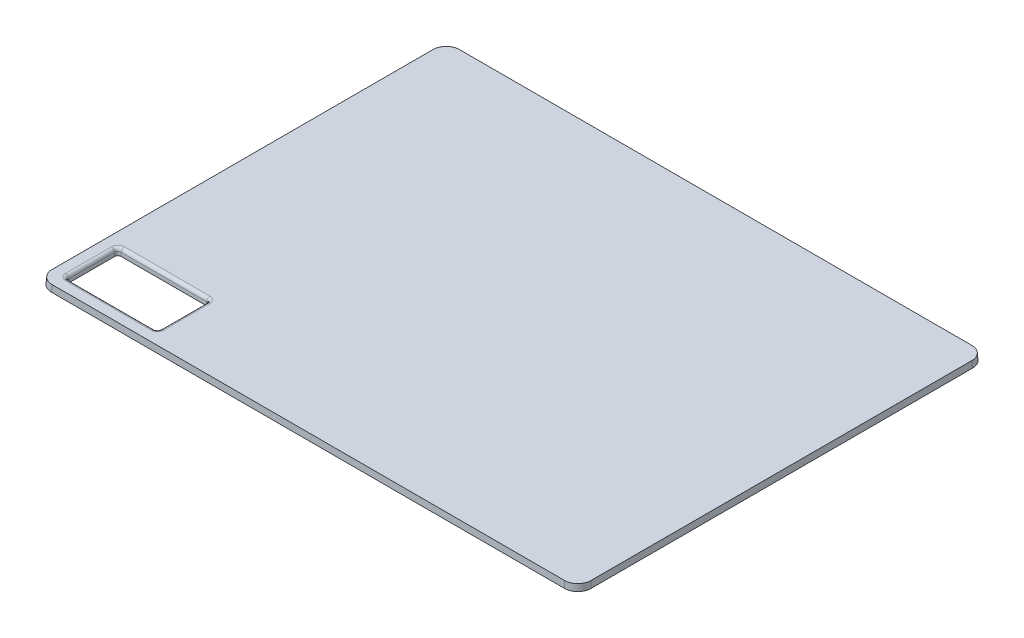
ISO-10303-21;
HEADER;
FILE_DESCRIPTION(('STEP AP214'),'2;1');
FILE_NAME('part.step','',(''),(''),'','','');
FILE_SCHEMA(('AUTOMOTIVE_DESIGN { 1 0 10303 214 1 1 1 1 }'));
ENDSEC;
DATA;
#1=APPLICATION_CONTEXT('core data for automotive mechanical design processes');
#2=APPLICATION_PROTOCOL_DEFINITION('international standard','automotive_design',2000,#1);
#3=PRODUCT_CONTEXT('',#1,'mechanical');
#4=PRODUCT('Part','Part','',(#3));
#5=PRODUCT_RELATED_PRODUCT_CATEGORY('part','',(#4));
#6=PRODUCT_DEFINITION_FORMATION('','',#4);
#7=PRODUCT_DEFINITION_CONTEXT('part definition',#1,'design');
#8=PRODUCT_DEFINITION('design','',#6,#7);
#9=PRODUCT_DEFINITION_SHAPE('','',#8);
#10=(LENGTH_UNIT() NAMED_UNIT(*) SI_UNIT(.MILLI.,.METRE.));
#11=(NAMED_UNIT(*) PLANE_ANGLE_UNIT() SI_UNIT($,.RADIAN.));
#12=(NAMED_UNIT(*) SI_UNIT($,.STERADIAN.) SOLID_ANGLE_UNIT());
#13=UNCERTAINTY_MEASURE_WITH_UNIT(LENGTH_MEASURE(1.E-05),#10,'distance_accuracy_value','');
#14=(GEOMETRIC_REPRESENTATION_CONTEXT(3) GLOBAL_UNCERTAINTY_ASSIGNED_CONTEXT((#13)) GLOBAL_UNIT_ASSIGNED_CONTEXT((#10,
#11,#12)) REPRESENTATION_CONTEXT('',''));
#15=CARTESIAN_POINT('',(0.,0.,0.));
#16=DIRECTION('',(0.,0.,1.));
#17=DIRECTION('',(1.,0.,0.));
#18=AXIS2_PLACEMENT_3D('',#15,#16,#17);
#19=CARTESIAN_POINT('',(0.,0.,0.));
#20=DIRECTION('',(-0.998629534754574,0.0523359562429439,0.));
#21=DIRECTION('',(-0.052335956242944,-0.998629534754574,0.));
#22=AXIS2_PLACEMENT_3D('',#19,#20,#21);
#23=PLANE('',#22);
#24=DIRECTION('',(0.,0.,-1.));
#25=VECTOR('',#24,1.);
#26=CARTESIAN_POINT('',(0.166394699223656,3.175,-196.85));
#27=LINE('',#26,#25);
#28=CARTESIAN_POINT('',(0.166394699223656,3.175,-190.342307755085));
#29=VERTEX_POINT('',#28);
#30=CARTESIAN_POINT('',(0.166394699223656,3.175,-6.50769224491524));
#31=VERTEX_POINT('',#30);
#32=EDGE_CURVE('E183',#29,#31,#27,.F.);
#33=ORIENTED_EDGE('',*,*,#32,.F.);
#34=DIRECTION('',(0.052264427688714,0.997264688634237,0.0522644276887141));
#35=VECTOR('',#34,1.);
#36=CARTESIAN_POINT('',(0.520387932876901,9.92959327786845,-189.988314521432));
#37=LINE('',#36,#35);
#38=CARTESIAN_POINT('',(0.,0.,-190.508702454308));
#39=VERTEX_POINT('',#38);
#40=EDGE_CURVE('E168',#29,#39,#37,.F.);
#41=ORIENTED_EDGE('',*,*,#40,.T.);
#42=DIRECTION('',(0.,0.,1.));
#43=VECTOR('',#42,1.);
#44=CARTESIAN_POINT('',(0.,0.,0.));
#45=LINE('',#44,#43);
#46=CARTESIAN_POINT('',(0.,0.,-6.34129754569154));
#47=VERTEX_POINT('',#46);
#48=EDGE_CURVE('E180',#39,#47,#45,.T.);
#49=ORIENTED_EDGE('',*,*,#48,.T.);
#50=DIRECTION('',(0.052264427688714,0.997264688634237,-0.0522644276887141));
#51=VECTOR('',#50,1.);
#52=CARTESIAN_POINT('',(-0.0173217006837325,-0.330517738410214,-6.32397584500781));
#53=LINE('',#52,#51);
#54=EDGE_CURVE('E185',#47,#31,#53,.T.);
#55=ORIENTED_EDGE('',*,*,#54,.T.);
#56=EDGE_LOOP('',(#33,#41,#49,#55));
#57=FACE_BOUND('',#56,.T.);
#58=ADVANCED_FACE('F28',(#57),#23,.T.);
#59=CARTESIAN_POINT('',(0.,0.,0.));
#60=DIRECTION('',(0.,0.0523359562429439,0.998629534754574));
#61=DIRECTION('',(0.,-0.998629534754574,0.052335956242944));
#62=AXIS2_PLACEMENT_3D('',#59,#60,#61);
#63=PLANE('',#62);
#64=DIRECTION('',(1.,0.,0.));
#65=VECTOR('',#64,1.);
#66=CARTESIAN_POINT('',(0.,0.,0.));
#67=LINE('',#66,#65);
#68=CARTESIAN_POINT('',(6.34129754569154,0.,0.));
#69=VERTEX_POINT('',#68);
#70=CARTESIAN_POINT('',(254.008702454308,0.,0.));
#71=VERTEX_POINT('',#70);
#72=EDGE_CURVE('E189',#69,#71,#67,.T.);
#73=ORIENTED_EDGE('',*,*,#72,.T.);
#74=DIRECTION('',(-0.0522644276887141,0.997264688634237,-0.052264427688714));
#75=VECTOR('',#74,1.);
#76=CARTESIAN_POINT('',(253.314859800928,13.2393065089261,-0.693842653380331));
#77=LINE('',#76,#75);
#78=CARTESIAN_POINT('',(253.842307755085,3.175,-0.166394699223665));
#79=VERTEX_POINT('',#78);
#80=EDGE_CURVE('E240',#71,#79,#77,.T.);
#81=ORIENTED_EDGE('',*,*,#80,.T.);
#82=DIRECTION('',(-1.,0.,0.));
#83=VECTOR('',#82,1.);
#84=CARTESIAN_POINT('',(0.,3.175,-0.166394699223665));
#85=LINE('',#84,#83);
#86=CARTESIAN_POINT('',(6.5076922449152,3.175,-0.166394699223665));
#87=VERTEX_POINT('',#86);
#88=EDGE_CURVE('E207',#87,#79,#85,.F.);
#89=ORIENTED_EDGE('',*,*,#88,.F.);
#90=DIRECTION('',(0.0522644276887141,0.997264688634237,-0.052264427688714));
#91=VECTOR('',#90,1.);
#92=CARTESIAN_POINT('',(6.32397584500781,-0.330517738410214,0.0173217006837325));
#93=LINE('',#92,#91);
#94=EDGE_CURVE('E237',#87,#69,#93,.F.);
#95=ORIENTED_EDGE('',*,*,#94,.T.);
#96=EDGE_LOOP('',(#73,#81,#89,#95));
#97=FACE_BOUND('',#96,.T.);
#98=ADVANCED_FACE('F30',(#97),#63,.T.);
#99=CARTESIAN_POINT('',(260.35,0.,0.));
#100=DIRECTION('',(0.998629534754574,0.0523359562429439,0.));
#101=DIRECTION('',(-0.052335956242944,0.998629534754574,0.));
#102=AXIS2_PLACEMENT_3D('',#99,#100,#101);
#103=PLANE('',#102);
#104=DIRECTION('',(0.,0.,-1.));
#105=VECTOR('',#104,1.);
#106=CARTESIAN_POINT('',(260.35,0.,0.));
#107=LINE('',#106,#105);
#108=CARTESIAN_POINT('',(260.35,0.,-6.34129754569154));
#109=VERTEX_POINT('',#108);
#110=CARTESIAN_POINT('',(260.35,0.,-190.508702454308));
#111=VERTEX_POINT('',#110);
#112=EDGE_CURVE('E193',#109,#111,#107,.T.);
#113=ORIENTED_EDGE('',*,*,#112,.T.);
#114=DIRECTION('',(-0.052264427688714,0.997264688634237,0.0522644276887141));
#115=VECTOR('',#114,1.);
#116=CARTESIAN_POINT('',(259.829612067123,9.92959327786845,-189.988314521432));
#117=LINE('',#116,#115);
#118=CARTESIAN_POINT('',(260.183605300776,3.175,-190.342307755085));
#119=VERTEX_POINT('',#118);
#120=EDGE_CURVE('E235',#111,#119,#117,.T.);
#121=ORIENTED_EDGE('',*,*,#120,.T.);
#122=DIRECTION('',(0.,0.,1.));
#123=VECTOR('',#122,1.);
#124=CARTESIAN_POINT('',(260.183605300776,3.175,-196.85));
#125=LINE('',#124,#123);
#126=CARTESIAN_POINT('',(260.183605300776,3.175,-6.50769224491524));
#127=VERTEX_POINT('',#126);
#128=EDGE_CURVE('E210',#127,#119,#125,.F.);
#129=ORIENTED_EDGE('',*,*,#128,.F.);
#130=DIRECTION('',(-0.052264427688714,0.997264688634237,-0.0522644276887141));
#131=VECTOR('',#130,1.);
#132=CARTESIAN_POINT('',(260.367321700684,-0.330517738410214,-6.32397584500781));
#133=LINE('',#132,#131);
#134=EDGE_CURVE('E232',#127,#109,#133,.F.);
#135=ORIENTED_EDGE('',*,*,#134,.T.);
#136=EDGE_LOOP('',(#113,#121,#129,#135));
#137=FACE_BOUND('',#136,.T.);
#138=ADVANCED_FACE('F389',(#137),#103,.T.);
#139=CARTESIAN_POINT('',(0.,0.,-196.85));
#140=DIRECTION('',(0.,0.0523359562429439,-0.998629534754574));
#141=DIRECTION('',(0.,0.998629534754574,0.052335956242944));
#142=AXIS2_PLACEMENT_3D('',#139,#140,#141);
#143=PLANE('',#142);
#144=DIRECTION('',(-1.,0.,0.));
#145=VECTOR('',#144,1.);
#146=CARTESIAN_POINT('',(0.,0.,-196.85));
#147=LINE('',#146,#145);
#148=CARTESIAN_POINT('',(254.008702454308,0.,-196.85));
#149=VERTEX_POINT('',#148);
#150=CARTESIAN_POINT('',(6.34129754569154,0.,-196.85));
#151=VERTEX_POINT('',#150);
#152=EDGE_CURVE('E204',#149,#151,#147,.T.);
#153=ORIENTED_EDGE('',*,*,#152,.T.);
#154=DIRECTION('',(0.0522644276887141,0.997264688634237,0.052264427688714));
#155=VECTOR('',#154,1.);
#156=CARTESIAN_POINT('',(6.32397584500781,-0.330517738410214,-196.867321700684));
#157=LINE('',#156,#155);
#158=CARTESIAN_POINT('',(6.5076922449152,3.175,-196.683605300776));
#159=VERTEX_POINT('',#158);
#160=EDGE_CURVE('E169',#151,#159,#157,.T.);
#161=ORIENTED_EDGE('',*,*,#160,.T.);
#162=DIRECTION('',(1.,0.,0.));
#163=VECTOR('',#162,1.);
#164=CARTESIAN_POINT('',(0.,3.175,-196.683605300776));
#165=LINE('',#164,#163);
#166=CARTESIAN_POINT('',(253.842307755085,3.175,-196.683605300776));
#167=VERTEX_POINT('',#166);
#168=EDGE_CURVE('E213',#167,#159,#165,.F.);
#169=ORIENTED_EDGE('',*,*,#168,.F.);
#170=DIRECTION('',(-0.0522644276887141,0.997264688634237,0.052264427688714));
#171=VECTOR('',#170,1.);
#172=CARTESIAN_POINT('',(253.314859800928,13.2393065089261,-196.15615734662));
#173=LINE('',#172,#171);
#174=EDGE_CURVE('E174',#167,#149,#173,.F.);
#175=ORIENTED_EDGE('',*,*,#174,.T.);
#176=EDGE_LOOP('',(#153,#161,#169,#175));
#177=FACE_BOUND('',#176,.T.);
#178=ADVANCED_FACE('F383',(#177),#143,.T.);
#179=CARTESIAN_POINT('',(0.,3.175,-196.85));
#180=DIRECTION('',(0.,-1.,0.));
#181=DIRECTION('',(0.,0.,-1.));
#182=AXIS2_PLACEMENT_3D('',#179,#180,#181);
#183=PLANE('',#182);
#184=DIRECTION('',(1.,0.,0.));
#185=VECTOR('',#184,1.);
#186=CARTESIAN_POINT('',(0.,3.175,-5.00991344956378));
#187=LINE('',#186,#185);
#188=CARTESIAN_POINT('',(49.3022271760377,3.175,-5.00991344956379));
#189=VERTEX_POINT('',#188);
#190=CARTESIAN_POINT('',(8.18056222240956,3.175,-5.00991344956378));
#191=VERTEX_POINT('',#190);
#192=EDGE_CURVE('E268',#189,#191,#187,.F.);
#193=ORIENTED_EDGE('',*,*,#192,.T.);
#194=CARTESIAN_POINT('',(8.18927064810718,3.175,-8.18927064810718));
#195=DIRECTION('',(0.,-1.,0.));
#196=DIRECTION('',(0.707106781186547,0.,-0.707106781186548));
#197=AXIS2_PLACEMENT_3D('',#194,#195,#196);
#198=ELLIPSE('',#197,3.18370843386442,3.175);
#199=CARTESIAN_POINT('',(5.00991344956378,3.175,-8.18056222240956));
#200=VERTEX_POINT('',#199);
#201=EDGE_CURVE('E282',#191,#200,#198,.T.);
#202=ORIENTED_EDGE('',*,*,#201,.T.);
#203=DIRECTION('',(0.,0.,1.));
#204=VECTOR('',#203,1.);
#205=CARTESIAN_POINT('',(5.00991344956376,3.175,-196.85));
#206=LINE('',#205,#204);
#207=CARTESIAN_POINT('',(5.00991344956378,3.175,-30.2522271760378));
#208=VERTEX_POINT('',#207);
#209=EDGE_CURVE('E280',#200,#208,#206,.F.);
#210=ORIENTED_EDGE('',*,*,#209,.T.);
#211=CARTESIAN_POINT('',(8.18927064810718,3.175,-30.2435187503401));
#212=DIRECTION('',(0.,-1.,0.));
#213=DIRECTION('',(0.707106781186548,0.,0.707106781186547));
#214=AXIS2_PLACEMENT_3D('',#211,#212,#213);
#215=ELLIPSE('',#214,3.18370843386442,3.175);
#216=CARTESIAN_POINT('',(8.18056222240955,3.175,-33.4228759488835));
#217=VERTEX_POINT('',#216);
#218=EDGE_CURVE('E278',#208,#217,#215,.T.);
#219=ORIENTED_EDGE('',*,*,#218,.T.);
#220=DIRECTION('',(-1.,0.,0.));
#221=VECTOR('',#220,1.);
#222=CARTESIAN_POINT('',(0.,3.175,-33.4228759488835));
#223=LINE('',#222,#221);
#224=CARTESIAN_POINT('',(49.3022271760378,3.175,-33.4228759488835));
#225=VERTEX_POINT('',#224);
#226=EDGE_CURVE('E276',#217,#225,#223,.F.);
#227=ORIENTED_EDGE('',*,*,#226,.T.);
#228=CARTESIAN_POINT('',(49.2935187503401,3.175,-30.2435187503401));
#229=DIRECTION('',(0.,-1.,0.));
#230=DIRECTION('',(-0.707106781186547,0.,0.707106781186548));
#231=AXIS2_PLACEMENT_3D('',#228,#229,#230);
#232=ELLIPSE('',#231,3.18370843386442,3.175);
#233=CARTESIAN_POINT('',(52.4728759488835,3.175,-30.2522271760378));
#234=VERTEX_POINT('',#233);
#235=EDGE_CURVE('E274',#225,#234,#232,.T.);
#236=ORIENTED_EDGE('',*,*,#235,.T.);
#237=DIRECTION('',(0.,0.,-1.));
#238=VECTOR('',#237,1.);
#239=CARTESIAN_POINT('',(52.4728759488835,3.175,-196.85));
#240=LINE('',#239,#238);
#241=CARTESIAN_POINT('',(52.4728759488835,3.175,-8.18056222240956));
#242=VERTEX_POINT('',#241);
#243=EDGE_CURVE('E272',#234,#242,#240,.F.);
#244=ORIENTED_EDGE('',*,*,#243,.T.);
#245=CARTESIAN_POINT('',(49.2935187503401,3.175,-8.18927064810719));
#246=DIRECTION('',(0.,-1.,0.));
#247=DIRECTION('',(-0.707106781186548,0.,-0.707106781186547));
#248=AXIS2_PLACEMENT_3D('',#245,#246,#247);
#249=ELLIPSE('',#248,3.18370843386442,3.175);
#250=EDGE_CURVE('E270',#242,#189,#249,.T.);
#251=ORIENTED_EDGE('',*,*,#250,.T.);
#252=EDGE_LOOP('',(#193,#202,#210,#219,#227,#236,#244,#251));
#253=FACE_BOUND('',#252,.T.);
#254=ORIENTED_EDGE('',*,*,#168,.T.);
#255=CARTESIAN_POINT('',(6.52510909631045,3.175,-190.32489090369));
#256=DIRECTION('',(0.,-1.,0.));
#257=DIRECTION('',(-0.707106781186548,0.,-0.707106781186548));
#258=AXIS2_PLACEMENT_3D('',#255,#256,#257);
#259=ELLIPSE('',#258,6.36741686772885,6.35);
#260=EDGE_CURVE('E230',#159,#29,#259,.F.);
#261=ORIENTED_EDGE('',*,*,#260,.T.);
#262=ORIENTED_EDGE('',*,*,#32,.T.);
#263=CARTESIAN_POINT('',(6.52510909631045,3.175,-6.52510909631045));
#264=DIRECTION('',(0.,-1.,0.));
#265=DIRECTION('',(-0.707106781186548,0.,0.707106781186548));
#266=AXIS2_PLACEMENT_3D('',#263,#264,#265);
#267=ELLIPSE('',#266,6.36741686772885,6.35);
#268=EDGE_CURVE('E224',#31,#87,#267,.F.);
#269=ORIENTED_EDGE('',*,*,#268,.T.);
#270=ORIENTED_EDGE('',*,*,#88,.T.);
#271=CARTESIAN_POINT('',(253.824890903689,3.175,-6.52510909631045));
#272=DIRECTION('',(0.,-1.,0.));
#273=DIRECTION('',(0.707106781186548,0.,0.707106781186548));
#274=AXIS2_PLACEMENT_3D('',#271,#272,#273);
#275=ELLIPSE('',#274,6.36741686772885,6.35);
#276=EDGE_CURVE('E226',#79,#127,#275,.F.);
#277=ORIENTED_EDGE('',*,*,#276,.T.);
#278=ORIENTED_EDGE('',*,*,#128,.T.);
#279=CARTESIAN_POINT('',(253.82489090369,3.175,-190.32489090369));
#280=DIRECTION('',(0.,-1.,0.));
#281=DIRECTION('',(0.707106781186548,0.,-0.707106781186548));
#282=AXIS2_PLACEMENT_3D('',#279,#280,#281);
#283=ELLIPSE('',#282,6.36741686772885,6.35);
#284=EDGE_CURVE('E228',#119,#167,#283,.F.);
#285=ORIENTED_EDGE('',*,*,#284,.T.);
#286=EDGE_LOOP('',(#254,#261,#262,#269,#270,#277,#278,#285));
#287=FACE_BOUND('',#286,.T.);
#288=ADVANCED_FACE('F342',(#253,#287),#183,.F.);
#289=CARTESIAN_POINT('',(0.,0.,-196.85));
#290=DIRECTION('',(0.,-1.,0.));
#291=DIRECTION('',(0.,0.,-1.));
#292=AXIS2_PLACEMENT_3D('',#289,#290,#291);
#293=PLANE('',#292);
#294=DIRECTION('',(-1.,0.,0.));
#295=VECTOR('',#294,1.);
#296=CARTESIAN_POINT('',(6.51639469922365,0.,-31.75));
#297=LINE('',#296,#295);
#298=CARTESIAN_POINT('',(49.2146756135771,0.,-31.75));
#299=VERTEX_POINT('',#298);
#300=CARTESIAN_POINT('',(8.2681137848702,0.,-31.75));
#301=VERTEX_POINT('',#300);
#302=EDGE_CURVE('E190',#299,#301,#297,.T.);
#303=ORIENTED_EDGE('',*,*,#302,.T.);
#304=CARTESIAN_POINT('',(8.27246799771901,0.,-30.1603214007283));
#305=DIRECTION('',(0.,-1.,0.));
#306=DIRECTION('',(0.707106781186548,0.,0.707106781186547));
#307=AXIS2_PLACEMENT_3D('',#304,#305,#306);
#308=ELLIPSE('',#307,1.59185421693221,1.5875);
#309=CARTESIAN_POINT('',(6.68278939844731,0.,-30.1646756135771));
#310=VERTEX_POINT('',#309);
#311=EDGE_CURVE('E266',#301,#310,#308,.F.);
#312=ORIENTED_EDGE('',*,*,#311,.T.);
#313=DIRECTION('',(0.,0.,1.));
#314=VECTOR('',#313,1.);
#315=CARTESIAN_POINT('',(6.68278939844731,0.,-6.51639469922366));
#316=LINE('',#315,#314);
#317=CARTESIAN_POINT('',(6.68278939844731,0.,-8.2681137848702));
#318=VERTEX_POINT('',#317);
#319=EDGE_CURVE('E323',#310,#318,#316,.T.);
#320=ORIENTED_EDGE('',*,*,#319,.T.);
#321=CARTESIAN_POINT('',(8.27246799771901,0.,-8.27246799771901));
#322=DIRECTION('',(0.,-1.,0.));
#323=DIRECTION('',(0.707106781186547,0.,-0.707106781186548));
#324=AXIS2_PLACEMENT_3D('',#321,#322,#323);
#325=ELLIPSE('',#324,1.59185421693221,1.5875);
#326=CARTESIAN_POINT('',(8.2681137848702,0.,-6.68278939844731));
#327=VERTEX_POINT('',#326);
#328=EDGE_CURVE('E264',#318,#327,#325,.F.);
#329=ORIENTED_EDGE('',*,*,#328,.T.);
#330=DIRECTION('',(1.,0.,0.));
#331=VECTOR('',#330,1.);
#332=CARTESIAN_POINT('',(6.51639469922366,0.,-6.68278939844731));
#333=LINE('',#332,#331);
#334=CARTESIAN_POINT('',(49.2146756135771,0.,-6.68278939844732));
#335=VERTEX_POINT('',#334);
#336=EDGE_CURVE('E199',#327,#335,#333,.T.);
#337=ORIENTED_EDGE('',*,*,#336,.T.);
#338=CARTESIAN_POINT('',(49.2103214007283,0.,-8.27246799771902));
#339=DIRECTION('',(0.,-1.,0.));
#340=DIRECTION('',(-0.707106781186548,0.,-0.707106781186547));
#341=AXIS2_PLACEMENT_3D('',#338,#339,#340);
#342=ELLIPSE('',#341,1.59185421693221,1.5875);
#343=CARTESIAN_POINT('',(50.8,0.,-8.26811378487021));
#344=VERTEX_POINT('',#343);
#345=EDGE_CURVE('E262',#335,#344,#342,.F.);
#346=ORIENTED_EDGE('',*,*,#345,.T.);
#347=DIRECTION('',(0.,0.,-1.));
#348=VECTOR('',#347,1.);
#349=CARTESIAN_POINT('',(50.8,0.,-6.51639469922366));
#350=LINE('',#349,#348);
#351=CARTESIAN_POINT('',(50.8,0.,-30.1646756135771));
#352=VERTEX_POINT('',#351);
#353=EDGE_CURVE('E196',#344,#352,#350,.T.);
#354=ORIENTED_EDGE('',*,*,#353,.T.);
#355=CARTESIAN_POINT('',(49.2103214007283,0.,-30.1603214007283));
#356=DIRECTION('',(0.,-1.,0.));
#357=DIRECTION('',(-0.707106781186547,0.,0.707106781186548));
#358=AXIS2_PLACEMENT_3D('',#355,#356,#357);
#359=ELLIPSE('',#358,1.59185421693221,1.5875);
#360=EDGE_CURVE('E260',#352,#299,#359,.F.);
#361=ORIENTED_EDGE('',*,*,#360,.T.);
#362=EDGE_LOOP('',(#303,#312,#320,#329,#337,#346,#354,#361));
#363=FACE_BOUND('',#362,.T.);
#364=ORIENTED_EDGE('',*,*,#48,.F.);
#365=CARTESIAN_POINT('',(6.3587143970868,0.,-190.491285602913));
#366=DIRECTION('',(0.,-1.,0.));
#367=DIRECTION('',(-0.707106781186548,0.,-0.707106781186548));
#368=AXIS2_PLACEMENT_3D('',#365,#366,#367);
#369=ELLIPSE('',#368,6.36741686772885,6.35);
#370=EDGE_CURVE('E164',#39,#151,#369,.T.);
#371=ORIENTED_EDGE('',*,*,#370,.T.);
#372=ORIENTED_EDGE('',*,*,#152,.F.);
#373=CARTESIAN_POINT('',(253.991285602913,0.,-190.491285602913));
#374=DIRECTION('',(0.,-1.,0.));
#375=DIRECTION('',(0.707106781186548,0.,-0.707106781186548));
#376=AXIS2_PLACEMENT_3D('',#373,#374,#375);
#377=ELLIPSE('',#376,6.36741686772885,6.35);
#378=EDGE_CURVE('E175',#149,#111,#377,.T.);
#379=ORIENTED_EDGE('',*,*,#378,.T.);
#380=ORIENTED_EDGE('',*,*,#112,.F.);
#381=CARTESIAN_POINT('',(253.991285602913,0.,-6.3587143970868));
#382=DIRECTION('',(0.,-1.,0.));
#383=DIRECTION('',(0.707106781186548,0.,0.707106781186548));
#384=AXIS2_PLACEMENT_3D('',#381,#382,#383);
#385=ELLIPSE('',#384,6.36741686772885,6.35);
#386=EDGE_CURVE('E218',#109,#71,#385,.T.);
#387=ORIENTED_EDGE('',*,*,#386,.T.);
#388=ORIENTED_EDGE('',*,*,#72,.F.);
#389=CARTESIAN_POINT('',(6.3587143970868,0.,-6.3587143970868));
#390=DIRECTION('',(0.,-1.,0.));
#391=DIRECTION('',(-0.707106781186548,0.,0.707106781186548));
#392=AXIS2_PLACEMENT_3D('',#389,#390,#391);
#393=ELLIPSE('',#392,6.36741686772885,6.35);
#394=EDGE_CURVE('E184',#69,#47,#393,.T.);
#395=ORIENTED_EDGE('',*,*,#394,.T.);
#396=EDGE_LOOP('',(#364,#371,#372,#379,#380,#387,#388,#395));
#397=FACE_BOUND('',#396,.T.);
#398=ADVANCED_FACE('F187',(#363,#397),#293,.T.);
#399=CARTESIAN_POINT('',(6.86168547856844,9.59725995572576,-189.988314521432));
#400=DIRECTION('',(-0.052264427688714,-0.997264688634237,-0.052264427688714));
#401=DIRECTION('',(0.,0.0523359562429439,-0.998629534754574));
#402=AXIS2_PLACEMENT_3D('',#399,#400,#401);
#403=CYLINDRICAL_SURFACE('',#402,6.35);
#404=ORIENTED_EDGE('',*,*,#260,.F.);
#405=ORIENTED_EDGE('',*,*,#160,.F.);
#406=ORIENTED_EDGE('',*,*,#370,.F.);
#407=ORIENTED_EDGE('',*,*,#40,.F.);
#408=EDGE_LOOP('',(#404,#405,#406,#407));
#409=FACE_BOUND('',#408,.T.);
#410=ADVANCED_FACE('F167',(#409),#403,.T.);
#411=CARTESIAN_POINT('',(253.314859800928,12.9069731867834,-189.814859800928));
#412=DIRECTION('',(0.052264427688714,-0.997264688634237,-0.052264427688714));
#413=DIRECTION('',(0.,0.0523359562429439,-0.998629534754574));
#414=AXIS2_PLACEMENT_3D('',#411,#412,#413);
#415=CYLINDRICAL_SURFACE('',#414,6.35);
#416=ORIENTED_EDGE('',*,*,#284,.F.);
#417=ORIENTED_EDGE('',*,*,#120,.F.);
#418=ORIENTED_EDGE('',*,*,#378,.F.);
#419=ORIENTED_EDGE('',*,*,#174,.F.);
#420=EDGE_LOOP('',(#416,#417,#418,#419));
#421=FACE_BOUND('',#420,.T.);
#422=ADVANCED_FACE('F372',(#421),#415,.T.);
#423=CARTESIAN_POINT('',(254.026024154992,-0.662851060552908,-6.32397584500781));
#424=DIRECTION('',(0.052264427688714,-0.997264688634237,0.052264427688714));
#425=DIRECTION('',(0.,-0.0523359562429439,-0.998629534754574));
#426=AXIS2_PLACEMENT_3D('',#423,#424,#425);
#427=CYLINDRICAL_SURFACE('',#426,6.35);
#428=ORIENTED_EDGE('',*,*,#276,.F.);
#429=ORIENTED_EDGE('',*,*,#80,.F.);
#430=ORIENTED_EDGE('',*,*,#386,.F.);
#431=ORIENTED_EDGE('',*,*,#134,.F.);
#432=EDGE_LOOP('',(#428,#429,#430,#431));
#433=FACE_BOUND('',#432,.T.);
#434=ADVANCED_FACE('F368',(#433),#427,.T.);
#435=CARTESIAN_POINT('',(6.32397584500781,-0.662851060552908,-6.32397584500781));
#436=DIRECTION('',(-0.052264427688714,-0.997264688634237,0.052264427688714));
#437=DIRECTION('',(0.,-0.0523359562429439,-0.998629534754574));
#438=AXIS2_PLACEMENT_3D('',#435,#436,#437);
#439=CYLINDRICAL_SURFACE('',#438,6.35);
#440=ORIENTED_EDGE('',*,*,#268,.F.);
#441=ORIENTED_EDGE('',*,*,#54,.F.);
#442=ORIENTED_EDGE('',*,*,#394,.F.);
#443=ORIENTED_EDGE('',*,*,#94,.F.);
#444=EDGE_LOOP('',(#440,#441,#442,#443));
#445=FACE_BOUND('',#444,.T.);
#446=ADVANCED_FACE('F357',(#445),#439,.T.);
#447=CARTESIAN_POINT('',(6.51639469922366,3.175,-6.51639469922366));
#448=DIRECTION('',(-0.998629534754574,-0.0523359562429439,0.));
#449=DIRECTION('',(0.052335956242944,-0.998629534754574,0.));
#450=AXIS2_PLACEMENT_3D('',#447,#448,#449);
#451=PLANE('',#450);
#452=DIRECTION('',(-0.0522644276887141,0.997264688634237,-0.052264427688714));
#453=VECTOR('',#452,1.);
#454=CARTESIAN_POINT('',(6.51206427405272,3.25762943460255,-30.3354007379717));
#455=LINE('',#454,#453);
#456=CARTESIAN_POINT('',(6.59523783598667,1.67058333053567,-30.2522271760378));
#457=VERTEX_POINT('',#456);
#458=EDGE_CURVE('E255',#310,#457,#455,.T.);
#459=ORIENTED_EDGE('',*,*,#458,.T.);
#460=DIRECTION('',(0.,0.,1.));
#461=VECTOR('',#460,1.);
#462=CARTESIAN_POINT('',(6.59523783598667,1.67058333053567,-6.51639469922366));
#463=LINE('',#462,#461);
#464=CARTESIAN_POINT('',(6.59523783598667,1.67058333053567,-8.18056222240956));
#465=VERTEX_POINT('',#464);
#466=EDGE_CURVE('E288',#457,#465,#463,.T.);
#467=ORIENTED_EDGE('',*,*,#466,.T.);
#468=DIRECTION('',(-0.052264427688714,0.997264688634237,0.0522644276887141));
#469=VECTOR('',#468,1.);
#470=CARTESIAN_POINT('',(6.67845897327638,0.0826294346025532,-8.26378335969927));
#471=LINE('',#470,#469);
#472=EDGE_CURVE('E258',#465,#318,#471,.F.);
#473=ORIENTED_EDGE('',*,*,#472,.T.);
#474=ORIENTED_EDGE('',*,*,#319,.F.);
#475=EDGE_LOOP('',(#459,#467,#473,#474));
#476=FACE_BOUND('',#475,.T.);
#477=ADVANCED_FACE('F353',(#476),#451,.F.);
#478=CARTESIAN_POINT('',(6.51639469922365,3.175,-31.9163946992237));
#479=DIRECTION('',(0.,-0.0523359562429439,-0.998629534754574));
#480=DIRECTION('',(0.,0.998629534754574,-0.052335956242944));
#481=AXIS2_PLACEMENT_3D('',#478,#479,#480);
#482=PLANE('',#481);
#483=DIRECTION('',(0.0522644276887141,0.997264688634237,-0.0522644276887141));
#484=VECTOR('',#483,1.);
#485=CARTESIAN_POINT('',(49.3854007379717,3.25762943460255,-31.9207251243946));
#486=LINE('',#485,#484);
#487=CARTESIAN_POINT('',(49.3022271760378,1.67058333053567,-31.8375515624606));
#488=VERTEX_POINT('',#487);
#489=EDGE_CURVE('E244',#299,#488,#486,.T.);
#490=ORIENTED_EDGE('',*,*,#489,.T.);
#491=DIRECTION('',(-1.,0.,0.));
#492=VECTOR('',#491,1.);
#493=CARTESIAN_POINT('',(6.51639469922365,1.67058333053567,-31.8375515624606));
#494=LINE('',#493,#492);
#495=CARTESIAN_POINT('',(8.18056222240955,1.67058333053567,-31.8375515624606));
#496=VERTEX_POINT('',#495);
#497=EDGE_CURVE('E292',#488,#496,#494,.T.);
#498=ORIENTED_EDGE('',*,*,#497,.T.);
#499=DIRECTION('',(-0.0522644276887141,0.997264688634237,-0.052264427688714));
#500=VECTOR('',#499,1.);
#501=CARTESIAN_POINT('',(8.26378335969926,0.0826294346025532,-31.7543304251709));
#502=LINE('',#501,#500);
#503=EDGE_CURVE('E242',#496,#301,#502,.F.);
#504=ORIENTED_EDGE('',*,*,#503,.T.);
#505=ORIENTED_EDGE('',*,*,#302,.F.);
#506=EDGE_LOOP('',(#490,#498,#504,#505));
#507=FACE_BOUND('',#506,.T.);
#508=ADVANCED_FACE('F356',(#507),#482,.F.);
#509=CARTESIAN_POINT('',(50.9663946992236,3.175,-6.51639469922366));
#510=DIRECTION('',(0.998629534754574,-0.0523359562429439,0.));
#511=DIRECTION('',(0.052335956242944,0.998629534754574,0.));
#512=AXIS2_PLACEMENT_3D('',#509,#510,#511);
#513=PLANE('',#512);
#514=DIRECTION('',(0.052264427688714,0.997264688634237,0.052264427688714));
#515=VECTOR('',#514,1.);
#516=CARTESIAN_POINT('',(50.9707251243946,3.25762943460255,-8.09738866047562));
#517=LINE('',#516,#515);
#518=CARTESIAN_POINT('',(50.8875515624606,1.67058333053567,-8.18056222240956));
#519=VERTEX_POINT('',#518);
#520=EDGE_CURVE('E247',#344,#519,#517,.T.);
#521=ORIENTED_EDGE('',*,*,#520,.T.);
#522=DIRECTION('',(0.,0.,-1.));
#523=VECTOR('',#522,1.);
#524=CARTESIAN_POINT('',(50.8875515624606,1.67058333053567,-6.51639469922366));
#525=LINE('',#524,#523);
#526=CARTESIAN_POINT('',(50.8875515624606,1.67058333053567,-30.2522271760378));
#527=VERTEX_POINT('',#526);
#528=EDGE_CURVE('E296',#519,#527,#525,.T.);
#529=ORIENTED_EDGE('',*,*,#528,.T.);
#530=DIRECTION('',(0.052264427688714,0.997264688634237,-0.0522644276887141));
#531=VECTOR('',#530,1.);
#532=CARTESIAN_POINT('',(50.8043304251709,0.0826294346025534,-30.169006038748));
#533=LINE('',#532,#531);
#534=EDGE_CURVE('E249',#527,#352,#533,.F.);
#535=ORIENTED_EDGE('',*,*,#534,.T.);
#536=ORIENTED_EDGE('',*,*,#353,.F.);
#537=EDGE_LOOP('',(#521,#529,#535,#536));
#538=FACE_BOUND('',#537,.T.);
#539=ADVANCED_FACE('F300',(#538),#513,.F.);
#540=CARTESIAN_POINT('',(6.51639469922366,3.175,-6.51639469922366));
#541=DIRECTION('',(0.,-0.0523359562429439,0.998629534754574));
#542=DIRECTION('',(0.,-0.998629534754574,-0.052335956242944));
#543=AXIS2_PLACEMENT_3D('',#540,#541,#542);
#544=PLANE('',#543);
#545=DIRECTION('',(-0.052264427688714,0.997264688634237,0.0522644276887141));
#546=VECTOR('',#545,1.);
#547=CARTESIAN_POINT('',(8.09738866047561,3.25762943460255,-6.51206427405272));
#548=LINE('',#547,#546);
#549=CARTESIAN_POINT('',(8.18056222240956,1.67058333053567,-6.59523783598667));
#550=VERTEX_POINT('',#549);
#551=EDGE_CURVE('E251',#327,#550,#548,.T.);
#552=ORIENTED_EDGE('',*,*,#551,.T.);
#553=DIRECTION('',(1.,0.,0.));
#554=VECTOR('',#553,1.);
#555=CARTESIAN_POINT('',(6.51639469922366,1.67058333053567,-6.59523783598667));
#556=LINE('',#555,#554);
#557=CARTESIAN_POINT('',(49.3022271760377,1.67058333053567,-6.59523783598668));
#558=VERTEX_POINT('',#557);
#559=EDGE_CURVE('E11',#550,#558,#556,.T.);
#560=ORIENTED_EDGE('',*,*,#559,.T.);
#561=DIRECTION('',(0.0522644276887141,0.997264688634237,0.052264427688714));
#562=VECTOR('',#561,1.);
#563=CARTESIAN_POINT('',(49.219006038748,0.0826294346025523,-6.67845897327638));
#564=LINE('',#563,#562);
#565=EDGE_CURVE('E253',#558,#335,#564,.F.);
#566=ORIENTED_EDGE('',*,*,#565,.T.);
#567=ORIENTED_EDGE('',*,*,#336,.F.);
#568=EDGE_LOOP('',(#552,#560,#566,#567));
#569=FACE_BOUND('',#568,.T.);
#570=ADVANCED_FACE('F351',(#569),#544,.F.);
#571=CARTESIAN_POINT('',(49.2639824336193,1.02391350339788,-30.2139824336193));
#572=DIRECTION('',(-0.052264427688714,-0.997264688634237,0.052264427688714));
#573=DIRECTION('',(0.,-0.052335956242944,-0.998629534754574));
#574=AXIS2_PLACEMENT_3D('',#571,#572,#573);
#575=CYLINDRICAL_SURFACE('',#574,1.5875);
#576=ORIENTED_EDGE('',*,*,#534,.F.);
#577=CARTESIAN_POINT('',(49.2935187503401,1.5875,-30.2435187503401));
#578=DIRECTION('',(-0.0516995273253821,0.997323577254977,0.0516995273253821));
#579=DIRECTION('',(-0.705214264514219,-0.0731141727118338,0.705214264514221));
#580=AXIS2_PLACEMENT_3D('',#577,#578,#579);
#581=ELLIPSE('',#580,1.60484598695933,1.5875);
#582=EDGE_CURVE('E294',#527,#488,#581,.T.);
#583=ORIENTED_EDGE('',*,*,#582,.T.);
#584=ORIENTED_EDGE('',*,*,#489,.F.);
#585=ORIENTED_EDGE('',*,*,#360,.F.);
#586=EDGE_LOOP('',(#576,#583,#584,#585));
#587=FACE_BOUND('',#586,.T.);
#588=ADVANCED_FACE('F310',(#587),#575,.F.);
#589=CARTESIAN_POINT('',(49.3854007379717,3.34071276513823,-8.09738866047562));
#590=DIRECTION('',(-0.052264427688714,-0.997264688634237,-0.052264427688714));
#591=DIRECTION('',(0.998629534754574,-0.0523359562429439,0.));
#592=AXIS2_PLACEMENT_3D('',#589,#590,#591);
#593=CYLINDRICAL_SURFACE('',#592,1.5875);
#594=ORIENTED_EDGE('',*,*,#565,.F.);
#595=CARTESIAN_POINT('',(49.2935187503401,1.5875,-8.18927064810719));
#596=DIRECTION('',(-0.0516995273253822,0.997323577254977,-0.0516995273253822));
#597=DIRECTION('',(-0.705214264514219,-0.0731141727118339,-0.705214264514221));
#598=AXIS2_PLACEMENT_3D('',#595,#596,#597);
#599=ELLIPSE('',#598,1.60484598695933,1.5875);
#600=EDGE_CURVE('E36',#558,#519,#599,.T.);
#601=ORIENTED_EDGE('',*,*,#600,.T.);
#602=ORIENTED_EDGE('',*,*,#520,.F.);
#603=ORIENTED_EDGE('',*,*,#345,.F.);
#604=EDGE_LOOP('',(#594,#601,#602,#603));
#605=FACE_BOUND('',#604,.T.);
#606=ADVANCED_FACE('F350',(#605),#593,.F.);
#607=CARTESIAN_POINT('',(8.09738866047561,3.34071276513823,-8.09738866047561));
#608=DIRECTION('',(0.052264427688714,-0.997264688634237,-0.052264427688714));
#609=DIRECTION('',(0.,0.052335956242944,-0.998629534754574));
#610=AXIS2_PLACEMENT_3D('',#607,#608,#609);
#611=CYLINDRICAL_SURFACE('',#610,1.5875);
#612=ORIENTED_EDGE('',*,*,#472,.F.);
#613=CARTESIAN_POINT('',(8.18927064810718,1.5875,-8.18927064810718));
#614=DIRECTION('',(0.051699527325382,0.997323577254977,-0.051699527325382));
#615=DIRECTION('',(0.70521426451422,-0.0731141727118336,-0.70521426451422));
#616=AXIS2_PLACEMENT_3D('',#613,#614,#615);
#617=ELLIPSE('',#616,1.60484598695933,1.5875);
#618=EDGE_CURVE('E285',#465,#550,#617,.T.);
#619=ORIENTED_EDGE('',*,*,#618,.T.);
#620=ORIENTED_EDGE('',*,*,#551,.F.);
#621=ORIENTED_EDGE('',*,*,#328,.F.);
#622=EDGE_LOOP('',(#612,#619,#620,#621));
#623=FACE_BOUND('',#622,.T.);
#624=ADVANCED_FACE('F461',(#623),#611,.F.);
#625=CARTESIAN_POINT('',(8.16677054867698,2.01682747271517,-30.2660188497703));
#626=DIRECTION('',(0.052264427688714,-0.997264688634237,0.052264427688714));
#627=DIRECTION('',(0.998629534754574,0.052335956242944,0.));
#628=AXIS2_PLACEMENT_3D('',#625,#626,#627);
#629=CYLINDRICAL_SURFACE('',#628,1.5875);
#630=ORIENTED_EDGE('',*,*,#503,.F.);
#631=CARTESIAN_POINT('',(8.18927064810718,1.5875,-30.2435187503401));
#632=DIRECTION('',(0.0516995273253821,0.997323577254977,0.0516995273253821));
#633=DIRECTION('',(0.705214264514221,-0.0731141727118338,0.705214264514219));
#634=AXIS2_PLACEMENT_3D('',#631,#632,#633);
#635=ELLIPSE('',#634,1.60484598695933,1.5875);
#636=EDGE_CURVE('E290',#496,#457,#635,.T.);
#637=ORIENTED_EDGE('',*,*,#636,.T.);
#638=ORIENTED_EDGE('',*,*,#458,.F.);
#639=ORIENTED_EDGE('',*,*,#311,.F.);
#640=EDGE_LOOP('',(#630,#637,#638,#639));
#641=FACE_BOUND('',#640,.T.);
#642=ADVANCED_FACE('F338',(#641),#629,.F.);
#643=CARTESIAN_POINT('',(48.161758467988,1.47016301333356,-29.111758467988));
#644=CARTESIAN_POINT('',(48.2511051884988,3.175,-29.2011051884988));
#645=CARTESIAN_POINT('',(47.0422969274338,3.175,-27.9922969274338));
#646=CARTESIAN_POINT('',(48.112778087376,1.47016301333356,-29.1607388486));
#647=CARTESIAN_POINT('',(48.2060338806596,3.175,-29.246176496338));
#648=CARTESIAN_POINT('',(46.9443361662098,3.175,-28.0902576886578));
#649=CARTESIAN_POINT('',(48.0670345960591,1.47049860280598,-29.2129561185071));
#650=CARTESIAN_POINT('',(48.1636744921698,3.175,-29.2939391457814));
#651=CARTESIAN_POINT('',(46.8528140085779,3.175,-28.1946570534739));
#652=CARTESIAN_POINT('',(47.982803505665,1.47183515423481,-29.3229703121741));
#653=CARTESIAN_POINT('',(48.0848831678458,3.175,-29.3943209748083));
#654=CARTESIAN_POINT('',(46.6842117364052,3.175,-28.4145453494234));
#655=CARTESIAN_POINT('',(47.9443165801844,1.47283617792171,-29.3807677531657));
#656=CARTESIAN_POINT('',(48.0484668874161,3.175,-29.446915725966));
#657=CARTESIAN_POINT('',(46.6071329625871,3.175,-28.5300353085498));
#658=CARTESIAN_POINT('',(47.8752564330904,1.47548640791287,-29.5009528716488));
#659=CARTESIAN_POINT('',(47.9820816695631,3.175,-29.5563514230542));
#660=CARTESIAN_POINT('',(46.4687348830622,3.175,-28.7701277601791));
#661=CARTESIAN_POINT('',(47.8446846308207,1.47713573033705,-29.5633413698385));
#662=CARTESIAN_POINT('',(47.9521226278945,3.175,-29.6131653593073));
#663=CARTESIAN_POINT('',(46.4074184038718,3.175,-28.8947318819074));
#664=CARTESIAN_POINT('',(47.7919770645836,1.48105428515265,-29.6916408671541));
#665=CARTESIAN_POINT('',(47.899145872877,3.175,-29.7303727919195));
#666=CARTESIAN_POINT('',(46.3015925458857,3.175,-29.1509201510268));
#667=CARTESIAN_POINT('',(47.7698434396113,1.48332367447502,-29.7575527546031));
#668=CARTESIAN_POINT('',(47.8761317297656,3.175,-29.7907381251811));
#669=CARTESIAN_POINT('',(46.2570874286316,3.175,-29.2825060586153));
#670=CARTESIAN_POINT('',(47.7343902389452,1.48844349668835,-29.8917712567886));
#671=CARTESIAN_POINT('',(47.8375048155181,3.175,-29.9143120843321));
#672=CARTESIAN_POINT('',(46.1856443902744,3.175,-29.5504064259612));
#673=CARTESIAN_POINT('',(47.7210733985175,1.49129410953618,-29.9600786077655));
#674=CARTESIAN_POINT('',(47.8218890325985,3.175,-29.9774929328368));
#675=CARTESIAN_POINT('',(46.1587119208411,3.175,-29.6867223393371));
#676=CARTESIAN_POINT('',(47.7034810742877,1.4975275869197,-30.0979194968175));
#677=CARTESIAN_POINT('',(47.7984702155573,3.175,-30.1058812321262));
#678=CARTESIAN_POINT('',(46.1228739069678,3.175,-29.9617507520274));
#679=CARTESIAN_POINT('',(47.699208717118,1.50091063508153,-30.1674534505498));
#680=CARTESIAN_POINT('',(47.7906576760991,3.175,-30.1710628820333));
#681=CARTESIAN_POINT('',(46.1139745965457,3.175,-30.1004640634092));
#682=CARTESIAN_POINT('',(47.699778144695,1.50815110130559,-30.3065581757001));
#683=CARTESIAN_POINT('',(47.7831878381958,3.175,-30.3025497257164));
#684=CARTESIAN_POINT('',(46.1143545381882,3.175,-30.3779146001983));
#685=CARTESIAN_POINT('',(47.7046231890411,1.51200868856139,-30.3761289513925));
#686=CARTESIAN_POINT('',(47.7835150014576,3.175,-30.3688326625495));
#687=CARTESIAN_POINT('',(46.1236402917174,3.175,-30.5166518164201));
#688=CARTESIAN_POINT('',(47.723344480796,1.520132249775,-30.514117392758));
#689=CARTESIAN_POINT('',(47.792574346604,3.175,-30.5015332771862));
#690=CARTESIAN_POINT('',(46.160231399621,3.175,-30.7917772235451));
#691=CARTESIAN_POINT('',(47.737223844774,1.52439836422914,-30.5825346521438));
#692=CARTESIAN_POINT('',(47.8012858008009,3.175,-30.5679336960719));
#693=CARTESIAN_POINT('',(46.1875429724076,3.175,-30.9281645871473));
#694=CARTESIAN_POINT('',(47.7737765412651,1.53326602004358,-30.7170458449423));
#695=CARTESIAN_POINT('',(47.8272456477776,3.175,-30.6998028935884));
#696=CARTESIAN_POINT('',(46.2597188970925,3.175,-31.1962575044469));
#697=CARTESIAN_POINT('',(47.7964525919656,1.53786766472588,-30.7831390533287));
#698=CARTESIAN_POINT('',(47.8444693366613,3.175,-30.7652606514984));
#699=CARTESIAN_POINT('',(46.3045886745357,3.175,-31.3279615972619));
#700=CARTESIAN_POINT('',(47.8502111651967,1.54732768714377,-30.9118715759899));
#701=CARTESIAN_POINT('',(47.8874436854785,3.175,-30.8941164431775));
#702=CARTESIAN_POINT('',(46.4111142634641,3.175,-31.5844350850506));
#703=CARTESIAN_POINT('',(47.881295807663,1.55218612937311,-30.9745100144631));
#704=CARTESIAN_POINT('',(47.9131672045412,3.175,-30.9575106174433));
#705=CARTESIAN_POINT('',(46.4727743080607,3.175,-31.7092027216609));
#706=CARTESIAN_POINT('',(47.9513403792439,1.56207665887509,-31.0952613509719));
#707=CARTESIAN_POINT('',(47.9729687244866,3.175,-31.0810724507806));
#708=CARTESIAN_POINT('',(46.6118267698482,3.175,-31.9496687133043));
#709=CARTESIAN_POINT('',(47.9903017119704,1.56710877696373,-31.1533734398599));
#710=CARTESIAN_POINT('',(48.007018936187,3.175,-31.1412439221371));
#711=CARTESIAN_POINT('',(46.6892219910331,3.175,-32.0653654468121));
#712=CARTESIAN_POINT('',(48.0754338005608,1.57726059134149,-31.2640776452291));
#713=CARTESIAN_POINT('',(48.0831235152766,3.175,-31.2571837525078));
#714=CARTESIAN_POINT('',(46.8584221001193,3.175,-32.2857097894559));
#715=CARTESIAN_POINT('',(48.1216052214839,1.58238029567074,-31.3166692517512));
#716=CARTESIAN_POINT('',(48.1251513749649,3.175,-31.3129636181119));
#717=CARTESIAN_POINT('',(46.9502283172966,3.175,-32.3903563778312));
#718=CARTESIAN_POINT('',(48.2203682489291,1.59261970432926,-31.4154322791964));
#719=CARTESIAN_POINT('',(48.2166745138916,3.175,-31.4189669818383));
#720=CARTESIAN_POINT('',(47.1466811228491,3.175,-32.5868091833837));
#721=CARTESIAN_POINT('',(48.2729598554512,1.59773940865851,-31.4616037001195));
#722=CARTESIAN_POINT('',(48.2661465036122,3.175,-31.469209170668));
#723=CARTESIAN_POINT('',(47.2513277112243,3.175,-32.6786154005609));
#724=CARTESIAN_POINT('',(48.3836640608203,1.60789122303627,-31.5467357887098));
#725=CARTESIAN_POINT('',(48.3718337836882,3.175,-31.5630427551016));
#726=CARTESIAN_POINT('',(47.4716720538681,3.175,-32.8478155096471));
#727=CARTESIAN_POINT('',(48.4417761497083,1.61292334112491,-31.5856971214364));
#728=CARTESIAN_POINT('',(48.4280307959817,3.175,-31.6066589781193));
#729=CARTESIAN_POINT('',(47.5873687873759,3.175,-32.925210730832));
#730=CARTESIAN_POINT('',(48.5625274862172,1.62281387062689,-31.6557416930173));
#731=CARTESIAN_POINT('',(48.5462635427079,3.175,-31.6862408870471));
#732=CARTESIAN_POINT('',(47.8278347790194,3.175,-33.0642631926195));
#733=CARTESIAN_POINT('',(48.6251659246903,1.62767231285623,-31.6868263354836));
#734=CARTESIAN_POINT('',(48.6082875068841,3.175,-31.7222359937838));
#735=CARTESIAN_POINT('',(47.9526024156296,3.175,-33.1259232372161));
#736=CARTESIAN_POINT('',(48.7538984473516,1.63713233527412,-31.7405849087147));
#737=CARTESIAN_POINT('',(48.7371037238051,3.175,-31.7857049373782));
#738=CARTESIAN_POINT('',(48.2090759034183,3.175,-33.2324488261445));
#739=CARTESIAN_POINT('',(48.819991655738,1.64173397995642,-31.7632609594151));
#740=CARTESIAN_POINT('',(48.803891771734,3.175,-31.8132108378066));
#741=CARTESIAN_POINT('',(48.3407799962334,3.175,-33.2773186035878));
#742=CARTESIAN_POINT('',(48.9545028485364,1.65060163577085,-31.7998136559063));
#743=CARTESIAN_POINT('',(48.9410215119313,3.175,-31.8589907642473));
#744=CARTESIAN_POINT('',(48.6088729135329,3.175,-33.3494945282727));
#745=CARTESIAN_POINT('',(49.0229201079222,1.654867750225,-31.8136930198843));
#746=CARTESIAN_POINT('',(49.0113670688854,3.175,-31.8772972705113));
#747=CARTESIAN_POINT('',(48.7452602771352,3.175,-33.3768061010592));
#748=CARTESIAN_POINT('',(49.1609085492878,1.66299131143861,-31.8324143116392));
#749=CARTESIAN_POINT('',(49.1542806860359,3.175,-31.9041544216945));
#750=CARTESIAN_POINT('',(49.0203856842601,3.175,-33.4133972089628));
#751=CARTESIAN_POINT('',(49.2304793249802,1.66684889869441,-31.8372593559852));
#752=CARTESIAN_POINT('',(49.2268605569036,3.175,-31.9127356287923));
#753=CARTESIAN_POINT('',(49.159122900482,3.175,-33.4226829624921));
#754=CARTESIAN_POINT('',(49.3695840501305,1.67408936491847,-31.8378287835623));
#755=CARTESIAN_POINT('',(49.3728277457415,3.175,-31.9198255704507));
#756=CARTESIAN_POINT('',(49.436573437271,3.175,-33.4230629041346));
#757=CARTESIAN_POINT('',(49.4391180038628,1.6774724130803,-31.8335564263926));
#758=CARTESIAN_POINT('',(49.4462340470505,3.175,-31.9183606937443));
#759=CARTESIAN_POINT('',(49.5752867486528,3.175,-33.4141635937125));
#760=CARTESIAN_POINT('',(49.5769588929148,1.68370589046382,-31.8159641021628));
#761=CARTESIAN_POINT('',(49.5923912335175,3.175,-31.9052634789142));
#762=CARTESIAN_POINT('',(49.8503151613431,3.175,-33.3783255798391));
#763=CARTESIAN_POINT('',(49.6452662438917,1.68655650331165,-31.8026472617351));
#764=CARTESIAN_POINT('',(49.6651668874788,3.175,-31.8936513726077));
#765=CARTESIAN_POINT('',(49.986631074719,3.175,-33.3513931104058));
#766=CARTESIAN_POINT('',(49.7794847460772,1.69167632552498,-31.767194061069));
#767=CARTESIAN_POINT('',(49.8085903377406,3.175,-31.860393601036));
#768=CARTESIAN_POINT('',(50.254531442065,3.175,-33.2799500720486));
#769=CARTESIAN_POINT('',(49.8453966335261,1.69394571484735,-31.7450604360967));
#770=CARTESIAN_POINT('',(49.8792667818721,3.175,-31.8387604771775));
#771=CARTESIAN_POINT('',(50.3861173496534,3.175,-33.2354449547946));
#772=CARTESIAN_POINT('',(49.9736961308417,1.69786426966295,-31.6923528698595));
#773=CARTESIAN_POINT('',(50.0170487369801,3.175,-31.7858235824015));
#774=CARTESIAN_POINT('',(50.6423056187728,3.175,-33.1296190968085));
#775=CARTESIAN_POINT('',(50.0360846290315,1.69951359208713,-31.6617810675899));
#776=CARTESIAN_POINT('',(50.0841844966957,3.175,-31.7545237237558));
#777=CARTESIAN_POINT('',(50.7669097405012,3.175,-33.0683026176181));
#778=CARTESIAN_POINT('',(50.1562697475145,1.70216382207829,-31.5927209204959));
#779=CARTESIAN_POINT('',(50.2135096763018,3.175,-31.6828383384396));
#780=CARTESIAN_POINT('',(51.0070021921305,3.175,-32.9299045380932));
#781=CARTESIAN_POINT('',(50.2140671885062,1.70316484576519,-31.5542339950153));
#782=CARTESIAN_POINT('',(50.2757284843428,3.175,-31.6424478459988));
#783=CARTESIAN_POINT('',(51.1224921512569,3.175,-32.8528257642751));
#784=CARTESIAN_POINT('',(50.3240813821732,1.70450139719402,-31.4700029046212));
#785=CARTESIAN_POINT('',(50.393948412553,3.175,-31.5533745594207));
#786=CARTESIAN_POINT('',(51.3423804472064,3.175,-32.6842234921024));
#787=CARTESIAN_POINT('',(50.3762986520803,1.70483698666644,-31.4242594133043));
#788=CARTESIAN_POINT('',(50.4499756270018,3.175,-31.5046783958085));
#789=CARTESIAN_POINT('',(51.4467798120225,3.175,-32.5927013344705));
#790=CARTESIAN_POINT('',(50.4742594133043,1.70483698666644,-31.3262986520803));
#791=CARTESIAN_POINT('',(50.5546783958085,3.175,-31.3999756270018));
#792=CARTESIAN_POINT('',(51.6427013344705,3.175,-32.3967798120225));
#793=CARTESIAN_POINT('',(50.5200029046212,1.70450139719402,-31.2740813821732));
#794=CARTESIAN_POINT('',(50.6033745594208,3.175,-31.343948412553));
#795=CARTESIAN_POINT('',(51.7342234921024,3.175,-32.2923804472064));
#796=CARTESIAN_POINT('',(50.6042339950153,1.70316484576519,-31.1640671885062));
#797=CARTESIAN_POINT('',(50.6924478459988,3.175,-31.2257284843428));
#798=CARTESIAN_POINT('',(51.9028257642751,3.175,-32.0724921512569));
#799=CARTESIAN_POINT('',(50.6427209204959,1.70216382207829,-31.1062697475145));
#800=CARTESIAN_POINT('',(50.7328383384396,3.175,-31.1635096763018));
#801=CARTESIAN_POINT('',(51.9799045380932,3.175,-31.9570021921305));
#802=CARTESIAN_POINT('',(50.7117810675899,1.69951359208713,-30.9860846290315));
#803=CARTESIAN_POINT('',(50.8045237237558,3.175,-31.0341844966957));
#804=CARTESIAN_POINT('',(52.1183026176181,3.175,-31.7169097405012));
#805=CARTESIAN_POINT('',(50.7423528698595,1.69786426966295,-30.9236961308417));
#806=CARTESIAN_POINT('',(50.8358235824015,3.175,-30.9670487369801));
#807=CARTESIAN_POINT('',(52.1796190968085,3.175,-31.5923056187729));
#808=CARTESIAN_POINT('',(50.7950604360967,1.69394571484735,-30.7953966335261));
#809=CARTESIAN_POINT('',(50.8887604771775,3.175,-30.829266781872));
#810=CARTESIAN_POINT('',(52.2854449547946,3.175,-31.3361173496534));
#811=CARTESIAN_POINT('',(50.817194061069,1.69167632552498,-30.7294847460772));
#812=CARTESIAN_POINT('',(50.910393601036,3.175,-30.7585903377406));
#813=CARTESIAN_POINT('',(52.3299500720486,3.175,-31.204531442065));
#814=CARTESIAN_POINT('',(50.8526472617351,1.68655650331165,-30.5952662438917));
#815=CARTESIAN_POINT('',(50.9436513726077,3.175,-30.6151668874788));
#816=CARTESIAN_POINT('',(52.4013931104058,3.175,-30.936631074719));
#817=CARTESIAN_POINT('',(50.8659641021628,1.68370589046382,-30.5269588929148));
#818=CARTESIAN_POINT('',(50.9552634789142,3.175,-30.5423912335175));
#819=CARTESIAN_POINT('',(52.4283255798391,3.175,-30.8003151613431));
#820=CARTESIAN_POINT('',(50.8835564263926,1.6774724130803,-30.3891180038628));
#821=CARTESIAN_POINT('',(50.9683606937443,3.175,-30.3962340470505));
#822=CARTESIAN_POINT('',(52.4641635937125,3.175,-30.5252867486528));
#823=CARTESIAN_POINT('',(50.8878287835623,1.67408936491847,-30.3195840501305));
#824=CARTESIAN_POINT('',(50.9698255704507,3.175,-30.3228277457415));
#825=CARTESIAN_POINT('',(52.4730629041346,3.175,-30.386573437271));
#826=CARTESIAN_POINT('',(50.8872593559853,1.66684889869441,-30.1804793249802));
#827=CARTESIAN_POINT('',(50.9627356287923,3.175,-30.1768605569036));
#828=CARTESIAN_POINT('',(52.4726829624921,3.175,-30.109122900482));
#829=CARTESIAN_POINT('',(50.8824143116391,1.66299131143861,-30.1109085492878));
#830=CARTESIAN_POINT('',(50.9541544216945,3.175,-30.1042806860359));
#831=CARTESIAN_POINT('',(52.4633972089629,3.175,-29.9703856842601));
#832=CARTESIAN_POINT('',(50.8636930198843,1.654867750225,-29.9729201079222));
#833=CARTESIAN_POINT('',(50.9272972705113,3.175,-29.9613670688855));
#834=CARTESIAN_POINT('',(52.4268061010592,3.175,-29.6952602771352));
#835=CARTESIAN_POINT('',(50.8498136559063,1.65060163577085,-29.9045028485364));
#836=CARTESIAN_POINT('',(50.9089907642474,3.175,-29.8910215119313));
#837=CARTESIAN_POINT('',(52.3994945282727,3.175,-29.5588729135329));
#838=CARTESIAN_POINT('',(50.8132609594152,1.64173397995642,-29.7699916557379));
#839=CARTESIAN_POINT('',(50.8632108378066,3.175,-29.753891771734));
#840=CARTESIAN_POINT('',(52.3273186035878,3.175,-29.2907799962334));
#841=CARTESIAN_POINT('',(50.7905849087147,1.63713233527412,-29.7038984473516));
#842=CARTESIAN_POINT('',(50.8357049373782,3.175,-29.6871037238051));
#843=CARTESIAN_POINT('',(52.2824488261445,3.175,-29.1590759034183));
#844=CARTESIAN_POINT('',(50.7368263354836,1.62767231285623,-29.5751659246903));
#845=CARTESIAN_POINT('',(50.7722359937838,3.175,-29.5582875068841));
#846=CARTESIAN_POINT('',(52.1759232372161,3.175,-28.9026024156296));
#847=CARTESIAN_POINT('',(50.7057416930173,1.62281387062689,-29.5125274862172));
#848=CARTESIAN_POINT('',(50.7362408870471,3.175,-29.4962635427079));
#849=CARTESIAN_POINT('',(52.1142631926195,3.175,-28.7778347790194));
#850=CARTESIAN_POINT('',(50.6356971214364,1.61292334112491,-29.3917761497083));
#851=CARTESIAN_POINT('',(50.6566589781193,3.175,-29.3780307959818));
#852=CARTESIAN_POINT('',(51.975210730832,3.175,-28.5373687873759));
#853=CARTESIAN_POINT('',(50.5967357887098,1.60789122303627,-29.3336640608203));
#854=CARTESIAN_POINT('',(50.6130427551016,3.175,-29.3218337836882));
#855=CARTESIAN_POINT('',(51.8978155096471,3.175,-28.4216720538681));
#856=CARTESIAN_POINT('',(50.5116037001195,1.59773940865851,-29.2229598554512));
#857=CARTESIAN_POINT('',(50.519209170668,3.175,-29.2161465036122));
#858=CARTESIAN_POINT('',(51.7286154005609,3.175,-28.2013277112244));
#859=CARTESIAN_POINT('',(50.4654322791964,1.59261970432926,-29.1703682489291));
#860=CARTESIAN_POINT('',(50.4689669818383,3.175,-29.1666745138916));
#861=CARTESIAN_POINT('',(51.6368091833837,3.175,-28.0966811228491));
#862=CARTESIAN_POINT('',(50.3666692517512,1.58238029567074,-29.0716052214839));
#863=CARTESIAN_POINT('',(50.3629636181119,3.175,-29.0751513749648));
#864=CARTESIAN_POINT('',(51.4403563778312,3.175,-27.9002283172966));
#865=CARTESIAN_POINT('',(50.3140776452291,1.57726059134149,-29.0254338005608));
#866=CARTESIAN_POINT('',(50.3071837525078,3.175,-29.0331235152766));
#867=CARTESIAN_POINT('',(51.3357097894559,3.175,-27.8084221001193));
#868=CARTESIAN_POINT('',(50.2033734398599,1.56710877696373,-28.9403017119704));
#869=CARTESIAN_POINT('',(50.1912439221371,3.175,-28.957018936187));
#870=CARTESIAN_POINT('',(51.1153654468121,3.175,-27.6392219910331));
#871=CARTESIAN_POINT('',(50.1452613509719,1.56207665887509,-28.9013403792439));
#872=CARTESIAN_POINT('',(50.1310724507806,3.175,-28.9229687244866));
#873=CARTESIAN_POINT('',(50.9996687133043,3.175,-27.5618267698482));
#874=CARTESIAN_POINT('',(50.0245100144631,1.55218612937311,-28.831295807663));
#875=CARTESIAN_POINT('',(50.0075106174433,3.175,-28.8631672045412));
#876=CARTESIAN_POINT('',(50.7592027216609,3.175,-27.4227743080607));
#877=CARTESIAN_POINT('',(49.9618715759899,1.54732768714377,-28.8002111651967));
#878=CARTESIAN_POINT('',(49.9441164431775,3.175,-28.8374436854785));
#879=CARTESIAN_POINT('',(50.6344350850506,3.175,-27.3611142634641));
#880=CARTESIAN_POINT('',(49.8331390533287,1.53786766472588,-28.7464525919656));
#881=CARTESIAN_POINT('',(49.8152606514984,3.175,-28.7944693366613));
#882=CARTESIAN_POINT('',(50.3779615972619,3.175,-27.2545886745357));
#883=CARTESIAN_POINT('',(49.7670458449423,1.53326602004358,-28.7237765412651));
#884=CARTESIAN_POINT('',(49.7498028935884,3.175,-28.7772456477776));
#885=CARTESIAN_POINT('',(50.2462575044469,3.175,-27.2097188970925));
#886=CARTESIAN_POINT('',(49.6325346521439,1.52439836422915,-28.687223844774));
#887=CARTESIAN_POINT('',(49.6179336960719,3.175,-28.751285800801));
#888=CARTESIAN_POINT('',(49.9781645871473,3.175,-27.1375429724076));
#889=CARTESIAN_POINT('',(49.564117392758,1.520132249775,-28.673344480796));
#890=CARTESIAN_POINT('',(49.5515332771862,3.175,-28.742574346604));
#891=CARTESIAN_POINT('',(49.8417772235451,3.175,-27.110231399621));
#892=CARTESIAN_POINT('',(49.4261289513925,1.51200868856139,-28.6546231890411));
#893=CARTESIAN_POINT('',(49.4188326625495,3.175,-28.7335150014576));
#894=CARTESIAN_POINT('',(49.5666518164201,3.175,-27.0736402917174));
#895=CARTESIAN_POINT('',(49.3565581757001,1.50815110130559,-28.649778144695));
#896=CARTESIAN_POINT('',(49.3525497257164,3.175,-28.7331878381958));
#897=CARTESIAN_POINT('',(49.4279146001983,3.175,-27.0643545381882));
#898=CARTESIAN_POINT('',(49.2174534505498,1.50091063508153,-28.649208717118));
#899=CARTESIAN_POINT('',(49.2210628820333,3.175,-28.7406576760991));
#900=CARTESIAN_POINT('',(49.1504640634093,3.175,-27.0639745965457));
#901=CARTESIAN_POINT('',(49.1479194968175,1.4975275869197,-28.6534810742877));
#902=CARTESIAN_POINT('',(49.1558812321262,3.175,-28.7484702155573));
#903=CARTESIAN_POINT('',(49.0117507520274,3.175,-27.0728739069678));
#904=CARTESIAN_POINT('',(49.0100786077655,1.49129410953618,-28.6710733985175));
#905=CARTESIAN_POINT('',(49.0274929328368,3.175,-28.7718890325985));
#906=CARTESIAN_POINT('',(48.7367223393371,3.175,-27.1087119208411));
#907=CARTESIAN_POINT('',(48.9417712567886,1.48844349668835,-28.6843902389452));
#908=CARTESIAN_POINT('',(48.9643120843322,3.175,-28.7875048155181));
#909=CARTESIAN_POINT('',(48.6004064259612,3.175,-27.1356443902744));
#910=CARTESIAN_POINT('',(48.8075527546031,1.48332367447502,-28.7198434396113));
#911=CARTESIAN_POINT('',(48.8407381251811,3.175,-28.8261317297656));
#912=CARTESIAN_POINT('',(48.3325060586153,3.175,-27.2070874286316));
#913=CARTESIAN_POINT('',(48.7416408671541,1.48105428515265,-28.7419770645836));
#914=CARTESIAN_POINT('',(48.7803727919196,3.175,-28.8491458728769));
#915=CARTESIAN_POINT('',(48.2009201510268,3.175,-27.2515925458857));
#916=CARTESIAN_POINT('',(48.6133413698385,1.47713573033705,-28.7946846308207));
#917=CARTESIAN_POINT('',(48.6631653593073,3.175,-28.9021226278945));
#918=CARTESIAN_POINT('',(47.9447318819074,3.175,-27.3574184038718));
#919=CARTESIAN_POINT('',(48.5509528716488,1.47548640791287,-28.8252564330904));
#920=CARTESIAN_POINT('',(48.6063514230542,3.175,-28.9320816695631));
#921=CARTESIAN_POINT('',(47.8201277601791,3.175,-27.4187348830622));
#922=CARTESIAN_POINT('',(48.4307677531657,1.47283617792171,-28.8943165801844));
#923=CARTESIAN_POINT('',(48.4969157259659,3.175,-28.9984668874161));
#924=CARTESIAN_POINT('',(47.5800353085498,3.175,-27.5571329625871));
#925=CARTESIAN_POINT('',(48.3729703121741,1.47183515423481,-28.932803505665));
#926=CARTESIAN_POINT('',(48.4443209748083,3.175,-29.0348831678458));
#927=CARTESIAN_POINT('',(47.4645453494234,3.175,-27.6342117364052));
#928=CARTESIAN_POINT('',(48.262956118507,1.47049860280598,-29.0170345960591));
#929=CARTESIAN_POINT('',(48.3439391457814,3.175,-29.1136744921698));
#930=CARTESIAN_POINT('',(47.2446570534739,3.175,-27.8028140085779));
#931=CARTESIAN_POINT('',(48.2107388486,1.47016301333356,-29.062778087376));
#932=CARTESIAN_POINT('',(48.296176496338,3.175,-29.1560338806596));
#933=CARTESIAN_POINT('',(47.1402576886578,3.175,-27.8943361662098));
#934=CARTESIAN_POINT('',(48.161758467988,1.47016301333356,-29.111758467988));
#935=CARTESIAN_POINT('',(48.2511051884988,3.175,-29.2011051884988));
#936=CARTESIAN_POINT('',(47.0422969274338,3.175,-27.9922969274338));
#937=(BOUNDED_SURFACE() B_SPLINE_SURFACE(3,2,((#643,#644,#645),(#646,#647,#648),(#649,#650,
#651),(#652,#653,#654),(#655,#656,#657),(#658,#659,#660),(#661,#662,#663),(#664,#665,#666),
(#667,#668,#669),(#670,#671,#672),(#673,#674,#675),(#676,#677,#678),(#679,#680,#681),(#682,#683,
#684),(#685,#686,#687),(#688,#689,#690),(#691,#692,#693),(#694,#695,#696),(#697,#698,#699),
(#700,#701,#702),(#703,#704,#705),(#706,#707,#708),(#709,#710,#711),(#712,#713,#714),(#715,#716,
#717),(#718,#719,#720),(#721,#722,#723),(#724,#725,#726),(#727,#728,#729),(#730,#731,#732),
(#733,#734,#735),(#736,#737,#738),(#739,#740,#741),(#742,#743,#744),(#745,#746,#747),(#748,#749,
#750),(#751,#752,#753),(#754,#755,#756),(#757,#758,#759),(#760,#761,#762),(#763,#764,#765),
(#766,#767,#768),(#769,#770,#771),(#772,#773,#774),(#775,#776,#777),(#778,#779,#780),(#781,#782,
#783),(#784,#785,#786),(#787,#788,#789),(#790,#791,#792),(#793,#794,#795),(#796,#797,#798),
(#799,#800,#801),(#802,#803,#804),(#805,#806,#807),(#808,#809,#810),(#811,#812,#813),(#814,#815,
#816),(#817,#818,#819),(#820,#821,#822),(#823,#824,#825),(#826,#827,#828),(#829,#830,#831),
(#832,#833,#834),(#835,#836,#837),(#838,#839,#840),(#841,#842,#843),(#844,#845,#846),(#847,#848,
#849),(#850,#851,#852),(#853,#854,#855),(#856,#857,#858),(#859,#860,#861),(#862,#863,#864),
(#865,#866,#867),(#868,#869,#870),(#871,#872,#873),(#874,#875,#876),(#877,#878,#879),(#880,#881,
#882),(#883,#884,#885),(#886,#887,#888),(#889,#890,#891),(#892,#893,#894),(#895,#896,#897),
(#898,#899,#900),(#901,#902,#903),(#904,#905,#906),(#907,#908,#909),(#910,#911,#912),(#913,#914,
#915),(#916,#917,#918),(#919,#920,#921),(#922,#923,#924),(#925,#926,#927),(#928,#929,#930),
(#931,#932,#933),(#934,#935,#936)),.UNSPECIFIED.,.T.,.F.,.F.) B_SPLINE_SURFACE_WITH_KNOTS((4,2,
2,2,2,2,2,2,2,2,2,2,2,2,2,2,2,2,2,2,2,2,2,2,2,2,2,2,2,2,2,2,2,2,2,2,2,2,2,2,2,2,2,2,2,2,2,2,4),
(3,3),(0.,0.415314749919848,0.83066803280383,1.24609574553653,1.66162869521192,2.07729049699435,
2.49309596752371,2.90905012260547,3.32514784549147,3.74137424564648,4.15770568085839,
4.57411137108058,4.99055549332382,5.40699961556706,5.82340530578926,6.23973674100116,
6.65596314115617,7.07206086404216,7.48801501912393,7.90382048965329,8.31948229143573,
8.73501524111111,9.15044295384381,9.5657962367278,9.98111098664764,10.3964257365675,
10.8117790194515,11.2272067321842,11.6427396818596,12.058401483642,12.4742069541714,
12.8901611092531,13.3062588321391,13.7224852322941,14.138816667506,14.5552223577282,
14.9716664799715,15.3881106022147,15.8045162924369,16.2208477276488,16.6370741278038,
17.0531718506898,17.4691260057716,17.8849314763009,18.3005932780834,18.7161262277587,
19.1315539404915,19.5469072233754,19.9622219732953),(0.,1.),
.UNSPECIFIED.) GEOMETRIC_REPRESENTATION_ITEM() RATIONAL_B_SPLINE_SURFACE(((1.,0.680472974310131,
1.),(1.,0.680472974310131,1.),(1.,0.680550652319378,1.),(1.,0.68085986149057,1.),(1.,
0.681091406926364,1.),(1.,0.681703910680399,1.),(1.,0.682084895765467,1.),(1.,0.682989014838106,
1.),(1.,0.68351218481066,1.),(1.,0.684690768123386,1.),(1.,0.685346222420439,1.),(1.,
0.686777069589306,1.),(1.,0.687552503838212,1.),(1.,0.689208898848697,1.),(1.,0.690089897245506,
1.),(1.,0.691941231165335,1.),(1.,0.692911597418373,1.),(1.,0.694924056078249,1.),(1.,
0.695966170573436,1.),(1.,0.698103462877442,1.),(1.,0.699198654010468,1.),(1.,0.701422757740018,
1.),(1.,0.702551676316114,1.),(1.,0.704823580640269,1.),(1.,0.705966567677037,1.),(1.,
0.708246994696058,1.),(1.,0.709384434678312,1.),(1.,0.711634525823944,1.),(1.,0.7127471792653,
1.),(1.,0.714929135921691,1.),(1.,0.715998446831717,1.),(1.,0.71807611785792,1.),(1.,
0.719084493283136,1.),(1.,0.721023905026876,1.),(1.,0.721954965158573,1.),(1.,0.723724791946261,
1.),(1.,0.724563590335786,1.),(1.,0.7261355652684,1.),(1.,0.726868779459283,1.),(1.,
0.728218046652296,1.),(1.,0.728834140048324,1.),(1.,0.729939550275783,1.),(1.,0.730428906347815,
1.),(1.,0.731273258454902,1.),(1.,0.731628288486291,1.),(1.,0.732198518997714,1.),(1.,
0.732413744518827,1.),(1.,0.732701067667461,1.),(1.,0.732773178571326,1.),(1.,0.732773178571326,
1.),(1.,0.732701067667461,1.),(1.,0.732413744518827,1.),(1.,0.732198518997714,1.),(1.,
0.731628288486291,1.),(1.,0.731273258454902,1.),(1.,0.730428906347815,1.),(1.,0.729939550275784,
1.),(1.,0.728834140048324,1.),(1.,0.728218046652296,1.),(1.,0.726868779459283,1.),(1.,
0.7261355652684,1.),(1.,0.724563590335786,1.),(1.,0.723724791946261,1.),(1.,0.721954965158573,
1.),(1.,0.721023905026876,1.),(1.,0.719084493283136,1.),(1.,0.71807611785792,1.),(1.,
0.715998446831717,1.),(1.,0.71492913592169,1.),(1.,0.7127471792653,1.),(1.,0.711634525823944,
1.),(1.,0.709384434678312,1.),(1.,0.708246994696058,1.),(1.,0.705966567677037,1.),(1.,
0.704823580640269,1.),(1.,0.702551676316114,1.),(1.,0.701422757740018,1.),(1.,0.699198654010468,
1.),(1.,0.698103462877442,1.),(1.,0.695966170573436,1.),(1.,0.694924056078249,1.),(1.,
0.692911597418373,1.),(1.,0.691941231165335,1.),(1.,0.690089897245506,1.),(1.,0.689208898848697,
1.),(1.,0.687552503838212,1.),(1.,0.686777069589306,1.),(1.,0.685346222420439,1.),(1.,
0.684690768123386,1.),(1.,0.68351218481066,1.),(1.,0.682989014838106,1.),(1.,0.682084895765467,
1.),(1.,0.681703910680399,1.),(1.,0.681091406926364,1.),(1.,0.68085986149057,1.),(1.,
0.680550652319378,1.),(1.,0.680472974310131,1.),(1.,0.680472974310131,1.))) REPRESENTATION_ITEM('') SURFACE());
#938=CARTESIAN_POINT('',(49.3022271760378,1.5875,-33.4228759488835));
#939=DIRECTION('',(-1.,0.,0.));
#940=DIRECTION('',(0.,0.,1.));
#941=AXIS2_PLACEMENT_3D('',#938,#939,#940);
#942=CIRCLE('',#941,1.5875);
#943=EDGE_CURVE('E320',#488,#225,#942,.T.);
#944=ORIENTED_EDGE('',*,*,#943,.F.);
#945=ORIENTED_EDGE('',*,*,#582,.F.);
#946=CARTESIAN_POINT('',(52.4728759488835,1.5875,-30.2522271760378));
#947=DIRECTION('',(0.,0.,1.));
#948=DIRECTION('',(1.,0.,0.));
#949=AXIS2_PLACEMENT_3D('',#946,#947,#948);
#950=CIRCLE('',#949,1.5875);
#951=EDGE_CURVE('E317',#234,#527,#950,.T.);
#952=ORIENTED_EDGE('',*,*,#951,.F.);
#953=ORIENTED_EDGE('',*,*,#235,.F.);
#954=EDGE_LOOP('',(#944,#945,#952,#953));
#955=FACE_BOUND('',#954,.T.);
#956=ADVANCED_FACE('F315',(#955),#937,.T.);
#957=CARTESIAN_POINT('',(52.4728759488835,1.5875,-6.51639469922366));
#958=DIRECTION('',(0.,0.,-1.));
#959=DIRECTION('',(-1.,0.,0.));
#960=AXIS2_PLACEMENT_3D('',#957,#958,#959);
#961=CYLINDRICAL_SURFACE('',#960,1.5875);
#962=ORIENTED_EDGE('',*,*,#951,.T.);
#963=ORIENTED_EDGE('',*,*,#528,.F.);
#964=CARTESIAN_POINT('',(52.4728759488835,1.5875,-8.18056222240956));
#965=DIRECTION('',(0.,0.,1.));
#966=DIRECTION('',(1.,0.,0.));
#967=AXIS2_PLACEMENT_3D('',#964,#965,#966);
#968=CIRCLE('',#967,1.5875);
#969=EDGE_CURVE('E327',#242,#519,#968,.T.);
#970=ORIENTED_EDGE('',*,*,#969,.F.);
#971=ORIENTED_EDGE('',*,*,#243,.F.);
#972=EDGE_LOOP('',(#962,#963,#970,#971));
#973=FACE_BOUND('',#972,.T.);
#974=ADVANCED_FACE('F322',(#973),#961,.T.);
#975=CARTESIAN_POINT('',(6.51639469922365,1.5875,-33.4228759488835));
#976=DIRECTION('',(-1.,0.,0.));
#977=DIRECTION('',(0.,0.,1.));
#978=AXIS2_PLACEMENT_3D('',#975,#976,#977);
#979=CYLINDRICAL_SURFACE('',#978,1.5875);
#980=ORIENTED_EDGE('',*,*,#943,.T.);
#981=ORIENTED_EDGE('',*,*,#226,.F.);
#982=CARTESIAN_POINT('',(8.18056222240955,1.5875,-33.4228759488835));
#983=DIRECTION('',(-1.,0.,0.));
#984=DIRECTION('',(0.,0.,1.));
#985=AXIS2_PLACEMENT_3D('',#982,#983,#984);
#986=CIRCLE('',#985,1.5875);
#987=EDGE_CURVE('E543',#496,#217,#986,.T.);
#988=ORIENTED_EDGE('',*,*,#987,.F.);
#989=ORIENTED_EDGE('',*,*,#497,.F.);
#990=EDGE_LOOP('',(#980,#981,#988,#989));
#991=FACE_BOUND('',#990,.T.);
#992=ADVANCED_FACE('F483',(#991),#979,.T.);
#993=CARTESIAN_POINT('',(48.161758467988,1.47016301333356,-9.32103093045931));
#994=CARTESIAN_POINT('',(48.2511051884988,3.175,-9.23168420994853));
#995=CARTESIAN_POINT('',(47.0422969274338,3.175,-10.4404924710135));
#996=CARTESIAN_POINT('',(48.2107388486,1.47016301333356,-9.37001131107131));
#997=CARTESIAN_POINT('',(48.296176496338,3.175,-9.27675551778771));
#998=CARTESIAN_POINT('',(47.1402576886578,3.175,-10.5384532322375));
#999=CARTESIAN_POINT('',(48.262956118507,1.47049860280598,-9.41575480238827));
#1000=CARTESIAN_POINT('',(48.3439391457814,3.175,-9.3191149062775));
#1001=CARTESIAN_POINT('',(47.2446570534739,3.175,-10.6299753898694));
#1002=CARTESIAN_POINT('',(48.3729703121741,1.47183515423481,-9.49998589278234));
#1003=CARTESIAN_POINT('',(48.4443209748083,3.175,-9.39790623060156));
#1004=CARTESIAN_POINT('',(47.4645453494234,3.175,-10.7985776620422));
#1005=CARTESIAN_POINT('',(48.4307677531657,1.47283617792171,-9.53847281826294));
#1006=CARTESIAN_POINT('',(48.4969157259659,3.175,-9.43432251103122));
#1007=CARTESIAN_POINT('',(47.5800353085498,3.175,-10.8756564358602));
#1008=CARTESIAN_POINT('',(48.5509528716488,1.47548640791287,-9.60753296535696));
#1009=CARTESIAN_POINT('',(48.6063514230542,3.175,-9.50070772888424));
#1010=CARTESIAN_POINT('',(47.8201277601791,3.175,-11.0140545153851));
#1011=CARTESIAN_POINT('',(48.6133413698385,1.47713573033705,-9.63810476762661));
#1012=CARTESIAN_POINT('',(48.6631653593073,3.175,-9.53066677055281));
#1013=CARTESIAN_POINT('',(47.9447318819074,3.175,-11.0753709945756));
#1014=CARTESIAN_POINT('',(48.7416408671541,1.48105428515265,-9.69081233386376));
#1015=CARTESIAN_POINT('',(48.7803727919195,3.175,-9.58364352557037));
#1016=CARTESIAN_POINT('',(48.2009201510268,3.175,-11.1811968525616));
#1017=CARTESIAN_POINT('',(48.8075527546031,1.48332367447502,-9.71294595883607));
#1018=CARTESIAN_POINT('',(48.8407381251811,3.175,-9.60665766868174));
#1019=CARTESIAN_POINT('',(48.3325060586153,3.175,-11.2257019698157));
#1020=CARTESIAN_POINT('',(48.9417712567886,1.48844349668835,-9.74839915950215));
#1021=CARTESIAN_POINT('',(48.9643120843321,3.175,-9.64528458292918));
#1022=CARTESIAN_POINT('',(48.6004064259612,3.175,-11.2971450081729));
#1023=CARTESIAN_POINT('',(49.0100786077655,1.49129410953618,-9.76171599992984));
#1024=CARTESIAN_POINT('',(49.0274929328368,3.175,-9.66090036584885));
#1025=CARTESIAN_POINT('',(48.7367223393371,3.175,-11.3240774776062));
#1026=CARTESIAN_POINT('',(49.1479194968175,1.4975275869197,-9.77930832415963));
#1027=CARTESIAN_POINT('',(49.1558812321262,3.175,-9.68431918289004));
#1028=CARTESIAN_POINT('',(49.0117507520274,3.175,-11.3599154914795));
#1029=CARTESIAN_POINT('',(49.2174534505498,1.50091063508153,-9.78358068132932));
#1030=CARTESIAN_POINT('',(49.2210628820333,3.175,-9.69213172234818));
#1031=CARTESIAN_POINT('',(49.1504640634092,3.175,-11.3688148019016));
#1032=CARTESIAN_POINT('',(49.3565581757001,1.50815110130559,-9.78301125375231));
#1033=CARTESIAN_POINT('',(49.3525497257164,3.175,-9.69960156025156));
#1034=CARTESIAN_POINT('',(49.4279146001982,3.175,-11.3684348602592));
#1035=CARTESIAN_POINT('',(49.4261289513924,1.51200868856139,-9.77816620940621));
#1036=CARTESIAN_POINT('',(49.4188326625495,3.175,-9.69927439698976));
#1037=CARTESIAN_POINT('',(49.5666518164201,3.175,-11.3591491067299));
#1038=CARTESIAN_POINT('',(49.564117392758,1.520132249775,-9.75944491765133));
#1039=CARTESIAN_POINT('',(49.5515332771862,3.175,-9.69021505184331));
#1040=CARTESIAN_POINT('',(49.8417772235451,3.175,-11.3225579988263));
#1041=CARTESIAN_POINT('',(49.6325346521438,1.52439836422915,-9.74556555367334));
#1042=CARTESIAN_POINT('',(49.6179336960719,3.175,-9.68150359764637));
#1043=CARTESIAN_POINT('',(49.9781645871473,3.175,-11.2952464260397));
#1044=CARTESIAN_POINT('',(49.7670458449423,1.53326602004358,-9.7090128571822));
#1045=CARTESIAN_POINT('',(49.7498028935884,3.175,-9.65554375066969));
#1046=CARTESIAN_POINT('',(50.2462575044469,3.175,-11.2230705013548));
#1047=CARTESIAN_POINT('',(49.8331390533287,1.53786766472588,-9.68633680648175));
#1048=CARTESIAN_POINT('',(49.8152606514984,3.175,-9.63832006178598));
#1049=CARTESIAN_POINT('',(50.3779615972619,3.175,-11.1782007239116));
#1050=CARTESIAN_POINT('',(49.9618715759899,1.54732768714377,-9.63257823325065));
#1051=CARTESIAN_POINT('',(49.9441164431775,3.175,-9.59534571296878));
#1052=CARTESIAN_POINT('',(50.6344350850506,3.175,-11.0716751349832));
#1053=CARTESIAN_POINT('',(50.024510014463,1.55218612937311,-9.60149359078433));
#1054=CARTESIAN_POINT('',(50.0075106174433,3.175,-9.56962219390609));
#1055=CARTESIAN_POINT('',(50.7592027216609,3.175,-11.0100150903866));
#1056=CARTESIAN_POINT('',(50.1452613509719,1.56207665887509,-9.53144901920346));
#1057=CARTESIAN_POINT('',(50.1310724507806,3.175,-9.50982067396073));
#1058=CARTESIAN_POINT('',(50.9996687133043,3.175,-10.8709626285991));
#1059=CARTESIAN_POINT('',(50.2033734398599,1.56710877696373,-9.49248768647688));
#1060=CARTESIAN_POINT('',(50.191243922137,3.175,-9.47577046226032));
#1061=CARTESIAN_POINT('',(51.1153654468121,3.175,-10.7935674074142));
#1062=CARTESIAN_POINT('',(50.314077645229,1.57726059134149,-9.40735559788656));
#1063=CARTESIAN_POINT('',(50.3071837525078,3.175,-9.3996658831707));
#1064=CARTESIAN_POINT('',(51.3357097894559,3.175,-10.624367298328));
#1065=CARTESIAN_POINT('',(50.3666692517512,1.58238029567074,-9.36118417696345));
#1066=CARTESIAN_POINT('',(50.3629636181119,3.175,-9.35763802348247));
#1067=CARTESIAN_POINT('',(51.4403563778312,3.175,-10.5325610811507));
#1068=CARTESIAN_POINT('',(50.4654322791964,1.59261970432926,-9.26242114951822));
#1069=CARTESIAN_POINT('',(50.4689669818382,3.175,-9.26611488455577));
#1070=CARTESIAN_POINT('',(51.6368091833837,3.175,-10.3361082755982));
#1071=CARTESIAN_POINT('',(50.5116037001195,1.59773940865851,-9.20982954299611));
#1072=CARTESIAN_POINT('',(50.519209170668,3.175,-9.21664289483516));
#1073=CARTESIAN_POINT('',(51.7286154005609,3.175,-10.231461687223));
#1074=CARTESIAN_POINT('',(50.5967357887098,1.60789122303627,-9.099125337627));
#1075=CARTESIAN_POINT('',(50.6130427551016,3.175,-9.11095561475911));
#1076=CARTESIAN_POINT('',(51.8978155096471,3.175,-10.0111173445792));
#1077=CARTESIAN_POINT('',(50.6356971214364,1.61292334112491,-9.04101324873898));
#1078=CARTESIAN_POINT('',(50.6566589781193,3.175,-9.05475860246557));
#1079=CARTESIAN_POINT('',(51.975210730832,3.175,-9.89542061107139));
#1080=CARTESIAN_POINT('',(50.7057416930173,1.62281387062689,-8.92026191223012));
#1081=CARTESIAN_POINT('',(50.736240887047,3.175,-8.93652585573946));
#1082=CARTESIAN_POINT('',(52.1142631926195,3.175,-9.65495461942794));
#1083=CARTESIAN_POINT('',(50.7368263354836,1.62767231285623,-8.85762347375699));
#1084=CARTESIAN_POINT('',(50.7722359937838,3.175,-8.87450189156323));
#1085=CARTESIAN_POINT('',(52.1759232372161,3.175,-9.5301869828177));
#1086=CARTESIAN_POINT('',(50.7905849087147,1.63713233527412,-8.72889095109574));
#1087=CARTESIAN_POINT('',(50.8357049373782,3.175,-8.74568567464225));
#1088=CARTESIAN_POINT('',(52.2824488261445,3.175,-9.27371349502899));
#1089=CARTESIAN_POINT('',(50.8132609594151,1.64173397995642,-8.66279774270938));
#1090=CARTESIAN_POINT('',(50.8632108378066,3.175,-8.6788976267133));
#1091=CARTESIAN_POINT('',(52.3273186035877,3.175,-9.14200940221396));
#1092=CARTESIAN_POINT('',(50.8498136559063,1.65060163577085,-8.52828654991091));
#1093=CARTESIAN_POINT('',(50.9089907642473,3.175,-8.54176788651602));
#1094=CARTESIAN_POINT('',(52.3994945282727,3.175,-8.87391648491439));
#1095=CARTESIAN_POINT('',(50.8636930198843,1.654867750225,-8.45986929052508));
#1096=CARTESIAN_POINT('',(50.9272972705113,3.175,-8.47142232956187));
#1097=CARTESIAN_POINT('',(52.4268061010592,3.175,-8.73752912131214));
#1098=CARTESIAN_POINT('',(50.8824143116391,1.66299131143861,-8.32188084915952));
#1099=CARTESIAN_POINT('',(50.9541544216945,3.175,-8.3285087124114));
#1100=CARTESIAN_POINT('',(52.4633972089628,3.175,-8.46240371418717));
#1101=CARTESIAN_POINT('',(50.8872593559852,1.66684889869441,-8.25231007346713));
#1102=CARTESIAN_POINT('',(50.9627356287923,3.175,-8.25592884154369));
#1103=CARTESIAN_POINT('',(52.4726829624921,3.175,-8.32366649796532));
#1104=CARTESIAN_POINT('',(50.8878287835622,1.67408936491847,-8.11320534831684));
#1105=CARTESIAN_POINT('',(50.9698255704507,3.175,-8.1099616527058));
#1106=CARTESIAN_POINT('',(52.4730629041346,3.175,-8.04621596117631));
#1107=CARTESIAN_POINT('',(50.8835564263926,1.6774724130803,-8.04367139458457));
#1108=CARTESIAN_POINT('',(50.9683606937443,3.175,-8.03655535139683));
#1109=CARTESIAN_POINT('',(52.4641635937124,3.175,-7.90750264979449));
#1110=CARTESIAN_POINT('',(50.8659641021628,1.68370589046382,-7.90583050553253));
#1111=CARTESIAN_POINT('',(50.9552634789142,3.175,-7.89039816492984));
#1112=CARTESIAN_POINT('',(52.4283255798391,3.175,-7.63247423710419));
#1113=CARTESIAN_POINT('',(50.8526472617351,1.68655650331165,-7.83752315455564));
#1114=CARTESIAN_POINT('',(50.9436513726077,3.175,-7.81762251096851));
#1115=CARTESIAN_POINT('',(52.4013931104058,3.175,-7.4961583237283));
#1116=CARTESIAN_POINT('',(50.817194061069,1.69167632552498,-7.70330465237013));
#1117=CARTESIAN_POINT('',(50.910393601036,3.175,-7.67419906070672));
#1118=CARTESIAN_POINT('',(52.3299500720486,3.175,-7.22825795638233));
#1119=CARTESIAN_POINT('',(50.7950604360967,1.69394571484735,-7.6373927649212));
#1120=CARTESIAN_POINT('',(50.8887604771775,3.175,-7.60352261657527));
#1121=CARTESIAN_POINT('',(52.2854449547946,3.175,-7.0966720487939));
#1122=CARTESIAN_POINT('',(50.7423528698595,1.69786426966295,-7.5090932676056));
#1123=CARTESIAN_POINT('',(50.8358235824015,3.175,-7.46574066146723));
#1124=CARTESIAN_POINT('',(52.1796190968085,3.175,-6.84048377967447));
#1125=CARTESIAN_POINT('',(50.7117810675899,1.69951359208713,-7.44670476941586));
#1126=CARTESIAN_POINT('',(50.8045237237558,3.175,-7.39860490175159));
#1127=CARTESIAN_POINT('',(52.1183026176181,3.175,-6.71587965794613));
#1128=CARTESIAN_POINT('',(50.6427209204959,1.70216382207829,-7.32651965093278));
#1129=CARTESIAN_POINT('',(50.7328383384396,3.175,-7.26927972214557));
#1130=CARTESIAN_POINT('',(51.9799045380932,3.175,-6.47578720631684));
#1131=CARTESIAN_POINT('',(50.6042339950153,1.70316484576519,-7.26872220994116));
#1132=CARTESIAN_POINT('',(50.6924478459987,3.175,-7.2070609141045));
#1133=CARTESIAN_POINT('',(51.9028257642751,3.175,-6.36029724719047));
#1134=CARTESIAN_POINT('',(50.5200029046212,1.70450139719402,-7.15870801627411));
#1135=CARTESIAN_POINT('',(50.6033745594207,3.175,-7.0888409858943));
#1136=CARTESIAN_POINT('',(51.7342234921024,3.175,-6.14040895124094));
#1137=CARTESIAN_POINT('',(50.4742594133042,1.70483698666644,-7.10649074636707));
#1138=CARTESIAN_POINT('',(50.5546783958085,3.175,-7.03281377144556));
#1139=CARTESIAN_POINT('',(51.6427013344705,3.175,-6.03600958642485));
#1140=CARTESIAN_POINT('',(50.3762986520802,1.70483698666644,-7.00852998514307));
#1141=CARTESIAN_POINT('',(50.4499756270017,3.175,-6.92811100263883));
#1142=CARTESIAN_POINT('',(51.4467798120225,3.175,-5.84008806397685));
#1143=CARTESIAN_POINT('',(50.3240813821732,1.70450139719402,-6.96278649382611));
#1144=CARTESIAN_POINT('',(50.393948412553,3.175,-6.87941483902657));
#1145=CARTESIAN_POINT('',(51.3423804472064,3.175,-5.74856590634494));
#1146=CARTESIAN_POINT('',(50.2140671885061,1.70316484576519,-6.87855540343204));
#1147=CARTESIAN_POINT('',(50.2757284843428,3.175,-6.79034155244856));
#1148=CARTESIAN_POINT('',(51.1224921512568,3.175,-5.57996363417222));
#1149=CARTESIAN_POINT('',(50.1562697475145,1.70216382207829,-6.84006847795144));
#1150=CARTESIAN_POINT('',(50.2135096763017,3.175,-6.74995106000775));
#1151=CARTESIAN_POINT('',(51.0070021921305,3.175,-5.50288486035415));
#1152=CARTESIAN_POINT('',(50.0360846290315,1.69951359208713,-6.77100833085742));
#1153=CARTESIAN_POINT('',(50.0841844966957,3.175,-6.67826567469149));
#1154=CARTESIAN_POINT('',(50.7669097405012,3.175,-5.36448678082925));
#1155=CARTESIAN_POINT('',(49.9736961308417,1.69786426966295,-6.74043652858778));
#1156=CARTESIAN_POINT('',(50.0170487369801,3.175,-6.64696581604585));
#1157=CARTESIAN_POINT('',(50.6423056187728,3.175,-5.30317030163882));
#1158=CARTESIAN_POINT('',(49.8453966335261,1.69394571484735,-6.68772896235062));
#1159=CARTESIAN_POINT('',(49.879266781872,3.175,-6.59402892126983));
#1160=CARTESIAN_POINT('',(50.3861173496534,3.175,-5.19734444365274));
#1161=CARTESIAN_POINT('',(49.7794847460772,1.69167632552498,-6.66559533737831));
#1162=CARTESIAN_POINT('',(49.8085903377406,3.175,-6.57239579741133));
#1163=CARTESIAN_POINT('',(50.254531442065,3.175,-5.1528393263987));
#1164=CARTESIAN_POINT('',(49.6452662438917,1.68655650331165,-6.63014213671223));
#1165=CARTESIAN_POINT('',(49.6651668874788,3.175,-6.53913802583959));
#1166=CARTESIAN_POINT('',(49.986631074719,3.175,-5.08139628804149));
#1167=CARTESIAN_POINT('',(49.5769588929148,1.68370589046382,-6.61682529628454));
#1168=CARTESIAN_POINT('',(49.5923912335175,3.175,-6.52752591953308));
#1169=CARTESIAN_POINT('',(49.8503151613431,3.175,-5.0544638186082));
#1170=CARTESIAN_POINT('',(49.4391180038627,1.6774724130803,-6.59923297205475));
#1171=CARTESIAN_POINT('',(49.4462340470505,3.175,-6.514428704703));
#1172=CARTESIAN_POINT('',(49.5752867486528,3.175,-5.01862580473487));
#1173=CARTESIAN_POINT('',(49.3695840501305,1.67408936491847,-6.59496061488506));
#1174=CARTESIAN_POINT('',(49.3728277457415,3.175,-6.5129638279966));
#1175=CARTESIAN_POINT('',(49.436573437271,3.175,-5.00972649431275));
#1176=CARTESIAN_POINT('',(49.2304793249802,1.66684889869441,-6.59553004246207));
#1177=CARTESIAN_POINT('',(49.2268605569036,3.175,-6.52005376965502));
#1178=CARTESIAN_POINT('',(49.159122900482,3.175,-5.01010643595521));
#1179=CARTESIAN_POINT('',(49.1609085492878,1.66299131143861,-6.60037508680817));
#1180=CARTESIAN_POINT('',(49.1542806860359,3.175,-6.52863497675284));
#1181=CARTESIAN_POINT('',(49.0203856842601,3.175,-5.01939218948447));
#1182=CARTESIAN_POINT('',(49.0229201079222,1.654867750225,-6.61909637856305));
#1183=CARTESIAN_POINT('',(49.0113670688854,3.175,-6.55549212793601));
#1184=CARTESIAN_POINT('',(48.7452602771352,3.175,-5.05598329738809));
#1185=CARTESIAN_POINT('',(48.9545028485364,1.65060163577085,-6.63297574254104));
#1186=CARTESIAN_POINT('',(48.9410215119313,3.175,-6.57379863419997));
#1187=CARTESIAN_POINT('',(48.6088729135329,3.175,-5.08329487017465));
#1188=CARTESIAN_POINT('',(48.8199916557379,1.64173397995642,-6.66952843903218));
#1189=CARTESIAN_POINT('',(48.803891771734,3.175,-6.61957856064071));
#1190=CARTESIAN_POINT('',(48.3407799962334,3.175,-5.15547079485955));
#1191=CARTESIAN_POINT('',(48.7538984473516,1.63713233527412,-6.69220448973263));
#1192=CARTESIAN_POINT('',(48.737103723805,3.175,-6.64708446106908));
#1193=CARTESIAN_POINT('',(48.2090759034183,3.175,-5.20034057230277));
#1194=CARTESIAN_POINT('',(48.6251659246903,1.62767231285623,-6.74596306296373));
#1195=CARTESIAN_POINT('',(48.6082875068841,3.175,-6.7105534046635));
#1196=CARTESIAN_POINT('',(47.9526024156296,3.175,-5.30686616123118));
#1197=CARTESIAN_POINT('',(48.5625274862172,1.62281387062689,-6.77704770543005));
#1198=CARTESIAN_POINT('',(48.5462635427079,3.175,-6.74654851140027));
#1199=CARTESIAN_POINT('',(47.8278347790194,3.175,-5.3685262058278));
#1200=CARTESIAN_POINT('',(48.4417761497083,1.61292334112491,-6.84709227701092));
#1201=CARTESIAN_POINT('',(48.4280307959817,3.175,-6.826130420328));
#1202=CARTESIAN_POINT('',(47.5873687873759,3.175,-5.50757866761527));
#1203=CARTESIAN_POINT('',(48.3836640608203,1.60789122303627,-6.8860536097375));
#1204=CARTESIAN_POINT('',(48.3718337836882,3.175,-6.86974664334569));
#1205=CARTESIAN_POINT('',(47.4716720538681,3.175,-5.58497388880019));
#1206=CARTESIAN_POINT('',(48.2729598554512,1.59773940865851,-6.97118569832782));
#1207=CARTESIAN_POINT('',(48.2661465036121,3.175,-6.96358022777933));
#1208=CARTESIAN_POINT('',(47.2513277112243,3.175,-5.75417399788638));
#1209=CARTESIAN_POINT('',(48.2203682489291,1.59261970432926,-7.01735711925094));
#1210=CARTESIAN_POINT('',(48.2166745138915,3.175,-7.01382241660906));
#1211=CARTESIAN_POINT('',(47.1466811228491,3.175,-5.84598021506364));
#1212=CARTESIAN_POINT('',(48.1216052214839,1.58238029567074,-7.11612014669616));
#1213=CARTESIAN_POINT('',(48.1251513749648,3.175,-7.11982578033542));
#1214=CARTESIAN_POINT('',(46.9502283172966,3.175,-6.04243302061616));
#1215=CARTESIAN_POINT('',(48.0754338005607,1.57726059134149,-7.16871175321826));
#1216=CARTESIAN_POINT('',(48.0831235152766,3.175,-7.17560564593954));
#1217=CARTESIAN_POINT('',(46.8584221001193,3.175,-6.14707960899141));
#1218=CARTESIAN_POINT('',(47.9903017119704,1.56710877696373,-7.27941595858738));
#1219=CARTESIAN_POINT('',(48.007018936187,3.175,-7.29154547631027));
#1220=CARTESIAN_POINT('',(46.6892219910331,3.175,-6.36742395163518));
#1221=CARTESIAN_POINT('',(47.9513403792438,1.56207665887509,-7.3375280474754));
#1222=CARTESIAN_POINT('',(47.9729687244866,3.175,-7.35171694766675));
#1223=CARTESIAN_POINT('',(46.6118267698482,3.175,-6.48312068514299));
#1224=CARTESIAN_POINT('',(47.881295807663,1.55218612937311,-7.45827938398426));
#1225=CARTESIAN_POINT('',(47.9131672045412,3.175,-7.475278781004));
#1226=CARTESIAN_POINT('',(46.4727743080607,3.175,-6.72358667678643));
#1227=CARTESIAN_POINT('',(47.8502111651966,1.54732768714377,-7.52091782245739));
#1228=CARTESIAN_POINT('',(47.8874436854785,3.175,-7.53867295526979));
#1229=CARTESIAN_POINT('',(46.4111142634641,3.175,-6.84835431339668));
#1230=CARTESIAN_POINT('',(47.7964525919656,1.53786766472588,-7.64965034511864));
#1231=CARTESIAN_POINT('',(47.8444693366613,3.175,-7.6675287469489));
#1232=CARTESIAN_POINT('',(46.3045886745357,3.175,-7.10482780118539));
#1233=CARTESIAN_POINT('',(47.7737765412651,1.53326602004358,-7.71574355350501));
#1234=CARTESIAN_POINT('',(47.8272456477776,3.175,-7.73298650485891));
#1235=CARTESIAN_POINT('',(46.2597188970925,3.175,-7.23653189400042));
#1236=CARTESIAN_POINT('',(47.737223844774,1.52439836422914,-7.85025474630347));
#1237=CARTESIAN_POINT('',(47.8012858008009,3.175,-7.86485570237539));
#1238=CARTESIAN_POINT('',(46.1875429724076,3.175,-7.50462481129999));
#1239=CARTESIAN_POINT('',(47.723344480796,1.520132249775,-7.9186720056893));
#1240=CARTESIAN_POINT('',(47.792574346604,3.175,-7.93125612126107));
#1241=CARTESIAN_POINT('',(46.160231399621,3.175,-7.64101217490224));
#1242=CARTESIAN_POINT('',(47.7046231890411,1.51200868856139,-8.05666044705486));
#1243=CARTESIAN_POINT('',(47.7835150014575,3.175,-8.06395673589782));
#1244=CARTESIAN_POINT('',(46.1236402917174,3.175,-7.91613758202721));
#1245=CARTESIAN_POINT('',(47.699778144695,1.50815110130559,-8.12623122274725));
#1246=CARTESIAN_POINT('',(47.7831878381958,3.175,-8.13023967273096));
#1247=CARTESIAN_POINT('',(46.1143545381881,3.175,-8.05487479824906));
#1248=CARTESIAN_POINT('',(47.699208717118,1.50091063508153,-8.26533594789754));
#1249=CARTESIAN_POINT('',(47.7906576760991,3.175,-8.26172651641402));
#1250=CARTESIAN_POINT('',(46.1139745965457,3.175,-8.33232533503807));
#1251=CARTESIAN_POINT('',(47.7034810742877,1.4975275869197,-8.33486990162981));
#1252=CARTESIAN_POINT('',(47.7984702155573,3.175,-8.32690816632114));
#1253=CARTESIAN_POINT('',(46.1228739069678,3.175,-8.47103864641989));
#1254=CARTESIAN_POINT('',(47.7210733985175,1.49129410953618,-8.47271079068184));
#1255=CARTESIAN_POINT('',(47.8218890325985,3.175,-8.4552964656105));
#1256=CARTESIAN_POINT('',(46.1587119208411,3.175,-8.74606705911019));
#1257=CARTESIAN_POINT('',(47.7343902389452,1.48844349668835,-8.54101814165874));
#1258=CARTESIAN_POINT('',(47.8375048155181,3.175,-8.51847731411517));
#1259=CARTESIAN_POINT('',(46.1856443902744,3.175,-8.88238297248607));
#1260=CARTESIAN_POINT('',(47.7698434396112,1.48332367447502,-8.67523664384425));
#1261=CARTESIAN_POINT('',(47.8761317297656,3.175,-8.64205127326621));
#1262=CARTESIAN_POINT('',(46.2570874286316,3.175,-9.15028333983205));
#1263=CARTESIAN_POINT('',(47.7919770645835,1.48105428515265,-8.74114853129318));
#1264=CARTESIAN_POINT('',(47.8991458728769,3.175,-8.70241660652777));
#1265=CARTESIAN_POINT('',(46.3015925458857,3.175,-9.28186924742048));
#1266=CARTESIAN_POINT('',(47.8446846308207,1.47713573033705,-8.86944802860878));
#1267=CARTESIAN_POINT('',(47.9521226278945,3.175,-8.81962403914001));
#1268=CARTESIAN_POINT('',(46.4074184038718,3.175,-9.53805751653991));
#1269=CARTESIAN_POINT('',(47.8752564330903,1.47548640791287,-8.93183652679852));
#1270=CARTESIAN_POINT('',(47.9820816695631,3.175,-8.87643797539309));
#1271=CARTESIAN_POINT('',(46.4687348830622,3.175,-9.66266163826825));
#1272=CARTESIAN_POINT('',(47.9443165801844,1.47283617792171,-9.0520216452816));
#1273=CARTESIAN_POINT('',(48.0484668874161,3.175,-8.98587367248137));
#1274=CARTESIAN_POINT('',(46.6071329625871,3.175,-9.90275408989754));
#1275=CARTESIAN_POINT('',(47.982803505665,1.47183515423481,-9.10981908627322));
#1276=CARTESIAN_POINT('',(48.0848831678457,3.175,-9.03846842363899));
#1277=CARTESIAN_POINT('',(46.6842117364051,3.175,-10.0182440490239));
#1278=CARTESIAN_POINT('',(48.067034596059,1.47049860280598,-9.21983327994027));
#1279=CARTESIAN_POINT('',(48.1636744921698,3.175,-9.1388502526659));
#1280=CARTESIAN_POINT('',(46.8528140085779,3.175,-10.2381323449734));
#1281=CARTESIAN_POINT('',(48.112778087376,1.47016301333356,-9.27205054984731));
#1282=CARTESIAN_POINT('',(48.2060338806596,3.175,-9.18661290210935));
#1283=CARTESIAN_POINT('',(46.9443361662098,3.175,-10.3425317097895));
#1284=CARTESIAN_POINT('',(48.161758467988,1.47016301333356,-9.32103093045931));
#1285=CARTESIAN_POINT('',(48.2511051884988,3.175,-9.23168420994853));
#1286=CARTESIAN_POINT('',(47.0422969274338,3.175,-10.4404924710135));
#1287=(BOUNDED_SURFACE() B_SPLINE_SURFACE(3,2,((#993,#994,#995),(#996,#997,#998),(#999,#1000,
#1001),(#1002,#1003,#1004),(#1005,#1006,#1007),(#1008,#1009,#1010),(#1011,#1012,#1013),(#1014,
#1015,#1016),(#1017,#1018,#1019),(#1020,#1021,#1022),(#1023,#1024,#1025),(#1026,#1027,#1028),
(#1029,#1030,#1031),(#1032,#1033,#1034),(#1035,#1036,#1037),(#1038,#1039,#1040),(#1041,#1042,
#1043),(#1044,#1045,#1046),(#1047,#1048,#1049),(#1050,#1051,#1052),(#1053,#1054,#1055),(#1056,
#1057,#1058),(#1059,#1060,#1061),(#1062,#1063,#1064),(#1065,#1066,#1067),(#1068,#1069,#1070),
(#1071,#1072,#1073),(#1074,#1075,#1076),(#1077,#1078,#1079),(#1080,#1081,#1082),(#1083,#1084,
#1085),(#1086,#1087,#1088),(#1089,#1090,#1091),(#1092,#1093,#1094),(#1095,#1096,#1097),(#1098,
#1099,#1100),(#1101,#1102,#1103),(#1104,#1105,#1106),(#1107,#1108,#1109),(#1110,#1111,#1112),
(#1113,#1114,#1115),(#1116,#1117,#1118),(#1119,#1120,#1121),(#1122,#1123,#1124),(#1125,#1126,
#1127),(#1128,#1129,#1130),(#1131,#1132,#1133),(#1134,#1135,#1136),(#1137,#1138,#1139),(#1140,
#1141,#1142),(#1143,#1144,#1145),(#1146,#1147,#1148),(#1149,#1150,#1151),(#1152,#1153,#1154),
(#1155,#1156,#1157),(#1158,#1159,#1160),(#1161,#1162,#1163),(#1164,#1165,#1166),(#1167,#1168,
#1169),(#1170,#1171,#1172),(#1173,#1174,#1175),(#1176,#1177,#1178),(#1179,#1180,#1181),(#1182,
#1183,#1184),(#1185,#1186,#1187),(#1188,#1189,#1190),(#1191,#1192,#1193),(#1194,#1195,#1196),
(#1197,#1198,#1199),(#1200,#1201,#1202),(#1203,#1204,#1205),(#1206,#1207,#1208),(#1209,#1210,
#1211),(#1212,#1213,#1214),(#1215,#1216,#1217),(#1218,#1219,#1220),(#1221,#1222,#1223),(#1224,
#1225,#1226),(#1227,#1228,#1229),(#1230,#1231,#1232),(#1233,#1234,#1235),(#1236,#1237,#1238),
(#1239,#1240,#1241),(#1242,#1243,#1244),(#1245,#1246,#1247),(#1248,#1249,#1250),(#1251,#1252,
#1253),(#1254,#1255,#1256),(#1257,#1258,#1259),(#1260,#1261,#1262),(#1263,#1264,#1265),(#1266,
#1267,#1268),(#1269,#1270,#1271),(#1272,#1273,#1274),(#1275,#1276,#1277),(#1278,#1279,#1280),
(#1281,#1282,#1283),(#1284,#1285,#1286)),.UNSPECIFIED.,.T.,.F.,
.F.) B_SPLINE_SURFACE_WITH_KNOTS((4,2,2,2,2,2,2,2,2,2,2,2,2,2,2,2,2,2,2,2,2,2,2,2,2,2,2,2,2,2,2,
2,2,2,2,2,2,2,2,2,2,2,2,2,2,2,2,2,4),(3,3),(0.,0.415314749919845,0.830668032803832,
1.24609574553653,1.66162869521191,2.07729049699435,2.49309596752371,2.90905012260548,
3.32514784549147,3.74137424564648,4.15770568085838,4.57411137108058,4.99055549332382,
5.40699961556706,5.82340530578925,6.23973674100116,6.65596314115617,7.07206086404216,
7.48801501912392,7.90382048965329,8.31948229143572,8.73501524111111,9.15044295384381,
9.56579623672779,9.98111098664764,10.3964257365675,10.8117790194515,11.2272067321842,
11.6427396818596,12.058401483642,12.4742069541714,12.8901611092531,13.3062588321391,
13.7224852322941,14.138816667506,14.5552223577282,14.9716664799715,15.3881106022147,
15.8045162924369,16.2208477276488,16.6370741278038,17.0531718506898,17.4691260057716,
17.8849314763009,18.3005932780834,18.7161262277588,19.1315539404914,19.5469072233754,
19.9622219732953),(0.,1.),
.UNSPECIFIED.) GEOMETRIC_REPRESENTATION_ITEM() RATIONAL_B_SPLINE_SURFACE(((1.,0.680472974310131,
1.),(1.,0.680472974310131,1.),(1.,0.680550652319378,1.),(1.,0.68085986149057,1.),(1.,
0.681091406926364,1.),(1.,0.681703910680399,1.),(1.,0.682084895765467,1.),(1.,0.682989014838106,
1.),(1.,0.68351218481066,1.),(1.,0.684690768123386,1.),(1.,0.685346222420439,1.),(1.,
0.686777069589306,1.),(1.,0.687552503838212,1.),(1.,0.689208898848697,1.),(1.,0.690089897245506,
1.),(1.,0.691941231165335,1.),(1.,0.692911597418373,1.),(1.,0.694924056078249,1.),(1.,
0.695966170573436,1.),(1.,0.698103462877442,1.),(1.,0.699198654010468,1.),(1.,0.701422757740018,
1.),(1.,0.702551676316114,1.),(1.,0.704823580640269,1.),(1.,0.705966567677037,1.),(1.,
0.708246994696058,1.),(1.,0.709384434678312,1.),(1.,0.711634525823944,1.),(1.,0.7127471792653,
1.),(1.,0.714929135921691,1.),(1.,0.715998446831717,1.),(1.,0.71807611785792,1.),(1.,
0.719084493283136,1.),(1.,0.721023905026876,1.),(1.,0.721954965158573,1.),(1.,0.723724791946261,
1.),(1.,0.724563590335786,1.),(1.,0.7261355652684,1.),(1.,0.726868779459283,1.),(1.,
0.728218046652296,1.),(1.,0.728834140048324,1.),(1.,0.729939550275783,1.),(1.,0.730428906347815,
1.),(1.,0.731273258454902,1.),(1.,0.731628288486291,1.),(1.,0.732198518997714,1.),(1.,
0.732413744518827,1.),(1.,0.732701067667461,1.),(1.,0.732773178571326,1.),(1.,0.732773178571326,
1.),(1.,0.732701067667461,1.),(1.,0.732413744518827,1.),(1.,0.732198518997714,1.),(1.,
0.731628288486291,1.),(1.,0.731273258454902,1.),(1.,0.730428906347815,1.),(1.,0.729939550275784,
1.),(1.,0.728834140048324,1.),(1.,0.728218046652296,1.),(1.,0.726868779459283,1.),(1.,
0.7261355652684,1.),(1.,0.724563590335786,1.),(1.,0.723724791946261,1.),(1.,0.721954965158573,
1.),(1.,0.721023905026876,1.),(1.,0.719084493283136,1.),(1.,0.71807611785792,1.),(1.,
0.715998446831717,1.),(1.,0.714929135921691,1.),(1.,0.7127471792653,1.),(1.,0.711634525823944,
1.),(1.,0.709384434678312,1.),(1.,0.708246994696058,1.),(1.,0.705966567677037,1.),(1.,
0.704823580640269,1.),(1.,0.702551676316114,1.),(1.,0.701422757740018,1.),(1.,0.699198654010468,
1.),(1.,0.698103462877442,1.),(1.,0.695966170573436,1.),(1.,0.694924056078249,1.),(1.,
0.692911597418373,1.),(1.,0.691941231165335,1.),(1.,0.690089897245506,1.),(1.,0.689208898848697,
1.),(1.,0.687552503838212,1.),(1.,0.686777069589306,1.),(1.,0.685346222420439,1.),(1.,
0.684690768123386,1.),(1.,0.68351218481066,1.),(1.,0.682989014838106,1.),(1.,0.682084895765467,
1.),(1.,0.681703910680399,1.),(1.,0.681091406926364,1.),(1.,0.68085986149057,1.),(1.,
0.680550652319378,1.),(1.,0.680472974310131,1.),(1.,0.680472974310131,1.))) REPRESENTATION_ITEM('') SURFACE());
#1288=ORIENTED_EDGE('',*,*,#969,.T.);
#1289=ORIENTED_EDGE('',*,*,#600,.F.);
#1290=CARTESIAN_POINT('',(49.3022271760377,1.5875,-5.00991344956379));
#1291=DIRECTION('',(-1.,0.,0.));
#1292=DIRECTION('',(0.,0.,1.));
#1293=AXIS2_PLACEMENT_3D('',#1290,#1291,#1292);
#1294=CIRCLE('',#1293,1.5875);
#1295=EDGE_CURVE('E540',#189,#558,#1294,.T.);
#1296=ORIENTED_EDGE('',*,*,#1295,.F.);
#1297=ORIENTED_EDGE('',*,*,#250,.F.);
#1298=EDGE_LOOP('',(#1288,#1289,#1296,#1297));
#1299=FACE_BOUND('',#1298,.T.);
#1300=ADVANCED_FACE('F489',(#1299),#1287,.T.);
#1301=CARTESIAN_POINT('',(9.3210309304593,1.47016301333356,-29.111758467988));
#1302=CARTESIAN_POINT('',(9.23168420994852,3.175,-29.2011051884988));
#1303=CARTESIAN_POINT('',(10.4404924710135,3.175,-27.9922969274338));
#1304=CARTESIAN_POINT('',(9.2720505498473,1.47016301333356,-29.062778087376));
#1305=CARTESIAN_POINT('',(9.18661290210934,3.175,-29.1560338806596));
#1306=CARTESIAN_POINT('',(10.3425317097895,3.175,-27.8943361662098));
#1307=CARTESIAN_POINT('',(9.21983327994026,1.47049860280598,-29.0170345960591));
#1308=CARTESIAN_POINT('',(9.13885025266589,3.175,-29.1136744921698));
#1309=CARTESIAN_POINT('',(10.2381323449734,3.175,-27.8028140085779));
#1310=CARTESIAN_POINT('',(9.10981908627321,1.47183515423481,-28.932803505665));
#1311=CARTESIAN_POINT('',(9.03846842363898,3.175,-29.0348831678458));
#1312=CARTESIAN_POINT('',(10.0182440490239,3.175,-27.6342117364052));
#1313=CARTESIAN_POINT('',(9.05202164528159,1.47283617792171,-28.8943165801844));
#1314=CARTESIAN_POINT('',(8.98587367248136,3.175,-28.9984668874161));
#1315=CARTESIAN_POINT('',(9.90275408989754,3.175,-27.5571329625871));
#1316=CARTESIAN_POINT('',(8.93183652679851,1.47548640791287,-28.8252564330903));
#1317=CARTESIAN_POINT('',(8.87643797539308,3.175,-28.9320816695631));
#1318=CARTESIAN_POINT('',(9.66266163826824,3.175,-27.4187348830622));
#1319=CARTESIAN_POINT('',(8.86944802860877,1.47713573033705,-28.7946846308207));
#1320=CARTESIAN_POINT('',(8.81962403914,3.175,-28.9021226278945));
#1321=CARTESIAN_POINT('',(9.5380575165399,3.175,-27.3574184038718));
#1322=CARTESIAN_POINT('',(8.74114853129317,1.48105428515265,-28.7419770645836));
#1323=CARTESIAN_POINT('',(8.70241660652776,3.175,-28.8491458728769));
#1324=CARTESIAN_POINT('',(9.28186924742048,3.175,-27.2515925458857));
#1325=CARTESIAN_POINT('',(8.67523664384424,1.48332367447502,-28.7198434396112));
#1326=CARTESIAN_POINT('',(8.6420512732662,3.175,-28.8261317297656));
#1327=CARTESIAN_POINT('',(9.15028333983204,3.175,-27.2070874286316));
#1328=CARTESIAN_POINT('',(8.54101814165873,1.48844349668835,-28.6843902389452));
#1329=CARTESIAN_POINT('',(8.51847731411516,3.175,-28.7875048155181));
#1330=CARTESIAN_POINT('',(8.88238297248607,3.175,-27.1356443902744));
#1331=CARTESIAN_POINT('',(8.47271079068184,1.49129410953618,-28.6710733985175));
#1332=CARTESIAN_POINT('',(8.45529646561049,3.175,-28.7718890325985));
#1333=CARTESIAN_POINT('',(8.74606705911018,3.175,-27.1087119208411));
#1334=CARTESIAN_POINT('',(8.3348699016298,1.4975275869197,-28.6534810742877));
#1335=CARTESIAN_POINT('',(8.32690816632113,3.175,-28.7484702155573));
#1336=CARTESIAN_POINT('',(8.47103864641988,3.175,-27.0728739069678));
#1337=CARTESIAN_POINT('',(8.26533594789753,1.50091063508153,-28.649208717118));
#1338=CARTESIAN_POINT('',(8.26172651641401,3.175,-28.7406576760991));
#1339=CARTESIAN_POINT('',(8.33232533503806,3.175,-27.0639745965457));
#1340=CARTESIAN_POINT('',(8.12623122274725,1.50815110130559,-28.649778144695));
#1341=CARTESIAN_POINT('',(8.13023967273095,3.175,-28.7331878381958));
#1342=CARTESIAN_POINT('',(8.05487479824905,3.175,-27.0643545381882));
#1343=CARTESIAN_POINT('',(8.05666044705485,1.51200868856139,-28.6546231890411));
#1344=CARTESIAN_POINT('',(8.06395673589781,3.175,-28.7335150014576));
#1345=CARTESIAN_POINT('',(7.9161375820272,3.175,-27.0736402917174));
#1346=CARTESIAN_POINT('',(7.91867200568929,1.520132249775,-28.673344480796));
#1347=CARTESIAN_POINT('',(7.93125612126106,3.175,-28.742574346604));
#1348=CARTESIAN_POINT('',(7.64101217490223,3.175,-27.110231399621));
#1349=CARTESIAN_POINT('',(7.85025474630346,1.52439836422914,-28.687223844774));
#1350=CARTESIAN_POINT('',(7.86485570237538,3.175,-28.751285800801));
#1351=CARTESIAN_POINT('',(7.50462481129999,3.175,-27.1375429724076));
#1352=CARTESIAN_POINT('',(7.715743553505,1.53326602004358,-28.7237765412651));
#1353=CARTESIAN_POINT('',(7.7329865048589,3.175,-28.7772456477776));
#1354=CARTESIAN_POINT('',(7.23653189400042,3.175,-27.2097188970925));
#1355=CARTESIAN_POINT('',(7.64965034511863,1.53786766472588,-28.7464525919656));
#1356=CARTESIAN_POINT('',(7.66752874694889,3.175,-28.7944693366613));
#1357=CARTESIAN_POINT('',(7.10482780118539,3.175,-27.2545886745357));
#1358=CARTESIAN_POINT('',(7.52091782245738,1.54732768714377,-28.8002111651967));
#1359=CARTESIAN_POINT('',(7.53867295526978,3.175,-28.8374436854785));
#1360=CARTESIAN_POINT('',(6.84835431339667,3.175,-27.3611142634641));
#1361=CARTESIAN_POINT('',(7.45827938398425,1.55218612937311,-28.831295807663));
#1362=CARTESIAN_POINT('',(7.47527878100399,3.175,-28.8631672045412));
#1363=CARTESIAN_POINT('',(6.72358667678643,3.175,-27.4227743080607));
#1364=CARTESIAN_POINT('',(7.33752804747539,1.56207665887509,-28.9013403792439));
#1365=CARTESIAN_POINT('',(7.35171694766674,3.175,-28.9229687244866));
#1366=CARTESIAN_POINT('',(6.48312068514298,3.175,-27.5618267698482));
#1367=CARTESIAN_POINT('',(7.27941595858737,1.56710877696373,-28.9403017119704));
#1368=CARTESIAN_POINT('',(7.29154547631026,3.175,-28.957018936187));
#1369=CARTESIAN_POINT('',(6.36742395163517,3.175,-27.6392219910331));
#1370=CARTESIAN_POINT('',(7.16871175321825,1.57726059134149,-29.0254338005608));
#1371=CARTESIAN_POINT('',(7.17560564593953,3.175,-29.0331235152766));
#1372=CARTESIAN_POINT('',(6.1470796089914,3.175,-27.8084221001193));
#1373=CARTESIAN_POINT('',(7.11612014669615,1.58238029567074,-29.0716052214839));
#1374=CARTESIAN_POINT('',(7.11982578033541,3.175,-29.0751513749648));
#1375=CARTESIAN_POINT('',(6.04243302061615,3.175,-27.9002283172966));
#1376=CARTESIAN_POINT('',(7.01735711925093,1.59261970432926,-29.1703682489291));
#1377=CARTESIAN_POINT('',(7.01382241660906,3.175,-29.1666745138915));
#1378=CARTESIAN_POINT('',(5.84598021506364,3.175,-28.0966811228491));
#1379=CARTESIAN_POINT('',(6.97118569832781,1.59773940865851,-29.2229598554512));
#1380=CARTESIAN_POINT('',(6.96358022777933,3.175,-29.2161465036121));
#1381=CARTESIAN_POINT('',(5.75417399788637,3.175,-28.2013277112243));
#1382=CARTESIAN_POINT('',(6.88605360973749,1.60789122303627,-29.3336640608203));
#1383=CARTESIAN_POINT('',(6.86974664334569,3.175,-29.3218337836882));
#1384=CARTESIAN_POINT('',(5.58497388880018,3.175,-28.4216720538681));
#1385=CARTESIAN_POINT('',(6.84709227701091,1.61292334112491,-29.3917761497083));
#1386=CARTESIAN_POINT('',(6.82613042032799,3.175,-29.3780307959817));
#1387=CARTESIAN_POINT('',(5.50757866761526,3.175,-28.5373687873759));
#1388=CARTESIAN_POINT('',(6.77704770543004,1.62281387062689,-29.5125274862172));
#1389=CARTESIAN_POINT('',(6.74654851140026,3.175,-29.4962635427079));
#1390=CARTESIAN_POINT('',(5.36852620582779,3.175,-28.7778347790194));
#1391=CARTESIAN_POINT('',(6.74596306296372,1.62767231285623,-29.5751659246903));
#1392=CARTESIAN_POINT('',(6.71055340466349,3.175,-29.5582875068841));
#1393=CARTESIAN_POINT('',(5.30686616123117,3.175,-28.9026024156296));
#1394=CARTESIAN_POINT('',(6.69220448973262,1.63713233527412,-29.7038984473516));
#1395=CARTESIAN_POINT('',(6.64708446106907,3.175,-29.6871037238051));
#1396=CARTESIAN_POINT('',(5.20034057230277,3.175,-29.1590759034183));
#1397=CARTESIAN_POINT('',(6.66952843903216,1.64173397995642,-29.7699916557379));
#1398=CARTESIAN_POINT('',(6.6195785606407,3.175,-29.753891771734));
#1399=CARTESIAN_POINT('',(5.15547079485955,3.175,-29.2907799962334));
#1400=CARTESIAN_POINT('',(6.63297574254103,1.65060163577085,-29.9045028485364));
#1401=CARTESIAN_POINT('',(6.57379863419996,3.175,-29.8910215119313));
#1402=CARTESIAN_POINT('',(5.08329487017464,3.175,-29.5588729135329));
#1403=CARTESIAN_POINT('',(6.61909637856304,1.654867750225,-29.9729201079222));
#1404=CARTESIAN_POINT('',(6.555492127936,3.175,-29.9613670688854));
#1405=CARTESIAN_POINT('',(5.05598329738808,3.175,-29.6952602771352));
#1406=CARTESIAN_POINT('',(6.60037508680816,1.66299131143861,-30.1109085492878));
#1407=CARTESIAN_POINT('',(6.52863497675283,3.175,-30.1042806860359));
#1408=CARTESIAN_POINT('',(5.01939218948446,3.175,-29.9703856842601));
#1409=CARTESIAN_POINT('',(6.59553004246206,1.66684889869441,-30.1804793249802));
#1410=CARTESIAN_POINT('',(6.52005376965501,3.175,-30.1768605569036));
#1411=CARTESIAN_POINT('',(5.0101064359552,3.175,-30.109122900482));
#1412=CARTESIAN_POINT('',(6.59496061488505,1.67408936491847,-30.3195840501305));
#1413=CARTESIAN_POINT('',(6.51296382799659,3.175,-30.3228277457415));
#1414=CARTESIAN_POINT('',(5.00972649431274,3.175,-30.386573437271));
#1415=CARTESIAN_POINT('',(6.59923297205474,1.6774724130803,-30.3891180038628));
#1416=CARTESIAN_POINT('',(6.51442870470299,3.175,-30.3962340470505));
#1417=CARTESIAN_POINT('',(5.01862580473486,3.175,-30.5252867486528));
#1418=CARTESIAN_POINT('',(6.61682529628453,1.68370589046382,-30.5269588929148));
#1419=CARTESIAN_POINT('',(6.52752591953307,3.175,-30.5423912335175));
#1420=CARTESIAN_POINT('',(5.05446381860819,3.175,-30.8003151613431));
#1421=CARTESIAN_POINT('',(6.63014213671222,1.68655650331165,-30.5952662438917));
#1422=CARTESIAN_POINT('',(6.53913802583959,3.175,-30.6151668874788));
#1423=CARTESIAN_POINT('',(5.08139628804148,3.175,-30.936631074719));
#1424=CARTESIAN_POINT('',(6.6655953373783,1.69167632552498,-30.7294847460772));
#1425=CARTESIAN_POINT('',(6.57239579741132,3.175,-30.7585903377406));
#1426=CARTESIAN_POINT('',(5.15283932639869,3.175,-31.204531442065));
#1427=CARTESIAN_POINT('',(6.68772896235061,1.69394571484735,-30.7953966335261));
#1428=CARTESIAN_POINT('',(6.59402892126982,3.175,-30.829266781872));
#1429=CARTESIAN_POINT('',(5.19734444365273,3.175,-31.3361173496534));
#1430=CARTESIAN_POINT('',(6.74043652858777,1.69786426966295,-30.9236961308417));
#1431=CARTESIAN_POINT('',(6.64696581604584,3.175,-30.9670487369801));
#1432=CARTESIAN_POINT('',(5.30317030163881,3.175,-31.5923056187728));
#1433=CARTESIAN_POINT('',(6.77100833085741,1.69951359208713,-30.9860846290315));
#1434=CARTESIAN_POINT('',(6.67826567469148,3.175,-31.0341844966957));
#1435=CARTESIAN_POINT('',(5.36448678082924,3.175,-31.7169097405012));
#1436=CARTESIAN_POINT('',(6.84006847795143,1.70216382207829,-31.1062697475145));
#1437=CARTESIAN_POINT('',(6.74995106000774,3.175,-31.1635096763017));
#1438=CARTESIAN_POINT('',(5.50288486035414,3.175,-31.9570021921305));
#1439=CARTESIAN_POINT('',(6.87855540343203,1.70316484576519,-31.1640671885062));
#1440=CARTESIAN_POINT('',(6.79034155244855,3.175,-31.2257284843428));
#1441=CARTESIAN_POINT('',(5.57996363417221,3.175,-32.0724921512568));
#1442=CARTESIAN_POINT('',(6.9627864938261,1.70450139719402,-31.2740813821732));
#1443=CARTESIAN_POINT('',(6.87941483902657,3.175,-31.343948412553));
#1444=CARTESIAN_POINT('',(5.74856590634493,3.175,-32.2923804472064));
#1445=CARTESIAN_POINT('',(7.00852998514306,1.70483698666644,-31.3262986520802));
#1446=CARTESIAN_POINT('',(6.92811100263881,3.175,-31.3999756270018));
#1447=CARTESIAN_POINT('',(5.84008806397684,3.175,-32.3967798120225));
#1448=CARTESIAN_POINT('',(7.10649074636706,1.70483698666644,-31.4242594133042));
#1449=CARTESIAN_POINT('',(7.03281377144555,3.175,-31.5046783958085));
#1450=CARTESIAN_POINT('',(6.03600958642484,3.175,-32.5927013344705));
#1451=CARTESIAN_POINT('',(7.1587080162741,1.70450139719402,-31.4700029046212));
#1452=CARTESIAN_POINT('',(7.08884098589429,3.175,-31.5533745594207));
#1453=CARTESIAN_POINT('',(6.14040895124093,3.175,-32.6842234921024));
#1454=CARTESIAN_POINT('',(7.26872220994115,1.70316484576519,-31.5542339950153));
#1455=CARTESIAN_POINT('',(7.20706091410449,3.175,-31.6424478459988));
#1456=CARTESIAN_POINT('',(6.36029724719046,3.175,-32.8528257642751));
#1457=CARTESIAN_POINT('',(7.32651965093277,1.70216382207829,-31.5927209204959));
#1458=CARTESIAN_POINT('',(7.26927972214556,3.175,-31.6828383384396));
#1459=CARTESIAN_POINT('',(6.47578720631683,3.175,-32.9299045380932));
#1460=CARTESIAN_POINT('',(7.44670476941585,1.69951359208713,-31.6617810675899));
#1461=CARTESIAN_POINT('',(7.39860490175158,3.175,-31.7545237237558));
#1462=CARTESIAN_POINT('',(6.71587965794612,3.175,-33.0683026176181));
#1463=CARTESIAN_POINT('',(7.50909326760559,1.69786426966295,-31.6923528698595));
#1464=CARTESIAN_POINT('',(7.46574066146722,3.175,-31.7858235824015));
#1465=CARTESIAN_POINT('',(6.84048377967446,3.175,-33.1296190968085));
#1466=CARTESIAN_POINT('',(7.63739276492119,1.69394571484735,-31.7450604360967));
#1467=CARTESIAN_POINT('',(7.60352261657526,3.175,-31.8387604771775));
#1468=CARTESIAN_POINT('',(7.09667204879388,3.175,-33.2354449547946));
#1469=CARTESIAN_POINT('',(7.70330465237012,1.69167632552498,-31.767194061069));
#1470=CARTESIAN_POINT('',(7.67419906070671,3.175,-31.860393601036));
#1471=CARTESIAN_POINT('',(7.22825795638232,3.175,-33.2799500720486));
#1472=CARTESIAN_POINT('',(7.83752315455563,1.68655650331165,-31.8026472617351));
#1473=CARTESIAN_POINT('',(7.8176225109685,3.175,-31.8936513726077));
#1474=CARTESIAN_POINT('',(7.4961583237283,3.175,-33.3513931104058));
#1475=CARTESIAN_POINT('',(7.90583050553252,1.68370589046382,-31.8159641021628));
#1476=CARTESIAN_POINT('',(7.89039816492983,3.175,-31.9052634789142));
#1477=CARTESIAN_POINT('',(7.63247423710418,3.175,-33.3783255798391));
#1478=CARTESIAN_POINT('',(8.04367139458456,1.6774724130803,-31.8335564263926));
#1479=CARTESIAN_POINT('',(8.03655535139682,3.175,-31.9183606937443));
#1480=CARTESIAN_POINT('',(7.90750264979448,3.175,-33.4141635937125));
#1481=CARTESIAN_POINT('',(8.11320534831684,1.67408936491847,-31.8378287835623));
#1482=CARTESIAN_POINT('',(8.10996165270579,3.175,-31.9198255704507));
#1483=CARTESIAN_POINT('',(8.0462159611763,3.175,-33.4230629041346));
#1484=CARTESIAN_POINT('',(8.25231007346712,1.66684889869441,-31.8372593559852));
#1485=CARTESIAN_POINT('',(8.25592884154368,3.175,-31.9127356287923));
#1486=CARTESIAN_POINT('',(8.32366649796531,3.175,-33.4226829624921));
#1487=CARTESIAN_POINT('',(8.32188084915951,1.66299131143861,-31.8324143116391));
#1488=CARTESIAN_POINT('',(8.32850871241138,3.175,-31.9041544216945));
#1489=CARTESIAN_POINT('',(8.46240371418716,3.175,-33.4133972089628));
#1490=CARTESIAN_POINT('',(8.45986929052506,1.654867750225,-31.8136930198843));
#1491=CARTESIAN_POINT('',(8.47142232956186,3.175,-31.8772972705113));
#1492=CARTESIAN_POINT('',(8.73752912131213,3.175,-33.3768061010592));
#1493=CARTESIAN_POINT('',(8.5282865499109,1.65060163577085,-31.7998136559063));
#1494=CARTESIAN_POINT('',(8.54176788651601,3.175,-31.8589907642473));
#1495=CARTESIAN_POINT('',(8.87391648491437,3.175,-33.3494945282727));
#1496=CARTESIAN_POINT('',(8.66279774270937,1.64173397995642,-31.7632609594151));
#1497=CARTESIAN_POINT('',(8.67889762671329,3.175,-31.8132108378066));
#1498=CARTESIAN_POINT('',(9.14200940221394,3.175,-33.2773186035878));
#1499=CARTESIAN_POINT('',(8.72889095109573,1.63713233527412,-31.7405849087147));
#1500=CARTESIAN_POINT('',(8.74568567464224,3.175,-31.7857049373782));
#1501=CARTESIAN_POINT('',(9.27371349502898,3.175,-33.2324488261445));
#1502=CARTESIAN_POINT('',(8.85762347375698,1.62767231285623,-31.6868263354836));
#1503=CARTESIAN_POINT('',(8.87450189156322,3.175,-31.7222359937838));
#1504=CARTESIAN_POINT('',(9.53018698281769,3.175,-33.1259232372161));
#1505=CARTESIAN_POINT('',(8.92026191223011,1.62281387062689,-31.6557416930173));
#1506=CARTESIAN_POINT('',(8.93652585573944,3.175,-31.686240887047));
#1507=CARTESIAN_POINT('',(9.65495461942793,3.175,-33.0642631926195));
#1508=CARTESIAN_POINT('',(9.04101324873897,1.61292334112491,-31.5856971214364));
#1509=CARTESIAN_POINT('',(9.05475860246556,3.175,-31.6066589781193));
#1510=CARTESIAN_POINT('',(9.89542061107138,3.175,-32.925210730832));
#1511=CARTESIAN_POINT('',(9.09912533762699,1.60789122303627,-31.5467357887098));
#1512=CARTESIAN_POINT('',(9.1109556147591,3.175,-31.5630427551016));
#1513=CARTESIAN_POINT('',(10.0111173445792,3.175,-32.8478155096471));
#1514=CARTESIAN_POINT('',(9.20982954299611,1.59773940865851,-31.4616037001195));
#1515=CARTESIAN_POINT('',(9.21664289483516,3.175,-31.469209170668));
#1516=CARTESIAN_POINT('',(10.231461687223,3.175,-32.6786154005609));
#1517=CARTESIAN_POINT('',(9.26242114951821,1.59261970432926,-31.4154322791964));
#1518=CARTESIAN_POINT('',(9.26611488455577,3.175,-31.4189669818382));
#1519=CARTESIAN_POINT('',(10.3361082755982,3.175,-32.5868091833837));
#1520=CARTESIAN_POINT('',(9.36118417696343,1.58238029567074,-31.3166692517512));
#1521=CARTESIAN_POINT('',(9.35763802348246,3.175,-31.3129636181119));
#1522=CARTESIAN_POINT('',(10.5325610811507,3.175,-32.3903563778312));
#1523=CARTESIAN_POINT('',(9.40735559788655,1.57726059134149,-31.2640776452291));
#1524=CARTESIAN_POINT('',(9.39966588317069,3.175,-31.2571837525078));
#1525=CARTESIAN_POINT('',(10.624367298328,3.175,-32.2857097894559));
#1526=CARTESIAN_POINT('',(9.49248768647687,1.56710877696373,-31.1533734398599));
#1527=CARTESIAN_POINT('',(9.47577046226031,3.175,-31.1412439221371));
#1528=CARTESIAN_POINT('',(10.7935674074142,3.175,-32.0653654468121));
#1529=CARTESIAN_POINT('',(9.53144901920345,1.56207665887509,-31.0952613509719));
#1530=CARTESIAN_POINT('',(9.50982067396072,3.175,-31.0810724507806));
#1531=CARTESIAN_POINT('',(10.8709626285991,3.175,-31.9496687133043));
#1532=CARTESIAN_POINT('',(9.60149359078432,1.55218612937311,-30.9745100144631));
#1533=CARTESIAN_POINT('',(9.56962219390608,3.175,-30.9575106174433));
#1534=CARTESIAN_POINT('',(11.0100150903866,3.175,-31.7092027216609));
#1535=CARTESIAN_POINT('',(9.63257823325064,1.54732768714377,-30.9118715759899));
#1536=CARTESIAN_POINT('',(9.59534571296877,3.175,-30.8941164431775));
#1537=CARTESIAN_POINT('',(11.0716751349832,3.175,-31.5844350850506));
#1538=CARTESIAN_POINT('',(9.68633680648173,1.53786766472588,-30.7831390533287));
#1539=CARTESIAN_POINT('',(9.63832006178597,3.175,-30.7652606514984));
#1540=CARTESIAN_POINT('',(11.1782007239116,3.175,-31.3279615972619));
#1541=CARTESIAN_POINT('',(9.70901285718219,1.53326602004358,-30.7170458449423));
#1542=CARTESIAN_POINT('',(9.65554375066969,3.175,-30.6998028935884));
#1543=CARTESIAN_POINT('',(11.2230705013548,3.175,-31.1962575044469));
#1544=CARTESIAN_POINT('',(9.74556555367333,1.52439836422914,-30.5825346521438));
#1545=CARTESIAN_POINT('',(9.68150359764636,3.175,-30.5679336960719));
#1546=CARTESIAN_POINT('',(11.2952464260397,3.175,-30.9281645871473));
#1547=CARTESIAN_POINT('',(9.75944491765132,1.520132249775,-30.514117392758));
#1548=CARTESIAN_POINT('',(9.6902150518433,3.175,-30.5015332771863));
#1549=CARTESIAN_POINT('',(11.3225579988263,3.175,-30.7917772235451));
#1550=CARTESIAN_POINT('',(9.7781662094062,1.51200868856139,-30.3761289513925));
#1551=CARTESIAN_POINT('',(9.69927439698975,3.175,-30.3688326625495));
#1552=CARTESIAN_POINT('',(11.3591491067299,3.175,-30.5166518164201));
#1553=CARTESIAN_POINT('',(9.7830112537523,1.50815110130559,-30.3065581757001));
#1554=CARTESIAN_POINT('',(9.69960156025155,3.175,-30.3025497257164));
#1555=CARTESIAN_POINT('',(11.3684348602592,3.175,-30.3779146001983));
#1556=CARTESIAN_POINT('',(9.78358068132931,1.50091063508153,-30.1674534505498));
#1557=CARTESIAN_POINT('',(9.69213172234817,3.175,-30.1710628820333));
#1558=CARTESIAN_POINT('',(11.3688148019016,3.175,-30.1004640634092));
#1559=CARTESIAN_POINT('',(9.77930832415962,1.4975275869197,-30.0979194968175));
#1560=CARTESIAN_POINT('',(9.68431918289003,3.175,-30.1058812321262));
#1561=CARTESIAN_POINT('',(11.3599154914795,3.175,-29.9617507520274));
#1562=CARTESIAN_POINT('',(9.76171599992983,1.49129410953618,-29.9600786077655));
#1563=CARTESIAN_POINT('',(9.66090036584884,3.175,-29.9774929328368));
#1564=CARTESIAN_POINT('',(11.3240774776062,3.175,-29.6867223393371));
#1565=CARTESIAN_POINT('',(9.74839915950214,1.48844349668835,-29.8917712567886));
#1566=CARTESIAN_POINT('',(9.64528458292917,3.175,-29.9143120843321));
#1567=CARTESIAN_POINT('',(11.2971450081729,3.175,-29.5504064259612));
#1568=CARTESIAN_POINT('',(9.71294595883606,1.48332367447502,-29.7575527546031));
#1569=CARTESIAN_POINT('',(9.60665766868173,3.175,-29.7907381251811));
#1570=CARTESIAN_POINT('',(11.2257019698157,3.175,-29.2825060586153));
#1571=CARTESIAN_POINT('',(9.69081233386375,1.48105428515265,-29.6916408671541));
#1572=CARTESIAN_POINT('',(9.58364352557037,3.175,-29.7303727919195));
#1573=CARTESIAN_POINT('',(11.1811968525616,3.175,-29.1509201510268));
#1574=CARTESIAN_POINT('',(9.6381047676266,1.47713573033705,-29.5633413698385));
#1575=CARTESIAN_POINT('',(9.5306667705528,3.175,-29.6131653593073));
#1576=CARTESIAN_POINT('',(11.0753709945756,3.175,-28.8947318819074));
#1577=CARTESIAN_POINT('',(9.60753296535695,1.47548640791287,-29.5009528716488));
#1578=CARTESIAN_POINT('',(9.50070772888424,3.175,-29.5563514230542));
#1579=CARTESIAN_POINT('',(11.0140545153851,3.175,-28.7701277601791));
#1580=CARTESIAN_POINT('',(9.53847281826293,1.47283617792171,-29.3807677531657));
#1581=CARTESIAN_POINT('',(9.43432251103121,3.175,-29.4469157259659));
#1582=CARTESIAN_POINT('',(10.8756564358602,3.175,-28.5300353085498));
#1583=CARTESIAN_POINT('',(9.49998589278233,1.47183515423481,-29.3229703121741));
#1584=CARTESIAN_POINT('',(9.39790623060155,3.175,-29.3943209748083));
#1585=CARTESIAN_POINT('',(10.7985776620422,3.175,-28.4145453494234));
#1586=CARTESIAN_POINT('',(9.41575480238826,1.47049860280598,-29.212956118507));
#1587=CARTESIAN_POINT('',(9.31911490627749,3.175,-29.2939391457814));
#1588=CARTESIAN_POINT('',(10.6299753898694,3.175,-28.1946570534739));
#1589=CARTESIAN_POINT('',(9.3700113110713,1.47016301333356,-29.1607388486));
#1590=CARTESIAN_POINT('',(9.2767555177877,3.175,-29.246176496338));
#1591=CARTESIAN_POINT('',(10.5384532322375,3.175,-28.0902576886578));
#1592=CARTESIAN_POINT('',(9.3210309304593,1.47016301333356,-29.111758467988));
#1593=CARTESIAN_POINT('',(9.23168420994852,3.175,-29.2011051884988));
#1594=CARTESIAN_POINT('',(10.4404924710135,3.175,-27.9922969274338));
#1595=(BOUNDED_SURFACE() B_SPLINE_SURFACE(3,2,((#1301,#1302,#1303),(#1304,#1305,#1306),(#1307,
#1308,#1309),(#1310,#1311,#1312),(#1313,#1314,#1315),(#1316,#1317,#1318),(#1319,#1320,#1321),
(#1322,#1323,#1324),(#1325,#1326,#1327),(#1328,#1329,#1330),(#1331,#1332,#1333),(#1334,#1335,
#1336),(#1337,#1338,#1339),(#1340,#1341,#1342),(#1343,#1344,#1345),(#1346,#1347,#1348),(#1349,
#1350,#1351),(#1352,#1353,#1354),(#1355,#1356,#1357),(#1358,#1359,#1360),(#1361,#1362,#1363),
(#1364,#1365,#1366),(#1367,#1368,#1369),(#1370,#1371,#1372),(#1373,#1374,#1375),(#1376,#1377,
#1378),(#1379,#1380,#1381),(#1382,#1383,#1384),(#1385,#1386,#1387),(#1388,#1389,#1390),(#1391,
#1392,#1393),(#1394,#1395,#1396),(#1397,#1398,#1399),(#1400,#1401,#1402),(#1403,#1404,#1405),
(#1406,#1407,#1408),(#1409,#1410,#1411),(#1412,#1413,#1414),(#1415,#1416,#1417),(#1418,#1419,
#1420),(#1421,#1422,#1423),(#1424,#1425,#1426),(#1427,#1428,#1429),(#1430,#1431,#1432),(#1433,
#1434,#1435),(#1436,#1437,#1438),(#1439,#1440,#1441),(#1442,#1443,#1444),(#1445,#1446,#1447),
(#1448,#1449,#1450),(#1451,#1452,#1453),(#1454,#1455,#1456),(#1457,#1458,#1459),(#1460,#1461,
#1462),(#1463,#1464,#1465),(#1466,#1467,#1468),(#1469,#1470,#1471),(#1472,#1473,#1474),(#1475,
#1476,#1477),(#1478,#1479,#1480),(#1481,#1482,#1483),(#1484,#1485,#1486),(#1487,#1488,#1489),
(#1490,#1491,#1492),(#1493,#1494,#1495),(#1496,#1497,#1498),(#1499,#1500,#1501),(#1502,#1503,
#1504),(#1505,#1506,#1507),(#1508,#1509,#1510),(#1511,#1512,#1513),(#1514,#1515,#1516),(#1517,
#1518,#1519),(#1520,#1521,#1522),(#1523,#1524,#1525),(#1526,#1527,#1528),(#1529,#1530,#1531),
(#1532,#1533,#1534),(#1535,#1536,#1537),(#1538,#1539,#1540),(#1541,#1542,#1543),(#1544,#1545,
#1546),(#1547,#1548,#1549),(#1550,#1551,#1552),(#1553,#1554,#1555),(#1556,#1557,#1558),(#1559,
#1560,#1561),(#1562,#1563,#1564),(#1565,#1566,#1567),(#1568,#1569,#1570),(#1571,#1572,#1573),
(#1574,#1575,#1576),(#1577,#1578,#1579),(#1580,#1581,#1582),(#1583,#1584,#1585),(#1586,#1587,
#1588),(#1589,#1590,#1591),(#1592,#1593,#1594)),.UNSPECIFIED.,.T.,.F.,
.F.) B_SPLINE_SURFACE_WITH_KNOTS((4,2,2,2,2,2,2,2,2,2,2,2,2,2,2,2,2,2,2,2,2,2,2,2,2,2,2,2,2,2,2,
2,2,2,2,2,2,2,2,2,2,2,2,2,2,2,2,2,4),(3,3),(0.,0.415314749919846,0.830668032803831,
1.24609574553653,1.66162869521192,2.07729049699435,2.49309596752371,2.90905012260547,
3.32514784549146,3.74137424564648,4.15770568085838,4.57411137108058,4.99055549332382,
5.40699961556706,5.82340530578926,6.23973674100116,6.65596314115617,7.07206086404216,
7.48801501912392,7.90382048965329,8.31948229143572,8.73501524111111,9.15044295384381,
9.56579623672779,9.98111098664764,10.3964257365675,10.8117790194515,11.2272067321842,
11.6427396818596,12.058401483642,12.4742069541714,12.8901611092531,13.3062588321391,
13.7224852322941,14.138816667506,14.5552223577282,14.9716664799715,15.3881106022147,
15.8045162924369,16.2208477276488,16.6370741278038,17.0531718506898,17.4691260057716,
17.8849314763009,18.3005932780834,18.7161262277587,19.1315539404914,19.5469072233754,
19.9622219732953),(0.,1.),
.UNSPECIFIED.) GEOMETRIC_REPRESENTATION_ITEM() RATIONAL_B_SPLINE_SURFACE(((1.,0.680472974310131,
1.),(1.,0.680472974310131,1.),(1.,0.680550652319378,1.),(1.,0.68085986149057,1.),(1.,
0.681091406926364,1.),(1.,0.681703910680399,1.),(1.,0.682084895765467,1.),(1.,0.682989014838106,
1.),(1.,0.68351218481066,1.),(1.,0.684690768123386,1.),(1.,0.685346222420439,1.),(1.,
0.686777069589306,1.),(1.,0.687552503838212,1.),(1.,0.689208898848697,1.),(1.,0.690089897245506,
1.),(1.,0.691941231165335,1.),(1.,0.692911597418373,1.),(1.,0.694924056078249,1.),(1.,
0.695966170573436,1.),(1.,0.698103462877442,1.),(1.,0.699198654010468,1.),(1.,0.701422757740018,
1.),(1.,0.702551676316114,1.),(1.,0.704823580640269,1.),(1.,0.705966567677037,1.),(1.,
0.708246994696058,1.),(1.,0.709384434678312,1.),(1.,0.711634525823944,1.),(1.,0.7127471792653,
1.),(1.,0.714929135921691,1.),(1.,0.715998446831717,1.),(1.,0.71807611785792,1.),(1.,
0.719084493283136,1.),(1.,0.721023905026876,1.),(1.,0.721954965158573,1.),(1.,0.723724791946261,
1.),(1.,0.724563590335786,1.),(1.,0.7261355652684,1.),(1.,0.726868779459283,1.),(1.,
0.728218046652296,1.),(1.,0.728834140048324,1.),(1.,0.729939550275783,1.),(1.,0.730428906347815,
1.),(1.,0.731273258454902,1.),(1.,0.731628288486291,1.),(1.,0.732198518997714,1.),(1.,
0.732413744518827,1.),(1.,0.732701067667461,1.),(1.,0.732773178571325,1.),(1.,0.732773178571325,
1.),(1.,0.732701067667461,1.),(1.,0.732413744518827,1.),(1.,0.732198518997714,1.),(1.,
0.731628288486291,1.),(1.,0.731273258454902,1.),(1.,0.730428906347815,1.),(1.,0.729939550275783,
1.),(1.,0.728834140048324,1.),(1.,0.728218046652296,1.),(1.,0.726868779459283,1.),(1.,
0.7261355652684,1.),(1.,0.724563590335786,1.),(1.,0.723724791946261,1.),(1.,0.721954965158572,
1.),(1.,0.721023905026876,1.),(1.,0.719084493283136,1.),(1.,0.71807611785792,1.),(1.,
0.715998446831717,1.),(1.,0.71492913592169,1.),(1.,0.7127471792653,1.),(1.,0.711634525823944,
1.),(1.,0.709384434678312,1.),(1.,0.708246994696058,1.),(1.,0.705966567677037,1.),(1.,
0.704823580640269,1.),(1.,0.702551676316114,1.),(1.,0.701422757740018,1.),(1.,0.699198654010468,
1.),(1.,0.698103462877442,1.),(1.,0.695966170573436,1.),(1.,0.694924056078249,1.),(1.,
0.692911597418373,1.),(1.,0.691941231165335,1.),(1.,0.690089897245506,1.),(1.,0.689208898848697,
1.),(1.,0.687552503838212,1.),(1.,0.686777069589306,1.),(1.,0.685346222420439,1.),(1.,
0.684690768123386,1.),(1.,0.68351218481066,1.),(1.,0.682989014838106,1.),(1.,0.682084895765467,
1.),(1.,0.681703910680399,1.),(1.,0.681091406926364,1.),(1.,0.68085986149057,1.),(1.,
0.680550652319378,1.),(1.,0.680472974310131,1.),(1.,0.680472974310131,1.))) REPRESENTATION_ITEM('') SURFACE());
#1596=ORIENTED_EDGE('',*,*,#987,.T.);
#1597=ORIENTED_EDGE('',*,*,#218,.F.);
#1598=CARTESIAN_POINT('',(5.00991344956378,1.5875,-30.2522271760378));
#1599=DIRECTION('',(0.,0.,1.));
#1600=DIRECTION('',(1.,0.,0.));
#1601=AXIS2_PLACEMENT_3D('',#1598,#1599,#1600);
#1602=CIRCLE('',#1601,1.5875);
#1603=EDGE_CURVE('E537',#457,#208,#1602,.T.);
#1604=ORIENTED_EDGE('',*,*,#1603,.F.);
#1605=ORIENTED_EDGE('',*,*,#636,.F.);
#1606=EDGE_LOOP('',(#1596,#1597,#1604,#1605));
#1607=FACE_BOUND('',#1606,.T.);
#1608=ADVANCED_FACE('F496',(#1607),#1595,.T.);
#1609=CARTESIAN_POINT('',(6.51639469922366,1.5875,-5.00991344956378));
#1610=DIRECTION('',(1.,0.,0.));
#1611=DIRECTION('',(0.,0.,-1.));
#1612=AXIS2_PLACEMENT_3D('',#1609,#1610,#1611);
#1613=CYLINDRICAL_SURFACE('',#1612,1.5875);
#1614=ORIENTED_EDGE('',*,*,#1295,.T.);
#1615=ORIENTED_EDGE('',*,*,#559,.F.);
#1616=CARTESIAN_POINT('',(8.18056222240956,1.5875,-5.00991344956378));
#1617=DIRECTION('',(-1.,0.,0.));
#1618=DIRECTION('',(0.,0.,1.));
#1619=AXIS2_PLACEMENT_3D('',#1616,#1617,#1618);
#1620=CIRCLE('',#1619,1.5875);
#1621=EDGE_CURVE('E535',#191,#550,#1620,.T.);
#1622=ORIENTED_EDGE('',*,*,#1621,.F.);
#1623=ORIENTED_EDGE('',*,*,#192,.F.);
#1624=EDGE_LOOP('',(#1614,#1615,#1622,#1623));
#1625=FACE_BOUND('',#1624,.T.);
#1626=ADVANCED_FACE('F504',(#1625),#1613,.T.);
#1627=CARTESIAN_POINT('',(5.00991344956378,1.5875,-6.51639469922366));
#1628=DIRECTION('',(0.,0.,1.));
#1629=DIRECTION('',(1.,0.,0.));
#1630=AXIS2_PLACEMENT_3D('',#1627,#1628,#1629);
#1631=CYLINDRICAL_SURFACE('',#1630,1.5875);
#1632=ORIENTED_EDGE('',*,*,#1603,.T.);
#1633=ORIENTED_EDGE('',*,*,#209,.F.);
#1634=CARTESIAN_POINT('',(5.00991344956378,1.5875,-8.18056222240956));
#1635=DIRECTION('',(0.,0.,1.));
#1636=DIRECTION('',(1.,0.,0.));
#1637=AXIS2_PLACEMENT_3D('',#1634,#1635,#1636);
#1638=CIRCLE('',#1637,1.5875);
#1639=EDGE_CURVE('E569',#465,#200,#1638,.T.);
#1640=ORIENTED_EDGE('',*,*,#1639,.F.);
#1641=ORIENTED_EDGE('',*,*,#466,.F.);
#1642=EDGE_LOOP('',(#1632,#1633,#1640,#1641));
#1643=FACE_BOUND('',#1642,.T.);
#1644=ADVANCED_FACE('F512',(#1643),#1631,.T.);
#1645=CARTESIAN_POINT('',(9.3210309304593,1.47016301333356,-9.3210309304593));
#1646=CARTESIAN_POINT('',(9.23168420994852,3.175,-9.23168420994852));
#1647=CARTESIAN_POINT('',(10.4404924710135,3.175,-10.4404924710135));
#1648=CARTESIAN_POINT('',(9.3700113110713,1.47016301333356,-9.27205054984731));
#1649=CARTESIAN_POINT('',(9.27675551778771,3.175,-9.18661290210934));
#1650=CARTESIAN_POINT('',(10.5384532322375,3.175,-10.3425317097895));
#1651=CARTESIAN_POINT('',(9.41575480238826,1.47049860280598,-9.21983327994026));
#1652=CARTESIAN_POINT('',(9.31911490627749,3.175,-9.13885025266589));
#1653=CARTESIAN_POINT('',(10.6299753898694,3.175,-10.2381323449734));
#1654=CARTESIAN_POINT('',(9.49998589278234,1.47183515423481,-9.10981908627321));
#1655=CARTESIAN_POINT('',(9.39790623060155,3.175,-9.03846842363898));
#1656=CARTESIAN_POINT('',(10.7985776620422,3.175,-10.0182440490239));
#1657=CARTESIAN_POINT('',(9.53847281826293,1.47283617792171,-9.05202164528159));
#1658=CARTESIAN_POINT('',(9.43432251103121,3.175,-8.98587367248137));
#1659=CARTESIAN_POINT('',(10.8756564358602,3.175,-9.90275408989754));
#1660=CARTESIAN_POINT('',(9.60753296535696,1.47548640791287,-8.93183652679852));
#1661=CARTESIAN_POINT('',(9.50070772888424,3.175,-8.87643797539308));
#1662=CARTESIAN_POINT('',(11.0140545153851,3.175,-9.66266163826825));
#1663=CARTESIAN_POINT('',(9.6381047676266,1.47713573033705,-8.86944802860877));
#1664=CARTESIAN_POINT('',(9.53066677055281,3.175,-8.81962403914));
#1665=CARTESIAN_POINT('',(11.0753709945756,3.175,-9.5380575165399));
#1666=CARTESIAN_POINT('',(9.69081233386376,1.48105428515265,-8.74114853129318));
#1667=CARTESIAN_POINT('',(9.58364352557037,3.175,-8.70241660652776));
#1668=CARTESIAN_POINT('',(11.1811968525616,3.175,-9.28186924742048));
#1669=CARTESIAN_POINT('',(9.71294595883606,1.48332367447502,-8.67523664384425));
#1670=CARTESIAN_POINT('',(9.60665766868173,3.175,-8.6420512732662));
#1671=CARTESIAN_POINT('',(11.2257019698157,3.175,-9.15028333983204));
#1672=CARTESIAN_POINT('',(9.74839915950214,1.48844349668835,-8.54101814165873));
#1673=CARTESIAN_POINT('',(9.64528458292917,3.175,-8.51847731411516));
#1674=CARTESIAN_POINT('',(11.2971450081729,3.175,-8.88238297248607));
#1675=CARTESIAN_POINT('',(9.76171599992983,1.49129410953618,-8.47271079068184));
#1676=CARTESIAN_POINT('',(9.66090036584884,3.175,-8.4552964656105));
#1677=CARTESIAN_POINT('',(11.3240774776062,3.175,-8.74606705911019));
#1678=CARTESIAN_POINT('',(9.77930832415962,1.4975275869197,-8.33486990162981));
#1679=CARTESIAN_POINT('',(9.68431918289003,3.175,-8.32690816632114));
#1680=CARTESIAN_POINT('',(11.3599154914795,3.175,-8.47103864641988));
#1681=CARTESIAN_POINT('',(9.78358068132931,1.50091063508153,-8.26533594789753));
#1682=CARTESIAN_POINT('',(9.69213172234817,3.175,-8.26172651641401));
#1683=CARTESIAN_POINT('',(11.3688148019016,3.175,-8.33232533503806));
#1684=CARTESIAN_POINT('',(9.7830112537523,1.50815110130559,-8.12623122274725));
#1685=CARTESIAN_POINT('',(9.69960156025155,3.175,-8.13023967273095));
#1686=CARTESIAN_POINT('',(11.3684348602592,3.175,-8.05487479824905));
#1687=CARTESIAN_POINT('',(9.7781662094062,1.51200868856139,-8.05666044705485));
#1688=CARTESIAN_POINT('',(9.69927439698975,3.175,-8.06395673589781));
#1689=CARTESIAN_POINT('',(11.3591491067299,3.175,-7.9161375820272));
#1690=CARTESIAN_POINT('',(9.75944491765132,1.520132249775,-7.9186720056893));
#1691=CARTESIAN_POINT('',(9.69021505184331,3.175,-7.93125612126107));
#1692=CARTESIAN_POINT('',(11.3225579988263,3.175,-7.64101217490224));
#1693=CARTESIAN_POINT('',(9.74556555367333,1.52439836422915,-7.85025474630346));
#1694=CARTESIAN_POINT('',(9.68150359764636,3.175,-7.86485570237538));
#1695=CARTESIAN_POINT('',(11.2952464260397,3.175,-7.50462481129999));
#1696=CARTESIAN_POINT('',(9.7090128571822,1.53326602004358,-7.715743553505));
#1697=CARTESIAN_POINT('',(9.65554375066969,3.175,-7.73298650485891));
#1698=CARTESIAN_POINT('',(11.2230705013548,3.175,-7.23653189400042));
#1699=CARTESIAN_POINT('',(9.68633680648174,1.53786766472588,-7.64965034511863));
#1700=CARTESIAN_POINT('',(9.63832006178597,3.175,-7.6675287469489));
#1701=CARTESIAN_POINT('',(11.1782007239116,3.175,-7.10482780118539));
#1702=CARTESIAN_POINT('',(9.63257823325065,1.54732768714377,-7.52091782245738));
#1703=CARTESIAN_POINT('',(9.59534571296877,3.175,-7.53867295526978));
#1704=CARTESIAN_POINT('',(11.0716751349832,3.175,-6.84835431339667));
#1705=CARTESIAN_POINT('',(9.60149359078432,1.55218612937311,-7.45827938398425));
#1706=CARTESIAN_POINT('',(9.56962219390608,3.175,-7.475278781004));
#1707=CARTESIAN_POINT('',(11.0100150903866,3.175,-6.72358667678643));
#1708=CARTESIAN_POINT('',(9.53144901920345,1.56207665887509,-7.3375280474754));
#1709=CARTESIAN_POINT('',(9.50982067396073,3.175,-7.35171694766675));
#1710=CARTESIAN_POINT('',(10.8709626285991,3.175,-6.48312068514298));
#1711=CARTESIAN_POINT('',(9.49248768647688,1.56710877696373,-7.27941595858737));
#1712=CARTESIAN_POINT('',(9.47577046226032,3.175,-7.29154547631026));
#1713=CARTESIAN_POINT('',(10.7935674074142,3.175,-6.36742395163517));
#1714=CARTESIAN_POINT('',(9.40735559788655,1.57726059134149,-7.16871175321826));
#1715=CARTESIAN_POINT('',(9.39966588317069,3.175,-7.17560564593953));
#1716=CARTESIAN_POINT('',(10.624367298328,3.175,-6.1470796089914));
#1717=CARTESIAN_POINT('',(9.36118417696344,1.58238029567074,-7.11612014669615));
#1718=CARTESIAN_POINT('',(9.35763802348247,3.175,-7.11982578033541));
#1719=CARTESIAN_POINT('',(10.5325610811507,3.175,-6.04243302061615));
#1720=CARTESIAN_POINT('',(9.26242114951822,1.59261970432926,-7.01735711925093));
#1721=CARTESIAN_POINT('',(9.26611488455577,3.175,-7.01382241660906));
#1722=CARTESIAN_POINT('',(10.3361082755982,3.175,-5.84598021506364));
#1723=CARTESIAN_POINT('',(9.20982954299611,1.59773940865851,-6.97118569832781));
#1724=CARTESIAN_POINT('',(9.21664289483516,3.175,-6.96358022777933));
#1725=CARTESIAN_POINT('',(10.231461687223,3.175,-5.75417399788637));
#1726=CARTESIAN_POINT('',(9.09912533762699,1.60789122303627,-6.88605360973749));
#1727=CARTESIAN_POINT('',(9.1109556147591,3.175,-6.86974664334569));
#1728=CARTESIAN_POINT('',(10.0111173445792,3.175,-5.58497388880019));
#1729=CARTESIAN_POINT('',(9.04101324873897,1.61292334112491,-6.84709227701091));
#1730=CARTESIAN_POINT('',(9.05475860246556,3.175,-6.82613042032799));
#1731=CARTESIAN_POINT('',(9.89542061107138,3.175,-5.50757866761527));
#1732=CARTESIAN_POINT('',(8.92026191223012,1.62281387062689,-6.77704770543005));
#1733=CARTESIAN_POINT('',(8.93652585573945,3.175,-6.74654851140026));
#1734=CARTESIAN_POINT('',(9.65495461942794,3.175,-5.36852620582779));
#1735=CARTESIAN_POINT('',(8.85762347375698,1.62767231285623,-6.74596306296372));
#1736=CARTESIAN_POINT('',(8.87450189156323,3.175,-6.71055340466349));
#1737=CARTESIAN_POINT('',(9.5301869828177,3.175,-5.30686616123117));
#1738=CARTESIAN_POINT('',(8.72889095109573,1.63713233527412,-6.69220448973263));
#1739=CARTESIAN_POINT('',(8.74568567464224,3.175,-6.64708446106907));
#1740=CARTESIAN_POINT('',(9.27371349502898,3.175,-5.20034057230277));
#1741=CARTESIAN_POINT('',(8.66279774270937,1.64173397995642,-6.66952843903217));
#1742=CARTESIAN_POINT('',(8.6788976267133,3.175,-6.6195785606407));
#1743=CARTESIAN_POINT('',(9.14200940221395,3.175,-5.15547079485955));
#1744=CARTESIAN_POINT('',(8.5282865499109,1.65060163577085,-6.63297574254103));
#1745=CARTESIAN_POINT('',(8.54176788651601,3.175,-6.57379863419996));
#1746=CARTESIAN_POINT('',(8.87391648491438,3.175,-5.08329487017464));
#1747=CARTESIAN_POINT('',(8.45986929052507,1.654867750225,-6.61909637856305));
#1748=CARTESIAN_POINT('',(8.47142232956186,3.175,-6.555492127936));
#1749=CARTESIAN_POINT('',(8.73752912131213,3.175,-5.05598329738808));
#1750=CARTESIAN_POINT('',(8.32188084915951,1.66299131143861,-6.60037508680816));
#1751=CARTESIAN_POINT('',(8.32850871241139,3.175,-6.52863497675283));
#1752=CARTESIAN_POINT('',(8.46240371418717,3.175,-5.01939218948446));
#1753=CARTESIAN_POINT('',(8.25231007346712,1.66684889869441,-6.59553004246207));
#1754=CARTESIAN_POINT('',(8.25592884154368,3.175,-6.52005376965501));
#1755=CARTESIAN_POINT('',(8.32366649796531,3.175,-5.01010643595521));
#1756=CARTESIAN_POINT('',(8.11320534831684,1.67408936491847,-6.59496061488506));
#1757=CARTESIAN_POINT('',(8.10996165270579,3.175,-6.51296382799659));
#1758=CARTESIAN_POINT('',(8.0462159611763,3.175,-5.00972649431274));
#1759=CARTESIAN_POINT('',(8.04367139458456,1.6774724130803,-6.59923297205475));
#1760=CARTESIAN_POINT('',(8.03655535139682,3.175,-6.51442870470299));
#1761=CARTESIAN_POINT('',(7.90750264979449,3.175,-5.01862580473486));
#1762=CARTESIAN_POINT('',(7.90583050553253,1.68370589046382,-6.61682529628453));
#1763=CARTESIAN_POINT('',(7.89039816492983,3.175,-6.52752591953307));
#1764=CARTESIAN_POINT('',(7.63247423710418,3.175,-5.05446381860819));
#1765=CARTESIAN_POINT('',(7.83752315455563,1.68655650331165,-6.63014213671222));
#1766=CARTESIAN_POINT('',(7.8176225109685,3.175,-6.53913802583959));
#1767=CARTESIAN_POINT('',(7.4961583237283,3.175,-5.08139628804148));
#1768=CARTESIAN_POINT('',(7.70330465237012,1.69167632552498,-6.66559533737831));
#1769=CARTESIAN_POINT('',(7.67419906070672,3.175,-6.57239579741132));
#1770=CARTESIAN_POINT('',(7.22825795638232,3.175,-5.15283932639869));
#1771=CARTESIAN_POINT('',(7.63739276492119,1.69394571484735,-6.68772896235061));
#1772=CARTESIAN_POINT('',(7.60352261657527,3.175,-6.59402892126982));
#1773=CARTESIAN_POINT('',(7.09667204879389,3.175,-5.19734444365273));
#1774=CARTESIAN_POINT('',(7.50909326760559,1.69786426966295,-6.74043652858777));
#1775=CARTESIAN_POINT('',(7.46574066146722,3.175,-6.64696581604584));
#1776=CARTESIAN_POINT('',(6.84048377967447,3.175,-5.30317030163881));
#1777=CARTESIAN_POINT('',(7.44670476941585,1.69951359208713,-6.77100833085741));
#1778=CARTESIAN_POINT('',(7.39860490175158,3.175,-6.67826567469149));
#1779=CARTESIAN_POINT('',(6.71587965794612,3.175,-5.36448678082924));
#1780=CARTESIAN_POINT('',(7.32651965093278,1.70216382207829,-6.84006847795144));
#1781=CARTESIAN_POINT('',(7.26927972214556,3.175,-6.74995106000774));
#1782=CARTESIAN_POINT('',(6.47578720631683,3.175,-5.50288486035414));
#1783=CARTESIAN_POINT('',(7.26872220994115,1.70316484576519,-6.87855540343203));
#1784=CARTESIAN_POINT('',(7.20706091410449,3.175,-6.79034155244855));
#1785=CARTESIAN_POINT('',(6.36029724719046,3.175,-5.57996363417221));
#1786=CARTESIAN_POINT('',(7.15870801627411,1.70450139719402,-6.96278649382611));
#1787=CARTESIAN_POINT('',(7.08884098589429,3.175,-6.87941483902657));
#1788=CARTESIAN_POINT('',(6.14040895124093,3.175,-5.74856590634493));
#1789=CARTESIAN_POINT('',(7.10649074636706,1.70483698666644,-7.00852998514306));
#1790=CARTESIAN_POINT('',(7.03281377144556,3.175,-6.92811100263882));
#1791=CARTESIAN_POINT('',(6.03600958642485,3.175,-5.84008806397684));
#1792=CARTESIAN_POINT('',(7.00852998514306,1.70483698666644,-7.10649074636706));
#1793=CARTESIAN_POINT('',(6.92811100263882,3.175,-7.03281377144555));
#1794=CARTESIAN_POINT('',(5.84008806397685,3.175,-6.03600958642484));
#1795=CARTESIAN_POINT('',(6.96278649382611,1.70450139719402,-7.15870801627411));
#1796=CARTESIAN_POINT('',(6.87941483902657,3.175,-7.08884098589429));
#1797=CARTESIAN_POINT('',(5.74856590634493,3.175,-6.14040895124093));
#1798=CARTESIAN_POINT('',(6.87855540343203,1.70316484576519,-7.26872220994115));
#1799=CARTESIAN_POINT('',(6.79034155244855,3.175,-7.20706091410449));
#1800=CARTESIAN_POINT('',(5.57996363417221,3.175,-6.36029724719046));
#1801=CARTESIAN_POINT('',(6.84006847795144,1.70216382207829,-7.32651965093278));
#1802=CARTESIAN_POINT('',(6.74995106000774,3.175,-7.26927972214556));
#1803=CARTESIAN_POINT('',(5.50288486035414,3.175,-6.47578720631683));
#1804=CARTESIAN_POINT('',(6.77100833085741,1.69951359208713,-7.44670476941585));
#1805=CARTESIAN_POINT('',(6.67826567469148,3.175,-7.39860490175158));
#1806=CARTESIAN_POINT('',(5.36448678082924,3.175,-6.71587965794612));
#1807=CARTESIAN_POINT('',(6.74043652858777,1.69786426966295,-7.50909326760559));
#1808=CARTESIAN_POINT('',(6.64696581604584,3.175,-7.46574066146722));
#1809=CARTESIAN_POINT('',(5.30317030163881,3.175,-6.84048377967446));
#1810=CARTESIAN_POINT('',(6.68772896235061,1.69394571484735,-7.63739276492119));
#1811=CARTESIAN_POINT('',(6.59402892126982,3.175,-7.60352261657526));
#1812=CARTESIAN_POINT('',(5.19734444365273,3.175,-7.09667204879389));
#1813=CARTESIAN_POINT('',(6.66559533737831,1.69167632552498,-7.70330465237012));
#1814=CARTESIAN_POINT('',(6.57239579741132,3.175,-7.67419906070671));
#1815=CARTESIAN_POINT('',(5.15283932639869,3.175,-7.22825795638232));
#1816=CARTESIAN_POINT('',(6.63014213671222,1.68655650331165,-7.83752315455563));
#1817=CARTESIAN_POINT('',(6.53913802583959,3.175,-7.8176225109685));
#1818=CARTESIAN_POINT('',(5.08139628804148,3.175,-7.4961583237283));
#1819=CARTESIAN_POINT('',(6.61682529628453,1.68370589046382,-7.90583050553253));
#1820=CARTESIAN_POINT('',(6.52752591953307,3.175,-7.89039816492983));
#1821=CARTESIAN_POINT('',(5.05446381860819,3.175,-7.63247423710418));
#1822=CARTESIAN_POINT('',(6.59923297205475,1.6774724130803,-8.04367139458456));
#1823=CARTESIAN_POINT('',(6.51442870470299,3.175,-8.03655535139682));
#1824=CARTESIAN_POINT('',(5.01862580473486,3.175,-7.90750264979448));
#1825=CARTESIAN_POINT('',(6.59496061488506,1.67408936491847,-8.11320534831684));
#1826=CARTESIAN_POINT('',(6.51296382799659,3.175,-8.10996165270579));
#1827=CARTESIAN_POINT('',(5.00972649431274,3.175,-8.0462159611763));
#1828=CARTESIAN_POINT('',(6.59553004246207,1.66684889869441,-8.25231007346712));
#1829=CARTESIAN_POINT('',(6.52005376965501,3.175,-8.25592884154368));
#1830=CARTESIAN_POINT('',(5.01010643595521,3.175,-8.32366649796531));
#1831=CARTESIAN_POINT('',(6.60037508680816,1.66299131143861,-8.32188084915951));
#1832=CARTESIAN_POINT('',(6.52863497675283,3.175,-8.32850871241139));
#1833=CARTESIAN_POINT('',(5.01939218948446,3.175,-8.46240371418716));
#1834=CARTESIAN_POINT('',(6.61909637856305,1.654867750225,-8.45986929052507));
#1835=CARTESIAN_POINT('',(6.555492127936,3.175,-8.47142232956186));
#1836=CARTESIAN_POINT('',(5.05598329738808,3.175,-8.73752912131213));
#1837=CARTESIAN_POINT('',(6.63297574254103,1.65060163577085,-8.5282865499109));
#1838=CARTESIAN_POINT('',(6.57379863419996,3.175,-8.54176788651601));
#1839=CARTESIAN_POINT('',(5.08329487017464,3.175,-8.87391648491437));
#1840=CARTESIAN_POINT('',(6.66952843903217,1.64173397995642,-8.66279774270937));
#1841=CARTESIAN_POINT('',(6.6195785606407,3.175,-8.67889762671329));
#1842=CARTESIAN_POINT('',(5.15547079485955,3.175,-9.14200940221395));
#1843=CARTESIAN_POINT('',(6.69220448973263,1.63713233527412,-8.72889095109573));
#1844=CARTESIAN_POINT('',(6.64708446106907,3.175,-8.74568567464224));
#1845=CARTESIAN_POINT('',(5.20034057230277,3.175,-9.27371349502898));
#1846=CARTESIAN_POINT('',(6.74596306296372,1.62767231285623,-8.85762347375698));
#1847=CARTESIAN_POINT('',(6.71055340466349,3.175,-8.87450189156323));
#1848=CARTESIAN_POINT('',(5.30686616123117,3.175,-9.5301869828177));
#1849=CARTESIAN_POINT('',(6.77704770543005,1.62281387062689,-8.92026191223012));
#1850=CARTESIAN_POINT('',(6.74654851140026,3.175,-8.93652585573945));
#1851=CARTESIAN_POINT('',(5.36852620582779,3.175,-9.65495461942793));
#1852=CARTESIAN_POINT('',(6.84709227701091,1.61292334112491,-9.04101324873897));
#1853=CARTESIAN_POINT('',(6.82613042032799,3.175,-9.05475860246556));
#1854=CARTESIAN_POINT('',(5.50757866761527,3.175,-9.89542061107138));
#1855=CARTESIAN_POINT('',(6.88605360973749,1.60789122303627,-9.09912533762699));
#1856=CARTESIAN_POINT('',(6.86974664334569,3.175,-9.1109556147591));
#1857=CARTESIAN_POINT('',(5.58497388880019,3.175,-10.0111173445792));
#1858=CARTESIAN_POINT('',(6.97118569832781,1.59773940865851,-9.20982954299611));
#1859=CARTESIAN_POINT('',(6.96358022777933,3.175,-9.21664289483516));
#1860=CARTESIAN_POINT('',(5.75417399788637,3.175,-10.231461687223));
#1861=CARTESIAN_POINT('',(7.01735711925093,1.59261970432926,-9.26242114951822));
#1862=CARTESIAN_POINT('',(7.01382241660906,3.175,-9.26611488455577));
#1863=CARTESIAN_POINT('',(5.84598021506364,3.175,-10.3361082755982));
#1864=CARTESIAN_POINT('',(7.11612014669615,1.58238029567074,-9.36118417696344));
#1865=CARTESIAN_POINT('',(7.11982578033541,3.175,-9.35763802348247));
#1866=CARTESIAN_POINT('',(6.04243302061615,3.175,-10.5325610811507));
#1867=CARTESIAN_POINT('',(7.16871175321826,1.57726059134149,-9.40735559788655));
#1868=CARTESIAN_POINT('',(7.17560564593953,3.175,-9.39966588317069));
#1869=CARTESIAN_POINT('',(6.1470796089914,3.175,-10.624367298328));
#1870=CARTESIAN_POINT('',(7.27941595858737,1.56710877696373,-9.49248768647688));
#1871=CARTESIAN_POINT('',(7.29154547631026,3.175,-9.47577046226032));
#1872=CARTESIAN_POINT('',(6.36742395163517,3.175,-10.7935674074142));
#1873=CARTESIAN_POINT('',(7.33752804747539,1.56207665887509,-9.53144901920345));
#1874=CARTESIAN_POINT('',(7.35171694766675,3.175,-9.50982067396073));
#1875=CARTESIAN_POINT('',(6.48312068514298,3.175,-10.8709626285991));
#1876=CARTESIAN_POINT('',(7.45827938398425,1.55218612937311,-9.60149359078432));
#1877=CARTESIAN_POINT('',(7.47527878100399,3.175,-9.56962219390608));
#1878=CARTESIAN_POINT('',(6.72358667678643,3.175,-11.0100150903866));
#1879=CARTESIAN_POINT('',(7.52091782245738,1.54732768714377,-9.63257823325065));
#1880=CARTESIAN_POINT('',(7.53867295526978,3.175,-9.59534571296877));
#1881=CARTESIAN_POINT('',(6.84835431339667,3.175,-11.0716751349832));
#1882=CARTESIAN_POINT('',(7.64965034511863,1.53786766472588,-9.68633680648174));
#1883=CARTESIAN_POINT('',(7.66752874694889,3.175,-9.63832006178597));
#1884=CARTESIAN_POINT('',(7.10482780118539,3.175,-11.1782007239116));
#1885=CARTESIAN_POINT('',(7.715743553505,1.53326602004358,-9.7090128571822));
#1886=CARTESIAN_POINT('',(7.73298650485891,3.175,-9.65554375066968));
#1887=CARTESIAN_POINT('',(7.23653189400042,3.175,-11.2230705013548));
#1888=CARTESIAN_POINT('',(7.85025474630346,1.52439836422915,-9.74556555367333));
#1889=CARTESIAN_POINT('',(7.86485570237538,3.175,-9.68150359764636));
#1890=CARTESIAN_POINT('',(7.50462481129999,3.175,-11.2952464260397));
#1891=CARTESIAN_POINT('',(7.91867200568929,1.520132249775,-9.75944491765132));
#1892=CARTESIAN_POINT('',(7.93125612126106,3.175,-9.69021505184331));
#1893=CARTESIAN_POINT('',(7.64101217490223,3.175,-11.3225579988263));
#1894=CARTESIAN_POINT('',(8.05666044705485,1.51200868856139,-9.7781662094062));
#1895=CARTESIAN_POINT('',(8.06395673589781,3.175,-9.69927439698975));
#1896=CARTESIAN_POINT('',(7.9161375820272,3.175,-11.3591491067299));
#1897=CARTESIAN_POINT('',(8.12623122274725,1.50815110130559,-9.7830112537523));
#1898=CARTESIAN_POINT('',(8.13023967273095,3.175,-9.69960156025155));
#1899=CARTESIAN_POINT('',(8.05487479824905,3.175,-11.3684348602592));
#1900=CARTESIAN_POINT('',(8.26533594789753,1.50091063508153,-9.78358068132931));
#1901=CARTESIAN_POINT('',(8.26172651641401,3.175,-9.69213172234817));
#1902=CARTESIAN_POINT('',(8.33232533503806,3.175,-11.3688148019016));
#1903=CARTESIAN_POINT('',(8.33486990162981,1.4975275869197,-9.77930832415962));
#1904=CARTESIAN_POINT('',(8.32690816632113,3.175,-9.68431918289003));
#1905=CARTESIAN_POINT('',(8.47103864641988,3.175,-11.3599154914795));
#1906=CARTESIAN_POINT('',(8.47271079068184,1.49129410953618,-9.76171599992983));
#1907=CARTESIAN_POINT('',(8.45529646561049,3.175,-9.66090036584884));
#1908=CARTESIAN_POINT('',(8.74606705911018,3.175,-11.3240774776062));
#1909=CARTESIAN_POINT('',(8.54101814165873,1.48844349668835,-9.74839915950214));
#1910=CARTESIAN_POINT('',(8.51847731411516,3.175,-9.64528458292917));
#1911=CARTESIAN_POINT('',(8.88238297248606,3.175,-11.2971450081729));
#1912=CARTESIAN_POINT('',(8.67523664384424,1.48332367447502,-9.71294595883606));
#1913=CARTESIAN_POINT('',(8.6420512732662,3.175,-9.60665766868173));
#1914=CARTESIAN_POINT('',(9.15028333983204,3.175,-11.2257019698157));
#1915=CARTESIAN_POINT('',(8.74114853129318,1.48105428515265,-9.69081233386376));
#1916=CARTESIAN_POINT('',(8.70241660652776,3.175,-9.58364352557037));
#1917=CARTESIAN_POINT('',(9.28186924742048,3.175,-11.1811968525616));
#1918=CARTESIAN_POINT('',(8.86944802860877,1.47713573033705,-9.6381047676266));
#1919=CARTESIAN_POINT('',(8.81962403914,3.175,-9.53066677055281));
#1920=CARTESIAN_POINT('',(9.5380575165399,3.175,-11.0753709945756));
#1921=CARTESIAN_POINT('',(8.93183652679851,1.47548640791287,-9.60753296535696));
#1922=CARTESIAN_POINT('',(8.87643797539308,3.175,-9.50070772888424));
#1923=CARTESIAN_POINT('',(9.66266163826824,3.175,-11.0140545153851));
#1924=CARTESIAN_POINT('',(9.05202164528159,1.47283617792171,-9.53847281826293));
#1925=CARTESIAN_POINT('',(8.98587367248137,3.175,-9.43432251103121));
#1926=CARTESIAN_POINT('',(9.90275408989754,3.175,-10.8756564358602));
#1927=CARTESIAN_POINT('',(9.10981908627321,1.47183515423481,-9.49998589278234));
#1928=CARTESIAN_POINT('',(9.03846842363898,3.175,-9.39790623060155));
#1929=CARTESIAN_POINT('',(10.0182440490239,3.175,-10.7985776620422));
#1930=CARTESIAN_POINT('',(9.21983327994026,1.47049860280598,-9.41575480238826));
#1931=CARTESIAN_POINT('',(9.13885025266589,3.175,-9.31911490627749));
#1932=CARTESIAN_POINT('',(10.2381323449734,3.175,-10.6299753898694));
#1933=CARTESIAN_POINT('',(9.27205054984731,1.47016301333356,-9.3700113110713));
#1934=CARTESIAN_POINT('',(9.18661290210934,3.175,-9.27675551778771));
#1935=CARTESIAN_POINT('',(10.3425317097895,3.175,-10.5384532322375));
#1936=CARTESIAN_POINT('',(9.3210309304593,1.47016301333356,-9.3210309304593));
#1937=CARTESIAN_POINT('',(9.23168420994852,3.175,-9.23168420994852));
#1938=CARTESIAN_POINT('',(10.4404924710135,3.175,-10.4404924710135));
#1939=(BOUNDED_SURFACE() B_SPLINE_SURFACE(3,2,((#1645,#1646,#1647),(#1648,#1649,#1650),(#1651,
#1652,#1653),(#1654,#1655,#1656),(#1657,#1658,#1659),(#1660,#1661,#1662),(#1663,#1664,#1665),
(#1666,#1667,#1668),(#1669,#1670,#1671),(#1672,#1673,#1674),(#1675,#1676,#1677),(#1678,#1679,
#1680),(#1681,#1682,#1683),(#1684,#1685,#1686),(#1687,#1688,#1689),(#1690,#1691,#1692),(#1693,
#1694,#1695),(#1696,#1697,#1698),(#1699,#1700,#1701),(#1702,#1703,#1704),(#1705,#1706,#1707),
(#1708,#1709,#1710),(#1711,#1712,#1713),(#1714,#1715,#1716),(#1717,#1718,#1719),(#1720,#1721,
#1722),(#1723,#1724,#1725),(#1726,#1727,#1728),(#1729,#1730,#1731),(#1732,#1733,#1734),(#1735,
#1736,#1737),(#1738,#1739,#1740),(#1741,#1742,#1743),(#1744,#1745,#1746),(#1747,#1748,#1749),
(#1750,#1751,#1752),(#1753,#1754,#1755),(#1756,#1757,#1758),(#1759,#1760,#1761),(#1762,#1763,
#1764),(#1765,#1766,#1767),(#1768,#1769,#1770),(#1771,#1772,#1773),(#1774,#1775,#1776),(#1777,
#1778,#1779),(#1780,#1781,#1782),(#1783,#1784,#1785),(#1786,#1787,#1788),(#1789,#1790,#1791),
(#1792,#1793,#1794),(#1795,#1796,#1797),(#1798,#1799,#1800),(#1801,#1802,#1803),(#1804,#1805,
#1806),(#1807,#1808,#1809),(#1810,#1811,#1812),(#1813,#1814,#1815),(#1816,#1817,#1818),(#1819,
#1820,#1821),(#1822,#1823,#1824),(#1825,#1826,#1827),(#1828,#1829,#1830),(#1831,#1832,#1833),
(#1834,#1835,#1836),(#1837,#1838,#1839),(#1840,#1841,#1842),(#1843,#1844,#1845),(#1846,#1847,
#1848),(#1849,#1850,#1851),(#1852,#1853,#1854),(#1855,#1856,#1857),(#1858,#1859,#1860),(#1861,
#1862,#1863),(#1864,#1865,#1866),(#1867,#1868,#1869),(#1870,#1871,#1872),(#1873,#1874,#1875),
(#1876,#1877,#1878),(#1879,#1880,#1881),(#1882,#1883,#1884),(#1885,#1886,#1887),(#1888,#1889,
#1890),(#1891,#1892,#1893),(#1894,#1895,#1896),(#1897,#1898,#1899),(#1900,#1901,#1902),(#1903,
#1904,#1905),(#1906,#1907,#1908),(#1909,#1910,#1911),(#1912,#1913,#1914),(#1915,#1916,#1917),
(#1918,#1919,#1920),(#1921,#1922,#1923),(#1924,#1925,#1926),(#1927,#1928,#1929),(#1930,#1931,
#1932),(#1933,#1934,#1935),(#1936,#1937,#1938)),.UNSPECIFIED.,.T.,.F.,
.F.) B_SPLINE_SURFACE_WITH_KNOTS((4,2,2,2,2,2,2,2,2,2,2,2,2,2,2,2,2,2,2,2,2,2,2,2,2,2,2,2,2,2,2,
2,2,2,2,2,2,2,2,2,2,2,2,2,2,2,2,2,4),(3,3),(0.,0.415314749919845,0.83066803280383,
1.24609574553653,1.66162869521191,2.07729049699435,2.49309596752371,2.90905012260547,
3.32514784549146,3.74137424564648,4.15770568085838,4.57411137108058,4.99055549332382,
5.40699961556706,5.82340530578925,6.23973674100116,6.65596314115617,7.07206086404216,
7.48801501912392,7.90382048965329,8.31948229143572,8.73501524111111,9.15044295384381,
9.56579623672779,9.98111098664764,10.3964257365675,10.8117790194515,11.2272067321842,
11.6427396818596,12.058401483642,12.4742069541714,12.8901611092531,13.3062588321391,
13.7224852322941,14.138816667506,14.5552223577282,14.9716664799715,15.3881106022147,
15.8045162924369,16.2208477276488,16.6370741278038,17.0531718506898,17.4691260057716,
17.8849314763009,18.3005932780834,18.7161262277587,19.1315539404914,19.5469072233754,
19.9622219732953),(0.,1.),
.UNSPECIFIED.) GEOMETRIC_REPRESENTATION_ITEM() RATIONAL_B_SPLINE_SURFACE(((1.,0.680472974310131,
1.),(1.,0.680472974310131,1.),(1.,0.680550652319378,1.),(1.,0.68085986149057,1.),(1.,
0.681091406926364,1.),(1.,0.681703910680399,1.),(1.,0.682084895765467,1.),(1.,0.682989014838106,
1.),(1.,0.68351218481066,1.),(1.,0.684690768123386,1.),(1.,0.685346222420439,1.),(1.,
0.686777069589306,1.),(1.,0.687552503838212,1.),(1.,0.689208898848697,1.),(1.,0.690089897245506,
1.),(1.,0.691941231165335,1.),(1.,0.692911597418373,1.),(1.,0.694924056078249,1.),(1.,
0.695966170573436,1.),(1.,0.698103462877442,1.),(1.,0.699198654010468,1.),(1.,0.701422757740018,
1.),(1.,0.702551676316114,1.),(1.,0.704823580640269,1.),(1.,0.705966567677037,1.),(1.,
0.708246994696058,1.),(1.,0.709384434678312,1.),(1.,0.711634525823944,1.),(1.,0.7127471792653,
1.),(1.,0.714929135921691,1.),(1.,0.715998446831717,1.),(1.,0.71807611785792,1.),(1.,
0.719084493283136,1.),(1.,0.721023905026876,1.),(1.,0.721954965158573,1.),(1.,0.723724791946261,
1.),(1.,0.724563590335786,1.),(1.,0.7261355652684,1.),(1.,0.726868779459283,1.),(1.,
0.728218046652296,1.),(1.,0.728834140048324,1.),(1.,0.729939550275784,1.),(1.,0.730428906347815,
1.),(1.,0.731273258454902,1.),(1.,0.731628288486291,1.),(1.,0.732198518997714,1.),(1.,
0.732413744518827,1.),(1.,0.732701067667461,1.),(1.,0.732773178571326,1.),(1.,0.732773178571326,
1.),(1.,0.732701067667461,1.),(1.,0.732413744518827,1.),(1.,0.732198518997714,1.),(1.,
0.731628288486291,1.),(1.,0.731273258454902,1.),(1.,0.730428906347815,1.),(1.,0.729939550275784,
1.),(1.,0.728834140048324,1.),(1.,0.728218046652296,1.),(1.,0.726868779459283,1.),(1.,
0.7261355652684,1.),(1.,0.724563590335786,1.),(1.,0.723724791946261,1.),(1.,0.721954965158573,
1.),(1.,0.721023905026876,1.),(1.,0.719084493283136,1.),(1.,0.71807611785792,1.),(1.,
0.715998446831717,1.),(1.,0.714929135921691,1.),(1.,0.7127471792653,1.),(1.,0.711634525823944,
1.),(1.,0.709384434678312,1.),(1.,0.708246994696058,1.),(1.,0.705966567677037,1.),(1.,
0.704823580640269,1.),(1.,0.702551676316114,1.),(1.,0.701422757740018,1.),(1.,0.699198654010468,
1.),(1.,0.698103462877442,1.),(1.,0.695966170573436,1.),(1.,0.694924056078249,1.),(1.,
0.692911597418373,1.),(1.,0.691941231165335,1.),(1.,0.690089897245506,1.),(1.,0.689208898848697,
1.),(1.,0.687552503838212,1.),(1.,0.686777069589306,1.),(1.,0.685346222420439,1.),(1.,
0.684690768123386,1.),(1.,0.68351218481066,1.),(1.,0.682989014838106,1.),(1.,0.682084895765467,
1.),(1.,0.681703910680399,1.),(1.,0.681091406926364,1.),(1.,0.68085986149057,1.),(1.,
0.680550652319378,1.),(1.,0.680472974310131,1.),(1.,0.680472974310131,1.))) REPRESENTATION_ITEM('') SURFACE());
#1940=ORIENTED_EDGE('',*,*,#1621,.T.);
#1941=ORIENTED_EDGE('',*,*,#618,.F.);
#1942=ORIENTED_EDGE('',*,*,#1639,.T.);
#1943=ORIENTED_EDGE('',*,*,#201,.F.);
#1944=EDGE_LOOP('',(#1940,#1941,#1942,#1943));
#1945=FACE_BOUND('',#1944,.T.);
#1946=ADVANCED_FACE('F520',(#1945),#1939,.T.);
#1947=CLOSED_SHELL('',(#58,#98,#138,#178,#288,#398,#410,#422,#434,#446,#477,#508,#539,#570,#588,
#606,#624,#642,#956,#974,#992,#1300,#1608,#1626,#1644,#1946));
#1948=MANIFOLD_SOLID_BREP('B2',#1947);
#1949=ADVANCED_BREP_SHAPE_REPRESENTATION('',(#18,#1948),#14);
#1950=SHAPE_DEFINITION_REPRESENTATION(#9,#1949);
ENDSEC;
END-ISO-10303-21;
